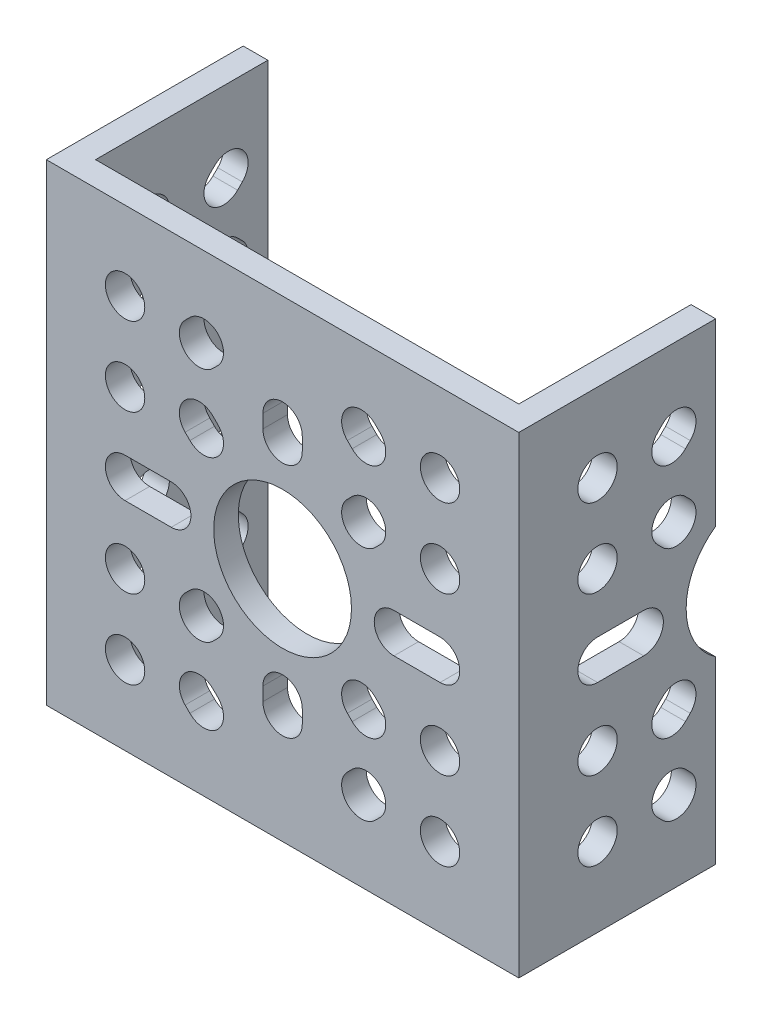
ISO-10303-21;
HEADER;
FILE_DESCRIPTION(('STEP AP214'),'2;1');
FILE_NAME('part.step','',(''),(''),'','','');
FILE_SCHEMA(('AUTOMOTIVE_DESIGN { 1 0 10303 214 1 1 1 1 }'));
ENDSEC;
DATA;
#1=APPLICATION_CONTEXT('core data for automotive mechanical design processes');
#2=APPLICATION_PROTOCOL_DEFINITION('international standard','automotive_design',2000,#1);
#3=PRODUCT_CONTEXT('',#1,'mechanical');
#4=PRODUCT('Part','Part','',(#3));
#5=PRODUCT_RELATED_PRODUCT_CATEGORY('part','',(#4));
#6=PRODUCT_DEFINITION_FORMATION('','',#4);
#7=PRODUCT_DEFINITION_CONTEXT('part definition',#1,'design');
#8=PRODUCT_DEFINITION('design','',#6,#7);
#9=PRODUCT_DEFINITION_SHAPE('','',#8);
#10=(LENGTH_UNIT() NAMED_UNIT(*) SI_UNIT(.MILLI.,.METRE.));
#11=(NAMED_UNIT(*) PLANE_ANGLE_UNIT() SI_UNIT($,.RADIAN.));
#12=(NAMED_UNIT(*) SI_UNIT($,.STERADIAN.) SOLID_ANGLE_UNIT());
#13=UNCERTAINTY_MEASURE_WITH_UNIT(LENGTH_MEASURE(1.E-05),#10,'distance_accuracy_value','');
#14=(GEOMETRIC_REPRESENTATION_CONTEXT(3) GLOBAL_UNCERTAINTY_ASSIGNED_CONTEXT((#13)) GLOBAL_UNIT_ASSIGNED_CONTEXT((#10,
#11,#12)) REPRESENTATION_CONTEXT('',''));
#15=CARTESIAN_POINT('',(0.,0.,0.));
#16=DIRECTION('',(0.,0.,1.));
#17=DIRECTION('',(1.,0.,0.));
#18=AXIS2_PLACEMENT_3D('',#15,#16,#17);
#19=CARTESIAN_POINT('',(-14.,2.66421356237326,2.66421356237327));
#20=DIRECTION('',(0.,0.707106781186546,0.707106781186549));
#21=DIRECTION('',(0.,-0.707106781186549,0.707106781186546));
#22=AXIS2_PLACEMENT_3D('',#19,#20,#21);
#23=PLANE('',#22);
#24=DIRECTION('',(0.,-0.707106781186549,0.707106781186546));
#25=VECTOR('',#24,1.);
#26=CARTESIAN_POINT('',(-24.,2.66421356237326,2.66421356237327));
#27=LINE('',#26,#25);
#28=CARTESIAN_POINT('',(-24.,17.4142135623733,-12.0857864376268));
#29=VERTEX_POINT('',#28);
#30=CARTESIAN_POINT('',(-24.,16.9289321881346,-11.6005050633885));
#31=VERTEX_POINT('',#30);
#32=EDGE_CURVE('E1145',#29,#31,#27,.T.);
#33=ORIENTED_EDGE('',*,*,#32,.F.);
#34=DIRECTION('',(-1.,0.,0.));
#35=VECTOR('',#34,1.);
#36=CARTESIAN_POINT('',(-14.,17.4142135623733,-12.0857864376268));
#37=LINE('',#36,#35);
#38=CARTESIAN_POINT('',(-21.5,17.4142135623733,-12.0857864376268));
#39=VERTEX_POINT('',#38);
#40=EDGE_CURVE('E1008',#29,#39,#37,.F.);
#41=ORIENTED_EDGE('',*,*,#40,.T.);
#42=DIRECTION('',(0.,-0.707106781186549,0.707106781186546));
#43=VECTOR('',#42,1.);
#44=CARTESIAN_POINT('',(-21.5,2.66421356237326,2.66421356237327));
#45=LINE('',#44,#43);
#46=CARTESIAN_POINT('',(-21.5,16.9289321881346,-11.6005050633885));
#47=VERTEX_POINT('',#46);
#48=EDGE_CURVE('E1148',#47,#39,#45,.F.);
#49=ORIENTED_EDGE('',*,*,#48,.F.);
#50=DIRECTION('',(-1.,0.,0.));
#51=VECTOR('',#50,1.);
#52=CARTESIAN_POINT('',(-14.,16.9289321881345,-11.6005050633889));
#53=LINE('',#52,#51);
#54=EDGE_CURVE('E1138',#47,#31,#53,.T.);
#55=ORIENTED_EDGE('',*,*,#54,.T.);
#56=EDGE_LOOP('',(#33,#41,#49,#55));
#57=FACE_BOUND('',#56,.T.);
#58=ADVANCED_FACE('F42',(#57),#23,.F.);
#59=CARTESIAN_POINT('',(-14.,-0.164213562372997,-0.164213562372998));
#60=DIRECTION('',(0.,0.70710678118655,0.707106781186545));
#61=DIRECTION('',(0.,-0.707106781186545,0.70710678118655));
#62=AXIS2_PLACEMENT_3D('',#59,#60,#61);
#63=PLANE('',#62);
#64=DIRECTION('',(0.,-0.707106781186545,0.70710678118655));
#65=VECTOR('',#64,1.);
#66=CARTESIAN_POINT('',(-24.,-0.164213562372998,-0.164213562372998));
#67=LINE('',#66,#65);
#68=CARTESIAN_POINT('',(-24.,14.585786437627,-14.9142135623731));
#69=VERTEX_POINT('',#68);
#70=CARTESIAN_POINT('',(-24.,14.1005050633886,-14.4289321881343));
#71=VERTEX_POINT('',#70);
#72=EDGE_CURVE('E1141',#69,#71,#67,.T.);
#73=ORIENTED_EDGE('',*,*,#72,.T.);
#74=DIRECTION('',(-1.,0.,0.));
#75=VECTOR('',#74,1.);
#76=CARTESIAN_POINT('',(-14.,14.1005050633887,-14.4289321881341));
#77=LINE('',#76,#75);
#78=CARTESIAN_POINT('',(-21.5,14.1005050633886,-14.4289321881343));
#79=VERTEX_POINT('',#78);
#80=EDGE_CURVE('E1005',#71,#79,#77,.F.);
#81=ORIENTED_EDGE('',*,*,#80,.T.);
#82=DIRECTION('',(0.,-0.707106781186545,0.70710678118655));
#83=VECTOR('',#82,1.);
#84=CARTESIAN_POINT('',(-21.5,-0.164213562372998,-0.164213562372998));
#85=LINE('',#84,#83);
#86=CARTESIAN_POINT('',(-21.5,14.585786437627,-14.9142135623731));
#87=VERTEX_POINT('',#86);
#88=EDGE_CURVE('E1143',#79,#87,#85,.F.);
#89=ORIENTED_EDGE('',*,*,#88,.T.);
#90=DIRECTION('',(-1.,0.,0.));
#91=VECTOR('',#90,1.);
#92=CARTESIAN_POINT('',(-14.,14.585786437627,-14.9142135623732));
#93=LINE('',#92,#91);
#94=EDGE_CURVE('E1011',#87,#69,#93,.T.);
#95=ORIENTED_EDGE('',*,*,#94,.T.);
#96=EDGE_LOOP('',(#73,#81,#89,#95));
#97=FACE_BOUND('',#96,.T.);
#98=ADVANCED_FACE('F1522',(#97),#63,.T.);
#99=CARTESIAN_POINT('',(-14.,9.3357864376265,-9.33578643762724));
#100=DIRECTION('',(0.,0.70710678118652,-0.707106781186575));
#101=DIRECTION('',(0.,0.707106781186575,0.70710678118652));
#102=AXIS2_PLACEMENT_3D('',#99,#100,#101);
#103=PLANE('',#102);
#104=DIRECTION('',(0.,0.707106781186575,0.70710678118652));
#105=VECTOR('',#104,1.);
#106=CARTESIAN_POINT('',(-24.,9.3357864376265,-9.33578643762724));
#107=LINE('',#106,#105);
#108=CARTESIAN_POINT('',(-24.,6.58578643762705,-12.0857864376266));
#109=VERTEX_POINT('',#108);
#110=CARTESIAN_POINT('',(-24.,7.0710678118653,-11.6005050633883));
#111=VERTEX_POINT('',#110);
#112=EDGE_CURVE('E1134',#109,#111,#107,.T.);
#113=ORIENTED_EDGE('',*,*,#112,.T.);
#114=DIRECTION('',(-1.,0.,0.));
#115=VECTOR('',#114,1.);
#116=CARTESIAN_POINT('',(-14.,7.07106781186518,-11.6005050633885));
#117=LINE('',#116,#115);
#118=CARTESIAN_POINT('',(-21.5,7.0710678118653,-11.6005050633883));
#119=VERTEX_POINT('',#118);
#120=EDGE_CURVE('E1130',#111,#119,#117,.F.);
#121=ORIENTED_EDGE('',*,*,#120,.T.);
#122=DIRECTION('',(0.,0.707106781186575,0.70710678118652));
#123=VECTOR('',#122,1.);
#124=CARTESIAN_POINT('',(-21.5,9.3357864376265,-9.33578643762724));
#125=LINE('',#124,#123);
#126=CARTESIAN_POINT('',(-21.5,6.58578643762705,-12.0857864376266));
#127=VERTEX_POINT('',#126);
#128=EDGE_CURVE('E1136',#119,#127,#125,.F.);
#129=ORIENTED_EDGE('',*,*,#128,.T.);
#130=DIRECTION('',(-1.,0.,0.));
#131=VECTOR('',#130,1.);
#132=CARTESIAN_POINT('',(-14.,6.58578643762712,-12.0857864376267));
#133=LINE('',#132,#131);
#134=EDGE_CURVE('E1002',#127,#109,#133,.T.);
#135=ORIENTED_EDGE('',*,*,#134,.T.);
#136=EDGE_LOOP('',(#113,#121,#129,#135));
#137=FACE_BOUND('',#136,.T.);
#138=ADVANCED_FACE('F2487',(#137),#103,.T.);
#139=CARTESIAN_POINT('',(-14.,12.164213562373,-12.164213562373));
#140=DIRECTION('',(0.,0.707106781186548,-0.707106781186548));
#141=DIRECTION('',(0.,0.707106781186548,0.707106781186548));
#142=AXIS2_PLACEMENT_3D('',#139,#140,#141);
#143=PLANE('',#142);
#144=DIRECTION('',(0.,0.707106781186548,0.707106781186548));
#145=VECTOR('',#144,1.);
#146=CARTESIAN_POINT('',(-24.,12.164213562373,-12.164213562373));
#147=LINE('',#146,#145);
#148=CARTESIAN_POINT('',(-24.,9.41421356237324,-14.9142135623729));
#149=VERTEX_POINT('',#148);
#150=CARTESIAN_POINT('',(-24.,9.89949493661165,-14.4289321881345));
#151=VERTEX_POINT('',#150);
#152=EDGE_CURVE('E1133',#149,#151,#147,.T.);
#153=ORIENTED_EDGE('',*,*,#152,.F.);
#154=DIRECTION('',(-1.,0.,0.));
#155=VECTOR('',#154,1.);
#156=CARTESIAN_POINT('',(-14.,9.41421356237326,-14.9142135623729));
#157=LINE('',#156,#155);
#158=CARTESIAN_POINT('',(-21.5,9.41421356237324,-14.9142135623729));
#159=VERTEX_POINT('',#158);
#160=EDGE_CURVE('E999',#149,#159,#157,.F.);
#161=ORIENTED_EDGE('',*,*,#160,.T.);
#162=DIRECTION('',(0.,0.707106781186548,0.707106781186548));
#163=VECTOR('',#162,1.);
#164=CARTESIAN_POINT('',(-21.5,12.164213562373,-12.164213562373));
#165=LINE('',#164,#163);
#166=CARTESIAN_POINT('',(-21.5,9.89949493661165,-14.4289321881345));
#167=VERTEX_POINT('',#166);
#168=EDGE_CURVE('E1131',#167,#159,#165,.F.);
#169=ORIENTED_EDGE('',*,*,#168,.F.);
#170=DIRECTION('',(-1.,0.,0.));
#171=VECTOR('',#170,1.);
#172=CARTESIAN_POINT('',(-14.,9.89949493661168,-14.4289321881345));
#173=LINE('',#172,#171);
#174=EDGE_CURVE('E996',#167,#151,#173,.T.);
#175=ORIENTED_EDGE('',*,*,#174,.T.);
#176=EDGE_LOOP('',(#153,#161,#169,#175));
#177=FACE_BOUND('',#176,.T.);
#178=ADVANCED_FACE('F2483',(#177),#143,.F.);
#179=CARTESIAN_POINT('',(-14.,14.6642135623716,14.6642135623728));
#180=DIRECTION('',(0.,0.70710678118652,0.707106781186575));
#181=DIRECTION('',(0.,-0.707106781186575,0.70710678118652));
#182=AXIS2_PLACEMENT_3D('',#179,#180,#181);
#183=PLANE('',#182);
#184=DIRECTION('',(0.,-0.707106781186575,0.70710678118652));
#185=VECTOR('',#184,1.);
#186=CARTESIAN_POINT('',(-24.,14.6642135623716,14.6642135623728));
#187=LINE('',#186,#185);
#188=CARTESIAN_POINT('',(-24.,41.414213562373,-12.0857864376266));
#189=VERTEX_POINT('',#188);
#190=CARTESIAN_POINT('',(-24.,40.9289321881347,-11.6005050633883));
#191=VERTEX_POINT('',#190);
#192=EDGE_CURVE('E1125',#189,#191,#187,.T.);
#193=ORIENTED_EDGE('',*,*,#192,.F.);
#194=DIRECTION('',(-1.,0.,0.));
#195=VECTOR('',#194,1.);
#196=CARTESIAN_POINT('',(-14.,41.4142135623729,-12.0857864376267));
#197=LINE('',#196,#195);
#198=CARTESIAN_POINT('',(-21.5,41.414213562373,-12.0857864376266));
#199=VERTEX_POINT('',#198);
#200=EDGE_CURVE('E981',#189,#199,#197,.F.);
#201=ORIENTED_EDGE('',*,*,#200,.T.);
#202=DIRECTION('',(0.,-0.707106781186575,0.70710678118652));
#203=VECTOR('',#202,1.);
#204=CARTESIAN_POINT('',(-21.5,14.6642135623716,14.6642135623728));
#205=LINE('',#204,#203);
#206=CARTESIAN_POINT('',(-21.5,40.9289321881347,-11.6005050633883));
#207=VERTEX_POINT('',#206);
#208=EDGE_CURVE('E1128',#207,#199,#205,.F.);
#209=ORIENTED_EDGE('',*,*,#208,.F.);
#210=DIRECTION('',(-1.,0.,0.));
#211=VECTOR('',#210,1.);
#212=CARTESIAN_POINT('',(-14.,40.9289321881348,-11.6005050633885));
#213=LINE('',#212,#211);
#214=EDGE_CURVE('E1118',#207,#191,#213,.T.);
#215=ORIENTED_EDGE('',*,*,#214,.T.);
#216=EDGE_LOOP('',(#193,#201,#209,#215));
#217=FACE_BOUND('',#216,.T.);
#218=ADVANCED_FACE('F2479',(#217),#183,.F.);
#219=CARTESIAN_POINT('',(-14.,11.835786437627,11.835786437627));
#220=DIRECTION('',(0.,0.707106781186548,0.707106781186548));
#221=DIRECTION('',(0.,-0.707106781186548,0.707106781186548));
#222=AXIS2_PLACEMENT_3D('',#219,#220,#221);
#223=PLANE('',#222);
#224=DIRECTION('',(0.,-0.707106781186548,0.707106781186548));
#225=VECTOR('',#224,1.);
#226=CARTESIAN_POINT('',(-24.,11.835786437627,11.835786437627));
#227=LINE('',#226,#225);
#228=CARTESIAN_POINT('',(-24.,38.5857864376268,-14.9142135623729));
#229=VERTEX_POINT('',#228);
#230=CARTESIAN_POINT('',(-24.,38.1005050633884,-14.4289321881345));
#231=VERTEX_POINT('',#230);
#232=EDGE_CURVE('E1121',#229,#231,#227,.T.);
#233=ORIENTED_EDGE('',*,*,#232,.T.);
#234=DIRECTION('',(-1.,0.,0.));
#235=VECTOR('',#234,1.);
#236=CARTESIAN_POINT('',(-14.,38.1005050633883,-14.4289321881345));
#237=LINE('',#236,#235);
#238=CARTESIAN_POINT('',(-21.5,38.1005050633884,-14.4289321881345));
#239=VERTEX_POINT('',#238);
#240=EDGE_CURVE('E978',#231,#239,#237,.F.);
#241=ORIENTED_EDGE('',*,*,#240,.T.);
#242=DIRECTION('',(0.,-0.707106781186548,0.707106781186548));
#243=VECTOR('',#242,1.);
#244=CARTESIAN_POINT('',(-21.5,11.835786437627,11.835786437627));
#245=LINE('',#244,#243);
#246=CARTESIAN_POINT('',(-21.5,38.5857864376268,-14.9142135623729));
#247=VERTEX_POINT('',#246);
#248=EDGE_CURVE('E1123',#239,#247,#245,.F.);
#249=ORIENTED_EDGE('',*,*,#248,.T.);
#250=DIRECTION('',(-1.,0.,0.));
#251=VECTOR('',#250,1.);
#252=CARTESIAN_POINT('',(-14.,38.5857864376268,-14.9142135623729));
#253=LINE('',#252,#251);
#254=EDGE_CURVE('E984',#247,#229,#253,.T.);
#255=ORIENTED_EDGE('',*,*,#254,.T.);
#256=EDGE_LOOP('',(#233,#241,#249,#255));
#257=FACE_BOUND('',#256,.T.);
#258=ADVANCED_FACE('F2475',(#257),#223,.T.);
#259=CARTESIAN_POINT('',(-14.,21.3357864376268,-21.335786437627));
#260=DIRECTION('',(0.,0.707106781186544,-0.707106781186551));
#261=DIRECTION('',(0.,0.707106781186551,0.707106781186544));
#262=AXIS2_PLACEMENT_3D('',#259,#260,#261);
#263=PLANE('',#262);
#264=DIRECTION('',(0.,0.707106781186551,0.707106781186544));
#265=VECTOR('',#264,1.);
#266=CARTESIAN_POINT('',(-24.,21.3357864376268,-21.335786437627));
#267=LINE('',#266,#265);
#268=CARTESIAN_POINT('',(-24.,30.5857864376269,-12.085786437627));
#269=VERTEX_POINT('',#268);
#270=CARTESIAN_POINT('',(-24.,31.0710678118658,-11.6005050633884));
#271=VERTEX_POINT('',#270);
#272=EDGE_CURVE('E1114',#269,#271,#267,.T.);
#273=ORIENTED_EDGE('',*,*,#272,.T.);
#274=DIRECTION('',(-1.,0.,0.));
#275=VECTOR('',#274,1.);
#276=CARTESIAN_POINT('',(-14.,31.0710678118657,-11.6005050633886));
#277=LINE('',#276,#275);
#278=CARTESIAN_POINT('',(-21.5,31.0710678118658,-11.6005050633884));
#279=VERTEX_POINT('',#278);
#280=EDGE_CURVE('E1109',#271,#279,#277,.F.);
#281=ORIENTED_EDGE('',*,*,#280,.T.);
#282=DIRECTION('',(0.,0.707106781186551,0.707106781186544));
#283=VECTOR('',#282,1.);
#284=CARTESIAN_POINT('',(-21.5,21.3357864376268,-21.335786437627));
#285=LINE('',#284,#283);
#286=CARTESIAN_POINT('',(-21.5,30.5857864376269,-12.085786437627));
#287=VERTEX_POINT('',#286);
#288=EDGE_CURVE('E1116',#279,#287,#285,.F.);
#289=ORIENTED_EDGE('',*,*,#288,.T.);
#290=DIRECTION('',(-1.,0.,0.));
#291=VECTOR('',#290,1.);
#292=CARTESIAN_POINT('',(-14.,30.5857864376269,-12.085786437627));
#293=LINE('',#292,#291);
#294=EDGE_CURVE('E975',#287,#269,#293,.T.);
#295=ORIENTED_EDGE('',*,*,#294,.T.);
#296=EDGE_LOOP('',(#273,#281,#289,#295));
#297=FACE_BOUND('',#296,.T.);
#298=ADVANCED_FACE('F2471',(#297),#263,.T.);
#299=CARTESIAN_POINT('',(-14.,24.1642135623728,-24.1642135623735));
#300=DIRECTION('',(0.,0.707106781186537,-0.707106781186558));
#301=DIRECTION('',(0.,0.707106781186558,0.707106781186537));
#302=AXIS2_PLACEMENT_3D('',#299,#300,#301);
#303=PLANE('',#302);
#304=DIRECTION('',(0.,0.707106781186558,0.707106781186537));
#305=VECTOR('',#304,1.);
#306=CARTESIAN_POINT('',(-24.,24.1642135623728,-24.1642135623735));
#307=LINE('',#306,#305);
#308=CARTESIAN_POINT('',(-24.,33.4142135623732,-14.9142135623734));
#309=VERTEX_POINT('',#308);
#310=CARTESIAN_POINT('',(-24.,33.8994949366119,-14.4289321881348));
#311=VERTEX_POINT('',#310);
#312=EDGE_CURVE('E1113',#309,#311,#307,.T.);
#313=ORIENTED_EDGE('',*,*,#312,.F.);
#314=DIRECTION('',(-1.,0.,0.));
#315=VECTOR('',#314,1.);
#316=CARTESIAN_POINT('',(-14.,33.4142135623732,-14.9142135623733));
#317=LINE('',#316,#315);
#318=CARTESIAN_POINT('',(-21.5,33.4142135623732,-14.9142135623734));
#319=VERTEX_POINT('',#318);
#320=EDGE_CURVE('E972',#309,#319,#317,.F.);
#321=ORIENTED_EDGE('',*,*,#320,.T.);
#322=DIRECTION('',(0.,0.707106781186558,0.707106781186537));
#323=VECTOR('',#322,1.);
#324=CARTESIAN_POINT('',(-21.5,24.1642135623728,-24.1642135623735));
#325=LINE('',#324,#323);
#326=CARTESIAN_POINT('',(-21.5,33.8994949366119,-14.4289321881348));
#327=VERTEX_POINT('',#326);
#328=EDGE_CURVE('E1111',#327,#319,#325,.F.);
#329=ORIENTED_EDGE('',*,*,#328,.F.);
#330=DIRECTION('',(-1.,0.,0.));
#331=VECTOR('',#330,1.);
#332=CARTESIAN_POINT('',(-14.,33.8994949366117,-14.428932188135));
#333=LINE('',#332,#331);
#334=EDGE_CURVE('E961',#327,#311,#333,.T.);
#335=ORIENTED_EDGE('',*,*,#334,.T.);
#336=EDGE_LOOP('',(#313,#321,#329,#335));
#337=FACE_BOUND('',#336,.T.);
#338=ADVANCED_FACE('F2465',(#337),#303,.F.);
#339=CARTESIAN_POINT('',(-1.99999999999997,36.,-0.499999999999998));
#340=DIRECTION('',(1.,0.,0.));
#341=DIRECTION('',(0.,0.,-1.));
#342=AXIS2_PLACEMENT_3D('',#339,#340,#341);
#343=PLANE('',#342);
#344=DIRECTION('',(0.,1.,0.));
#345=VECTOR('',#344,1.);
#346=CARTESIAN_POINT('',(-1.99999999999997,36.,2.5));
#347=LINE('',#346,#345);
#348=CARTESIAN_POINT('',(-1.99999999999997,36.6862915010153,2.5));
#349=VERTEX_POINT('',#348);
#350=CARTESIAN_POINT('',(-1.99999999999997,35.3137084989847,2.5));
#351=VERTEX_POINT('',#350);
#352=EDGE_CURVE('E1106',#349,#351,#347,.F.);
#353=ORIENTED_EDGE('',*,*,#352,.T.);
#354=DIRECTION('',(0.,0.,1.));
#355=VECTOR('',#354,1.);
#356=CARTESIAN_POINT('',(-1.99999999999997,35.3137084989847,-0.499999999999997));
#357=LINE('',#356,#355);
#358=CARTESIAN_POINT('',(-1.99999999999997,35.3137084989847,0.));
#359=VERTEX_POINT('',#358);
#360=EDGE_CURVE('E943',#351,#359,#357,.F.);
#361=ORIENTED_EDGE('',*,*,#360,.T.);
#362=DIRECTION('',(0.,1.,0.));
#363=VECTOR('',#362,1.);
#364=CARTESIAN_POINT('',(-1.99999999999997,36.,0.));
#365=LINE('',#364,#363);
#366=CARTESIAN_POINT('',(-1.99999999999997,36.6862915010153,0.));
#367=VERTEX_POINT('',#366);
#368=EDGE_CURVE('E1107',#359,#367,#365,.T.);
#369=ORIENTED_EDGE('',*,*,#368,.T.);
#370=DIRECTION('',(0.,0.,1.));
#371=VECTOR('',#370,1.);
#372=CARTESIAN_POINT('',(-1.99999999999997,36.6862915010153,-0.499999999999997));
#373=LINE('',#372,#371);
#374=EDGE_CURVE('E940',#367,#349,#373,.T.);
#375=ORIENTED_EDGE('',*,*,#374,.T.);
#376=EDGE_LOOP('',(#353,#361,#369,#375));
#377=FACE_BOUND('',#376,.T.);
#378=ADVANCED_FACE('F2447',(#377),#343,.T.);
#379=CARTESIAN_POINT('',(1.99999999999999,36.,-0.500000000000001));
#380=DIRECTION('',(-1.,0.,0.));
#381=DIRECTION('',(0.,-1.,0.));
#382=AXIS2_PLACEMENT_3D('',#379,#380,#381);
#383=PLANE('',#382);
#384=DIRECTION('',(0.,-1.,0.));
#385=VECTOR('',#384,1.);
#386=CARTESIAN_POINT('',(1.99999999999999,36.,2.5));
#387=LINE('',#386,#385);
#388=CARTESIAN_POINT('',(2.00000000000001,35.3137084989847,2.5));
#389=VERTEX_POINT('',#388);
#390=CARTESIAN_POINT('',(1.99999999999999,36.6862915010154,2.5));
#391=VERTEX_POINT('',#390);
#392=EDGE_CURVE('E1100',#389,#391,#387,.F.);
#393=ORIENTED_EDGE('',*,*,#392,.T.);
#394=DIRECTION('',(0.,0.,1.));
#395=VECTOR('',#394,1.);
#396=CARTESIAN_POINT('',(2.,36.6862915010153,-0.499999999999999));
#397=LINE('',#396,#395);
#398=CARTESIAN_POINT('',(1.99999999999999,36.6862915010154,0.));
#399=VERTEX_POINT('',#398);
#400=EDGE_CURVE('E939',#391,#399,#397,.F.);
#401=ORIENTED_EDGE('',*,*,#400,.T.);
#402=DIRECTION('',(0.,-1.,0.));
#403=VECTOR('',#402,1.);
#404=CARTESIAN_POINT('',(1.99999999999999,36.,0.));
#405=LINE('',#404,#403);
#406=CARTESIAN_POINT('',(2.,35.3137084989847,0.));
#407=VERTEX_POINT('',#406);
#408=EDGE_CURVE('E1104',#399,#407,#405,.T.);
#409=ORIENTED_EDGE('',*,*,#408,.T.);
#410=DIRECTION('',(0.,0.,1.));
#411=VECTOR('',#410,1.);
#412=CARTESIAN_POINT('',(2.,35.3137084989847,-0.499999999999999));
#413=LINE('',#412,#411);
#414=EDGE_CURVE('E946',#407,#389,#413,.T.);
#415=ORIENTED_EDGE('',*,*,#414,.T.);
#416=EDGE_LOOP('',(#393,#401,#409,#415));
#417=FACE_BOUND('',#416,.T.);
#418=ADVANCED_FACE('F2451',(#417),#383,.T.);
#419=CARTESIAN_POINT('',(-21.3357864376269,-0.164213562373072,-7.49999999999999));
#420=DIRECTION('',(-0.707106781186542,0.707106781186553,0.));
#421=DIRECTION('',(-0.707106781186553,-0.707106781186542,0.));
#422=AXIS2_PLACEMENT_3D('',#419,#420,#421);
#423=PLANE('',#422);
#424=DIRECTION('',(-0.707106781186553,-0.707106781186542,0.));
#425=VECTOR('',#424,1.);
#426=CARTESIAN_POINT('',(-21.3357864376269,-0.164213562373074,2.5));
#427=LINE('',#426,#425);
#428=CARTESIAN_POINT('',(9.41421356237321,30.5857864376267,2.5));
#429=VERTEX_POINT('',#428);
#430=CARTESIAN_POINT('',(9.89949493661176,31.0710678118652,2.5));
#431=VERTEX_POINT('',#430);
#432=EDGE_CURVE('E1099',#429,#431,#427,.F.);
#433=ORIENTED_EDGE('',*,*,#432,.T.);
#434=DIRECTION('',(0.,0.,1.));
#435=VECTOR('',#434,1.);
#436=CARTESIAN_POINT('',(9.89949493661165,31.0710678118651,-7.49999999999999));
#437=LINE('',#436,#435);
#438=CARTESIAN_POINT('',(9.89949493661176,31.0710678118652,0.));
#439=VERTEX_POINT('',#438);
#440=EDGE_CURVE('E1096',#431,#439,#437,.F.);
#441=ORIENTED_EDGE('',*,*,#440,.T.);
#442=DIRECTION('',(-0.707106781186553,-0.707106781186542,0.));
#443=VECTOR('',#442,1.);
#444=CARTESIAN_POINT('',(-21.3357864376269,-0.164213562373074,0.));
#445=LINE('',#444,#443);
#446=CARTESIAN_POINT('',(9.41421356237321,30.5857864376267,0.));
#447=VERTEX_POINT('',#446);
#448=EDGE_CURVE('E1097',#439,#447,#445,.T.);
#449=ORIENTED_EDGE('',*,*,#448,.T.);
#450=DIRECTION('',(0.,0.,1.));
#451=VECTOR('',#450,1.);
#452=CARTESIAN_POINT('',(9.41421356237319,30.5857864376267,-7.5));
#453=LINE('',#452,#451);
#454=EDGE_CURVE('E931',#447,#429,#453,.T.);
#455=ORIENTED_EDGE('',*,*,#454,.T.);
#456=EDGE_LOOP('',(#433,#441,#449,#455));
#457=FACE_BOUND('',#456,.T.);
#458=ADVANCED_FACE('F2456',(#457),#423,.T.);
#459=CARTESIAN_POINT('',(-24.1642135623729,2.66421356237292,-7.49999999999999));
#460=DIRECTION('',(-0.70710678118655,0.707106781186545,0.));
#461=DIRECTION('',(-0.707106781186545,-0.70710678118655,0.));
#462=AXIS2_PLACEMENT_3D('',#459,#460,#461);
#463=PLANE('',#462);
#464=DIRECTION('',(-0.707106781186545,-0.70710678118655,0.));
#465=VECTOR('',#464,1.);
#466=CARTESIAN_POINT('',(-24.1642135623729,2.66421356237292,2.5));
#467=LINE('',#466,#465);
#468=CARTESIAN_POINT('',(6.58578643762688,33.414213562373,2.5));
#469=VERTEX_POINT('',#468);
#470=CARTESIAN_POINT('',(7.07106781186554,33.8994949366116,2.5));
#471=VERTEX_POINT('',#470);
#472=EDGE_CURVE('E1090',#469,#471,#467,.F.);
#473=ORIENTED_EDGE('',*,*,#472,.F.);
#474=DIRECTION('',(0.,0.,1.));
#475=VECTOR('',#474,1.);
#476=CARTESIAN_POINT('',(6.58578643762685,33.414213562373,-7.5));
#477=LINE('',#476,#475);
#478=CARTESIAN_POINT('',(6.58578643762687,33.414213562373,0.));
#479=VERTEX_POINT('',#478);
#480=EDGE_CURVE('E930',#469,#479,#477,.F.);
#481=ORIENTED_EDGE('',*,*,#480,.T.);
#482=DIRECTION('',(-0.707106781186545,-0.70710678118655,0.));
#483=VECTOR('',#482,1.);
#484=CARTESIAN_POINT('',(-24.1642135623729,2.66421356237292,0.));
#485=LINE('',#484,#483);
#486=CARTESIAN_POINT('',(7.07106781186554,33.8994949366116,0.));
#487=VERTEX_POINT('',#486);
#488=EDGE_CURVE('E1094',#487,#479,#485,.T.);
#489=ORIENTED_EDGE('',*,*,#488,.F.);
#490=DIRECTION('',(0.,0.,1.));
#491=VECTOR('',#490,1.);
#492=CARTESIAN_POINT('',(7.07106781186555,33.8994949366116,-7.5));
#493=LINE('',#492,#491);
#494=EDGE_CURVE('E934',#487,#471,#493,.T.);
#495=ORIENTED_EDGE('',*,*,#494,.T.);
#496=EDGE_LOOP('',(#473,#481,#489,#495));
#497=FACE_BOUND('',#496,.T.);
#498=ADVANCED_FACE('F2462',(#497),#463,.F.);
#499=CARTESIAN_POINT('',(-9.33578643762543,-12.1642135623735,-7.49999999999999));
#500=DIRECTION('',(-0.707106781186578,0.707106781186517,0.));
#501=DIRECTION('',(-0.707106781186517,-0.707106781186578,0.));
#502=AXIS2_PLACEMENT_3D('',#499,#500,#501);
#503=PLANE('',#502);
#504=DIRECTION('',(-0.707106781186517,-0.707106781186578,0.));
#505=VECTOR('',#504,1.);
#506=CARTESIAN_POINT('',(-9.33578643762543,-12.1642135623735,2.5));
#507=LINE('',#506,#505);
#508=CARTESIAN_POINT('',(9.41421356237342,6.58578643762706,2.5));
#509=VERTEX_POINT('',#508);
#510=CARTESIAN_POINT('',(9.89949493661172,7.07106781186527,2.5));
#511=VERTEX_POINT('',#510);
#512=EDGE_CURVE('E1089',#509,#511,#507,.F.);
#513=ORIENTED_EDGE('',*,*,#512,.T.);
#514=DIRECTION('',(0.,0.,1.));
#515=VECTOR('',#514,1.);
#516=CARTESIAN_POINT('',(9.89949493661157,7.07106781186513,-7.49999999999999));
#517=LINE('',#516,#515);
#518=CARTESIAN_POINT('',(9.89949493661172,7.07106781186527,0.));
#519=VERTEX_POINT('',#518);
#520=EDGE_CURVE('E1086',#511,#519,#517,.F.);
#521=ORIENTED_EDGE('',*,*,#520,.T.);
#522=DIRECTION('',(-0.707106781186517,-0.707106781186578,0.));
#523=VECTOR('',#522,1.);
#524=CARTESIAN_POINT('',(-9.33578643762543,-12.1642135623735,0.));
#525=LINE('',#524,#523);
#526=CARTESIAN_POINT('',(9.41421356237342,6.58578643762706,0.));
#527=VERTEX_POINT('',#526);
#528=EDGE_CURVE('E1087',#519,#527,#525,.T.);
#529=ORIENTED_EDGE('',*,*,#528,.T.);
#530=DIRECTION('',(0.,0.,1.));
#531=VECTOR('',#530,1.);
#532=CARTESIAN_POINT('',(9.41421356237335,6.58578643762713,-7.5));
#533=LINE('',#532,#531);
#534=EDGE_CURVE('E922',#527,#509,#533,.T.);
#535=ORIENTED_EDGE('',*,*,#534,.T.);
#536=EDGE_LOOP('',(#513,#521,#529,#535));
#537=FACE_BOUND('',#536,.T.);
#538=ADVANCED_FACE('F2563',(#537),#503,.T.);
#539=CARTESIAN_POINT('',(-12.164213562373,-9.33578643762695,-7.49999999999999));
#540=DIRECTION('',(-0.707106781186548,0.707106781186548,0.));
#541=DIRECTION('',(-0.707106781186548,-0.707106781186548,0.));
#542=AXIS2_PLACEMENT_3D('',#539,#540,#541);
#543=PLANE('',#542);
#544=DIRECTION('',(-0.707106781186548,-0.707106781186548,0.));
#545=VECTOR('',#544,1.);
#546=CARTESIAN_POINT('',(-12.164213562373,-9.33578643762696,2.5));
#547=LINE('',#546,#545);
#548=CARTESIAN_POINT('',(6.58578643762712,9.41421356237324,2.5));
#549=VERTEX_POINT('',#548);
#550=CARTESIAN_POINT('',(7.07106781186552,9.89949493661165,2.5));
#551=VERTEX_POINT('',#550);
#552=EDGE_CURVE('E1081',#549,#551,#547,.F.);
#553=ORIENTED_EDGE('',*,*,#552,.F.);
#554=DIRECTION('',(0.,0.,1.));
#555=VECTOR('',#554,1.);
#556=CARTESIAN_POINT('',(6.58578643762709,9.41421356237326,-7.5));
#557=LINE('',#556,#555);
#558=CARTESIAN_POINT('',(6.58578643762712,9.41421356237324,0.));
#559=VERTEX_POINT('',#558);
#560=EDGE_CURVE('E919',#549,#559,#557,.F.);
#561=ORIENTED_EDGE('',*,*,#560,.T.);
#562=DIRECTION('',(-0.707106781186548,-0.707106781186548,0.));
#563=VECTOR('',#562,1.);
#564=CARTESIAN_POINT('',(-12.164213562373,-9.33578643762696,0.));
#565=LINE('',#564,#563);
#566=CARTESIAN_POINT('',(7.07106781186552,9.89949493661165,0.));
#567=VERTEX_POINT('',#566);
#568=EDGE_CURVE('E1084',#567,#559,#565,.T.);
#569=ORIENTED_EDGE('',*,*,#568,.F.);
#570=DIRECTION('',(0.,0.,1.));
#571=VECTOR('',#570,1.);
#572=CARTESIAN_POINT('',(7.0710678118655,9.89949493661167,-7.5));
#573=LINE('',#572,#571);
#574=EDGE_CURVE('E925',#567,#551,#573,.T.);
#575=ORIENTED_EDGE('',*,*,#574,.T.);
#576=EDGE_LOOP('',(#553,#561,#569,#575));
#577=FACE_BOUND('',#576,.T.);
#578=ADVANCED_FACE('F2572',(#577),#543,.F.);
#579=CARTESIAN_POINT('',(-33.335786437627,11.835786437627,-7.49999999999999));
#580=DIRECTION('',(0.707106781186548,-0.707106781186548,0.));
#581=DIRECTION('',(0.707106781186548,0.707106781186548,0.));
#582=AXIS2_PLACEMENT_3D('',#579,#580,#581);
#583=PLANE('',#582);
#584=DIRECTION('',(0.707106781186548,0.707106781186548,0.));
#585=VECTOR('',#584,1.);
#586=CARTESIAN_POINT('',(-33.335786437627,11.835786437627,2.50000000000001));
#587=LINE('',#586,#585);
#588=CARTESIAN_POINT('',(-6.58578643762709,38.5857864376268,2.5));
#589=VERTEX_POINT('',#588);
#590=CARTESIAN_POINT('',(-7.07106781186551,38.1005050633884,2.5));
#591=VERTEX_POINT('',#590);
#592=EDGE_CURVE('E1076',#589,#591,#587,.F.);
#593=ORIENTED_EDGE('',*,*,#592,.F.);
#594=DIRECTION('',(0.,0.,1.));
#595=VECTOR('',#594,1.);
#596=CARTESIAN_POINT('',(-6.58578643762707,38.5857864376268,-7.5));
#597=LINE('',#596,#595);
#598=CARTESIAN_POINT('',(-6.58578643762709,38.5857864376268,0.));
#599=VERTEX_POINT('',#598);
#600=EDGE_CURVE('E1071',#589,#599,#597,.F.);
#601=ORIENTED_EDGE('',*,*,#600,.T.);
#602=DIRECTION('',(0.707106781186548,0.707106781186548,0.));
#603=VECTOR('',#602,1.);
#604=CARTESIAN_POINT('',(-33.335786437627,11.835786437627,0.));
#605=LINE('',#604,#603);
#606=CARTESIAN_POINT('',(-7.07106781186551,38.1005050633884,0.));
#607=VERTEX_POINT('',#606);
#608=EDGE_CURVE('E1078',#607,#599,#605,.T.);
#609=ORIENTED_EDGE('',*,*,#608,.F.);
#610=DIRECTION('',(0.,0.,1.));
#611=VECTOR('',#610,1.);
#612=CARTESIAN_POINT('',(-7.07106781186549,38.1005050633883,-7.5));
#613=LINE('',#612,#611);
#614=EDGE_CURVE('E916',#607,#591,#613,.T.);
#615=ORIENTED_EDGE('',*,*,#614,.T.);
#616=EDGE_LOOP('',(#593,#601,#609,#615));
#617=FACE_BOUND('',#616,.T.);
#618=ADVANCED_FACE('F2582',(#617),#583,.F.);
#619=CARTESIAN_POINT('',(-36.1642135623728,14.6642135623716,-7.49999999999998));
#620=DIRECTION('',(0.707106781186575,-0.70710678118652,0.));
#621=DIRECTION('',(0.70710678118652,0.707106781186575,0.));
#622=AXIS2_PLACEMENT_3D('',#619,#620,#621);
#623=PLANE('',#622);
#624=DIRECTION('',(0.70710678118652,0.707106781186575,0.));
#625=VECTOR('',#624,1.);
#626=CARTESIAN_POINT('',(-36.1642135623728,14.6642135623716,2.5));
#627=LINE('',#626,#625);
#628=CARTESIAN_POINT('',(-9.41421356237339,41.414213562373,2.5));
#629=VERTEX_POINT('',#628);
#630=CARTESIAN_POINT('',(-9.89949493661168,40.9289321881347,2.5));
#631=VERTEX_POINT('',#630);
#632=EDGE_CURVE('E1075',#629,#631,#627,.F.);
#633=ORIENTED_EDGE('',*,*,#632,.T.);
#634=DIRECTION('',(0.,0.,1.));
#635=VECTOR('',#634,1.);
#636=CARTESIAN_POINT('',(-9.89949493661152,40.9289321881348,-7.49999999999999));
#637=LINE('',#636,#635);
#638=CARTESIAN_POINT('',(-9.89949493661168,40.9289321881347,0.));
#639=VERTEX_POINT('',#638);
#640=EDGE_CURVE('E915',#631,#639,#637,.F.);
#641=ORIENTED_EDGE('',*,*,#640,.T.);
#642=DIRECTION('',(0.70710678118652,0.707106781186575,0.));
#643=VECTOR('',#642,1.);
#644=CARTESIAN_POINT('',(-36.1642135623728,14.6642135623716,0.));
#645=LINE('',#644,#643);
#646=CARTESIAN_POINT('',(-9.41421356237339,41.414213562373,0.));
#647=VERTEX_POINT('',#646);
#648=EDGE_CURVE('E1073',#639,#647,#645,.T.);
#649=ORIENTED_EDGE('',*,*,#648,.T.);
#650=DIRECTION('',(0.,0.,1.));
#651=VECTOR('',#650,1.);
#652=CARTESIAN_POINT('',(-9.41421356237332,41.4142135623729,-7.5));
#653=LINE('',#652,#651);
#654=EDGE_CURVE('E912',#647,#629,#653,.T.);
#655=ORIENTED_EDGE('',*,*,#654,.T.);
#656=EDGE_LOOP('',(#633,#641,#649,#655));
#657=FACE_BOUND('',#656,.T.);
#658=ADVANCED_FACE('F2592',(#657),#623,.T.);
#659=CARTESIAN_POINT('',(11.835786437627,33.335786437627,-7.5));
#660=DIRECTION('',(0.707106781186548,0.707106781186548,0.));
#661=DIRECTION('',(-0.707106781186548,0.707106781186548,0.));
#662=AXIS2_PLACEMENT_3D('',#659,#660,#661);
#663=PLANE('',#662);
#664=DIRECTION('',(-0.707106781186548,0.707106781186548,0.));
#665=VECTOR('',#664,1.);
#666=CARTESIAN_POINT('',(11.835786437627,33.335786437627,2.5));
#667=LINE('',#666,#665);
#668=CARTESIAN_POINT('',(6.58578643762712,38.5857864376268,2.5));
#669=VERTEX_POINT('',#668);
#670=CARTESIAN_POINT('',(7.07106781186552,38.1005050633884,2.5));
#671=VERTEX_POINT('',#670);
#672=EDGE_CURVE('E1068',#669,#671,#667,.F.);
#673=ORIENTED_EDGE('',*,*,#672,.T.);
#674=DIRECTION('',(0.,0.,1.));
#675=VECTOR('',#674,1.);
#676=CARTESIAN_POINT('',(7.0710678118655,38.1005050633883,-7.5));
#677=LINE('',#676,#675);
#678=CARTESIAN_POINT('',(7.07106781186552,38.1005050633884,0.));
#679=VERTEX_POINT('',#678);
#680=EDGE_CURVE('E907',#671,#679,#677,.F.);
#681=ORIENTED_EDGE('',*,*,#680,.T.);
#682=DIRECTION('',(-0.707106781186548,0.707106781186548,0.));
#683=VECTOR('',#682,1.);
#684=CARTESIAN_POINT('',(11.835786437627,33.335786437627,0.));
#685=LINE('',#684,#683);
#686=CARTESIAN_POINT('',(6.58578643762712,38.5857864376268,0.));
#687=VERTEX_POINT('',#686);
#688=EDGE_CURVE('E1069',#679,#687,#685,.T.);
#689=ORIENTED_EDGE('',*,*,#688,.T.);
#690=DIRECTION('',(0.,0.,1.));
#691=VECTOR('',#690,1.);
#692=CARTESIAN_POINT('',(6.58578643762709,38.5857864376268,-7.5));
#693=LINE('',#692,#691);
#694=EDGE_CURVE('E904',#687,#669,#693,.T.);
#695=ORIENTED_EDGE('',*,*,#694,.T.);
#696=EDGE_LOOP('',(#673,#681,#689,#695));
#697=FACE_BOUND('',#696,.T.);
#698=ADVANCED_FACE('F2602',(#697),#663,.T.);
#699=CARTESIAN_POINT('',(14.6642135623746,36.1642135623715,-7.5));
#700=DIRECTION('',(0.707106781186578,0.707106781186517,0.));
#701=DIRECTION('',(-0.707106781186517,0.707106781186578,0.));
#702=AXIS2_PLACEMENT_3D('',#699,#700,#701);
#703=PLANE('',#702);
#704=DIRECTION('',(-0.707106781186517,0.707106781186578,0.));
#705=VECTOR('',#704,1.);
#706=CARTESIAN_POINT('',(14.6642135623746,36.1642135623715,2.5));
#707=LINE('',#706,#705);
#708=CARTESIAN_POINT('',(9.41421356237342,41.4142135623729,2.5));
#709=VERTEX_POINT('',#708);
#710=CARTESIAN_POINT('',(9.89949493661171,40.9289321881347,2.5));
#711=VERTEX_POINT('',#710);
#712=EDGE_CURVE('E1063',#709,#711,#707,.F.);
#713=ORIENTED_EDGE('',*,*,#712,.F.);
#714=DIRECTION('',(0.,0.,1.));
#715=VECTOR('',#714,1.);
#716=CARTESIAN_POINT('',(9.41421356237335,41.4142135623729,-7.5));
#717=LINE('',#716,#715);
#718=CARTESIAN_POINT('',(9.41421356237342,41.4142135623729,0.));
#719=VERTEX_POINT('',#718);
#720=EDGE_CURVE('E901',#709,#719,#717,.F.);
#721=ORIENTED_EDGE('',*,*,#720,.T.);
#722=DIRECTION('',(-0.707106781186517,0.707106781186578,0.));
#723=VECTOR('',#722,1.);
#724=CARTESIAN_POINT('',(14.6642135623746,36.1642135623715,0.));
#725=LINE('',#724,#723);
#726=CARTESIAN_POINT('',(9.89949493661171,40.9289321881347,0.));
#727=VERTEX_POINT('',#726);
#728=EDGE_CURVE('E1066',#727,#719,#725,.T.);
#729=ORIENTED_EDGE('',*,*,#728,.F.);
#730=DIRECTION('',(0.,0.,1.));
#731=VECTOR('',#730,1.);
#732=CARTESIAN_POINT('',(9.89949493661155,40.9289321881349,-7.5));
#733=LINE('',#732,#731);
#734=EDGE_CURVE('E1062',#711,#727,#733,.F.);
#735=ORIENTED_EDGE('',*,*,#734,.F.);
#736=EDGE_LOOP('',(#713,#721,#729,#735));
#737=FACE_BOUND('',#736,.T.);
#738=ADVANCED_FACE('F2612',(#737),#703,.F.);
#739=CARTESIAN_POINT('',(-9.33578643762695,12.164213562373,-7.49999999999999));
#740=DIRECTION('',(-0.707106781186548,-0.707106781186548,0.));
#741=DIRECTION('',(0.707106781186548,-0.707106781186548,0.));
#742=AXIS2_PLACEMENT_3D('',#739,#740,#741);
#743=PLANE('',#742);
#744=DIRECTION('',(0.707106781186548,-0.707106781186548,0.));
#745=VECTOR('',#744,1.);
#746=CARTESIAN_POINT('',(-9.33578643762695,12.164213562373,2.50000000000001));
#747=LINE('',#746,#745);
#748=CARTESIAN_POINT('',(-6.58578643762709,9.41421356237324,2.5));
#749=VERTEX_POINT('',#748);
#750=CARTESIAN_POINT('',(-7.07106781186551,9.89949493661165,2.50000000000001));
#751=VERTEX_POINT('',#750);
#752=EDGE_CURVE('E1057',#749,#751,#747,.F.);
#753=ORIENTED_EDGE('',*,*,#752,.T.);
#754=DIRECTION('',(0.,0.,1.));
#755=VECTOR('',#754,1.);
#756=CARTESIAN_POINT('',(-7.07106781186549,9.89949493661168,-7.5));
#757=LINE('',#756,#755);
#758=CARTESIAN_POINT('',(-7.07106781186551,9.89949493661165,0.));
#759=VERTEX_POINT('',#758);
#760=EDGE_CURVE('E897',#751,#759,#757,.F.);
#761=ORIENTED_EDGE('',*,*,#760,.T.);
#762=DIRECTION('',(0.707106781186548,-0.707106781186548,0.));
#763=VECTOR('',#762,1.);
#764=CARTESIAN_POINT('',(-9.33578643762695,12.164213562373,0.));
#765=LINE('',#764,#763);
#766=CARTESIAN_POINT('',(-6.58578643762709,9.41421356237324,0.));
#767=VERTEX_POINT('',#766);
#768=EDGE_CURVE('E1059',#759,#767,#765,.T.);
#769=ORIENTED_EDGE('',*,*,#768,.T.);
#770=DIRECTION('',(0.,0.,1.));
#771=VECTOR('',#770,1.);
#772=CARTESIAN_POINT('',(-6.58578643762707,9.41421356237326,-7.5));
#773=LINE('',#772,#771);
#774=EDGE_CURVE('E1051',#767,#749,#773,.T.);
#775=ORIENTED_EDGE('',*,*,#774,.T.);
#776=EDGE_LOOP('',(#753,#761,#769,#775));
#777=FACE_BOUND('',#776,.T.);
#778=ADVANCED_FACE('F2622',(#777),#743,.T.);
#779=CARTESIAN_POINT('',(-12.1642135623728,9.3357864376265,-7.49999999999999));
#780=DIRECTION('',(-0.707106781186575,-0.70710678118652,0.));
#781=DIRECTION('',(0.70710678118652,-0.707106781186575,0.));
#782=AXIS2_PLACEMENT_3D('',#779,#780,#781);
#783=PLANE('',#782);
#784=DIRECTION('',(0.70710678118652,-0.707106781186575,0.));
#785=VECTOR('',#784,1.);
#786=CARTESIAN_POINT('',(-12.1642135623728,9.3357864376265,2.5));
#787=LINE('',#786,#785);
#788=CARTESIAN_POINT('',(-9.41421356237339,6.58578643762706,2.5));
#789=VERTEX_POINT('',#788);
#790=CARTESIAN_POINT('',(-9.89949493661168,7.0710678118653,2.50000000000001));
#791=VERTEX_POINT('',#790);
#792=EDGE_CURVE('E1053',#789,#791,#787,.F.);
#793=ORIENTED_EDGE('',*,*,#792,.F.);
#794=DIRECTION('',(0.,0.,1.));
#795=VECTOR('',#794,1.);
#796=CARTESIAN_POINT('',(-9.41421356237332,6.58578643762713,-7.5));
#797=LINE('',#796,#795);
#798=CARTESIAN_POINT('',(-9.41421356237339,6.58578643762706,0.));
#799=VERTEX_POINT('',#798);
#800=EDGE_CURVE('E894',#789,#799,#797,.F.);
#801=ORIENTED_EDGE('',*,*,#800,.T.);
#802=DIRECTION('',(0.70710678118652,-0.707106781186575,0.));
#803=VECTOR('',#802,1.);
#804=CARTESIAN_POINT('',(-12.1642135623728,9.3357864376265,0.));
#805=LINE('',#804,#803);
#806=CARTESIAN_POINT('',(-9.89949493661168,7.0710678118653,0.));
#807=VERTEX_POINT('',#806);
#808=EDGE_CURVE('E1055',#807,#799,#805,.T.);
#809=ORIENTED_EDGE('',*,*,#808,.F.);
#810=DIRECTION('',(0.,0.,1.));
#811=VECTOR('',#810,1.);
#812=CARTESIAN_POINT('',(-9.89949493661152,7.07106781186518,-7.49999999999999));
#813=LINE('',#812,#811);
#814=EDGE_CURVE('E898',#807,#791,#813,.T.);
#815=ORIENTED_EDGE('',*,*,#814,.T.);
#816=EDGE_LOOP('',(#793,#801,#809,#815));
#817=FACE_BOUND('',#816,.T.);
#818=ADVANCED_FACE('F2632',(#817),#783,.F.);
#819=CARTESIAN_POINT('',(-0.164213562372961,21.3357864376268,-7.5));
#820=DIRECTION('',(-0.707106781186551,-0.707106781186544,0.));
#821=DIRECTION('',(0.707106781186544,-0.707106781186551,0.));
#822=AXIS2_PLACEMENT_3D('',#819,#820,#821);
#823=PLANE('',#822);
#824=DIRECTION('',(0.707106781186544,-0.707106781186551,0.));
#825=VECTOR('',#824,1.);
#826=CARTESIAN_POINT('',(-0.164213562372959,21.3357864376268,2.5));
#827=LINE('',#826,#825);
#828=CARTESIAN_POINT('',(-9.41421356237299,30.5857864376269,2.5));
#829=VERTEX_POINT('',#828);
#830=CARTESIAN_POINT('',(-9.89949493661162,31.0710678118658,2.5));
#831=VERTEX_POINT('',#830);
#832=EDGE_CURVE('E1048',#829,#831,#827,.F.);
#833=ORIENTED_EDGE('',*,*,#832,.F.);
#834=DIRECTION('',(0.,0.,1.));
#835=VECTOR('',#834,1.);
#836=CARTESIAN_POINT('',(-9.41421356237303,30.5857864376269,-7.5));
#837=LINE('',#836,#835);
#838=CARTESIAN_POINT('',(-9.414213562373,30.5857864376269,0.));
#839=VERTEX_POINT('',#838);
#840=EDGE_CURVE('E889',#829,#839,#837,.F.);
#841=ORIENTED_EDGE('',*,*,#840,.T.);
#842=DIRECTION('',(0.707106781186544,-0.707106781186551,0.));
#843=VECTOR('',#842,1.);
#844=CARTESIAN_POINT('',(-0.164213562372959,21.3357864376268,0.));
#845=LINE('',#844,#843);
#846=CARTESIAN_POINT('',(-9.89949493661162,31.0710678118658,0.));
#847=VERTEX_POINT('',#846);
#848=EDGE_CURVE('E1049',#847,#839,#845,.T.);
#849=ORIENTED_EDGE('',*,*,#848,.F.);
#850=DIRECTION('',(0.,0.,1.));
#851=VECTOR('',#850,1.);
#852=CARTESIAN_POINT('',(-9.89949493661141,31.0710678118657,-7.49999999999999));
#853=LINE('',#852,#851);
#854=EDGE_CURVE('E886',#847,#831,#853,.T.);
#855=ORIENTED_EDGE('',*,*,#854,.T.);
#856=EDGE_LOOP('',(#833,#841,#849,#855));
#857=FACE_BOUND('',#856,.T.);
#858=ADVANCED_FACE('F2642',(#857),#823,.F.);
#859=CARTESIAN_POINT('',(2.66421356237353,24.1642135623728,-7.5));
#860=DIRECTION('',(-0.707106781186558,-0.707106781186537,0.));
#861=DIRECTION('',(0.707106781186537,-0.707106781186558,0.));
#862=AXIS2_PLACEMENT_3D('',#859,#860,#861);
#863=PLANE('',#862);
#864=DIRECTION('',(0.707106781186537,-0.707106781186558,0.));
#865=VECTOR('',#864,1.);
#866=CARTESIAN_POINT('',(2.66421356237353,24.1642135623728,2.50000000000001));
#867=LINE('',#866,#865);
#868=CARTESIAN_POINT('',(-6.5857864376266,33.4142135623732,2.5));
#869=VERTEX_POINT('',#868);
#870=CARTESIAN_POINT('',(-7.07106781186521,33.8994949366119,2.5));
#871=VERTEX_POINT('',#870);
#872=EDGE_CURVE('E1041',#869,#871,#867,.F.);
#873=ORIENTED_EDGE('',*,*,#872,.T.);
#874=DIRECTION('',(0.,0.,1.));
#875=VECTOR('',#874,1.);
#876=CARTESIAN_POINT('',(-7.07106781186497,33.8994949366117,-7.5));
#877=LINE('',#876,#875);
#878=CARTESIAN_POINT('',(-7.07106781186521,33.8994949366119,0.));
#879=VERTEX_POINT('',#878);
#880=EDGE_CURVE('E885',#871,#879,#877,.F.);
#881=ORIENTED_EDGE('',*,*,#880,.T.);
#882=DIRECTION('',(0.707106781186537,-0.707106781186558,0.));
#883=VECTOR('',#882,1.);
#884=CARTESIAN_POINT('',(2.66421356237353,24.1642135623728,0.));
#885=LINE('',#884,#883);
#886=CARTESIAN_POINT('',(-6.58578643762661,33.4142135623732,0.));
#887=VERTEX_POINT('',#886);
#888=EDGE_CURVE('E1045',#879,#887,#885,.T.);
#889=ORIENTED_EDGE('',*,*,#888,.T.);
#890=DIRECTION('',(0.,0.,1.));
#891=VECTOR('',#890,1.);
#892=CARTESIAN_POINT('',(-6.58578643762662,33.4142135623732,-7.5));
#893=LINE('',#892,#891);
#894=EDGE_CURVE('E1044',#887,#869,#893,.T.);
#895=ORIENTED_EDGE('',*,*,#894,.T.);
#896=EDGE_LOOP('',(#873,#881,#889,#895));
#897=FACE_BOUND('',#896,.T.);
#898=ADVANCED_FACE('F2652',(#897),#863,.T.);
#899=CARTESIAN_POINT('',(-0.164213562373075,21.3357864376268,-7.5));
#900=DIRECTION('',(0.707106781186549,0.707106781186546,0.));
#901=DIRECTION('',(-0.707106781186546,0.707106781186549,0.));
#902=AXIS2_PLACEMENT_3D('',#899,#900,#901);
#903=PLANE('',#902);
#904=DIRECTION('',(-0.707106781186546,0.707106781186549,0.));
#905=VECTOR('',#904,1.);
#906=CARTESIAN_POINT('',(-0.164213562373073,21.3357864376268,2.5));
#907=LINE('',#906,#905);
#908=CARTESIAN_POINT('',(6.58578643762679,14.5857864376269,2.5));
#909=VERTEX_POINT('',#908);
#910=CARTESIAN_POINT('',(7.07106781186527,14.1005050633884,2.5));
#911=VERTEX_POINT('',#910);
#912=EDGE_CURVE('E1038',#909,#911,#907,.F.);
#913=ORIENTED_EDGE('',*,*,#912,.T.);
#914=DIRECTION('',(0.,0.,1.));
#915=VECTOR('',#914,1.);
#916=CARTESIAN_POINT('',(7.07106781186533,14.1005050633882,-7.5));
#917=LINE('',#916,#915);
#918=CARTESIAN_POINT('',(7.07106781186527,14.1005050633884,0.));
#919=VERTEX_POINT('',#918);
#920=EDGE_CURVE('E880',#911,#919,#917,.F.);
#921=ORIENTED_EDGE('',*,*,#920,.T.);
#922=DIRECTION('',(-0.707106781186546,0.707106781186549,0.));
#923=VECTOR('',#922,1.);
#924=CARTESIAN_POINT('',(-0.164213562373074,21.3357864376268,0.));
#925=LINE('',#924,#923);
#926=CARTESIAN_POINT('',(6.58578643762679,14.5857864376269,0.));
#927=VERTEX_POINT('',#926);
#928=EDGE_CURVE('E1039',#919,#927,#925,.T.);
#929=ORIENTED_EDGE('',*,*,#928,.T.);
#930=DIRECTION('',(0.,0.,1.));
#931=VECTOR('',#930,1.);
#932=CARTESIAN_POINT('',(6.58578643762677,14.5857864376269,-7.5));
#933=LINE('',#932,#931);
#934=EDGE_CURVE('E877',#927,#909,#933,.T.);
#935=ORIENTED_EDGE('',*,*,#934,.T.);
#936=EDGE_LOOP('',(#913,#921,#929,#935));
#937=FACE_BOUND('',#936,.T.);
#938=ADVANCED_FACE('F2662',(#937),#903,.T.);
#939=CARTESIAN_POINT('',(2.66421356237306,24.164213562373,-7.5));
#940=DIRECTION('',(0.707106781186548,0.707106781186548,0.));
#941=DIRECTION('',(-0.707106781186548,0.707106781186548,0.));
#942=AXIS2_PLACEMENT_3D('',#939,#940,#941);
#943=PLANE('',#942);
#944=DIRECTION('',(-0.707106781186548,0.707106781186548,0.));
#945=VECTOR('',#944,1.);
#946=CARTESIAN_POINT('',(2.66421356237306,24.1642135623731,2.5));
#947=LINE('',#946,#945);
#948=CARTESIAN_POINT('',(9.41421356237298,17.4142135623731,2.5));
#949=VERTEX_POINT('',#948);
#950=CARTESIAN_POINT('',(9.89949493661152,16.9289321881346,2.5));
#951=VERTEX_POINT('',#950);
#952=EDGE_CURVE('E1033',#949,#951,#947,.F.);
#953=ORIENTED_EDGE('',*,*,#952,.F.);
#954=DIRECTION('',(0.,0.,1.));
#955=VECTOR('',#954,1.);
#956=CARTESIAN_POINT('',(9.41421356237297,17.4142135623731,-7.5));
#957=LINE('',#956,#955);
#958=CARTESIAN_POINT('',(9.41421356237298,17.4142135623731,0.));
#959=VERTEX_POINT('',#958);
#960=EDGE_CURVE('E876',#949,#959,#957,.F.);
#961=ORIENTED_EDGE('',*,*,#960,.T.);
#962=DIRECTION('',(-0.707106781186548,0.707106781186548,0.));
#963=VECTOR('',#962,1.);
#964=CARTESIAN_POINT('',(2.66421356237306,24.164213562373,0.));
#965=LINE('',#964,#963);
#966=CARTESIAN_POINT('',(9.89949493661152,16.9289321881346,0.));
#967=VERTEX_POINT('',#966);
#968=EDGE_CURVE('E1036',#967,#959,#965,.T.);
#969=ORIENTED_EDGE('',*,*,#968,.F.);
#970=DIRECTION('',(0.,0.,1.));
#971=VECTOR('',#970,1.);
#972=CARTESIAN_POINT('',(9.89949493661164,16.9289321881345,-7.5));
#973=LINE('',#972,#971);
#974=EDGE_CURVE('E1031',#951,#967,#973,.F.);
#975=ORIENTED_EDGE('',*,*,#974,.F.);
#976=EDGE_LOOP('',(#953,#961,#969,#975));
#977=FACE_BOUND('',#976,.T.);
#978=ADVANCED_FACE('F2672',(#977),#943,.F.);
#979=CARTESIAN_POINT('',(-21.335786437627,-0.164213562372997,-7.49999999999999));
#980=DIRECTION('',(0.707106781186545,-0.70710678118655,0.));
#981=DIRECTION('',(0.70710678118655,0.707106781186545,0.));
#982=AXIS2_PLACEMENT_3D('',#979,#980,#981);
#983=PLANE('',#982);
#984=DIRECTION('',(0.70710678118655,0.707106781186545,0.));
#985=VECTOR('',#984,1.);
#986=CARTESIAN_POINT('',(-21.335786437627,-0.164213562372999,2.5));
#987=LINE('',#986,#985);
#988=CARTESIAN_POINT('',(-6.58578643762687,14.585786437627,2.5));
#989=VERTEX_POINT('',#988);
#990=CARTESIAN_POINT('',(-7.07106781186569,14.1005050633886,2.5));
#991=VERTEX_POINT('',#990);
#992=EDGE_CURVE('E1026',#989,#991,#987,.F.);
#993=ORIENTED_EDGE('',*,*,#992,.F.);
#994=DIRECTION('',(0.,0.,1.));
#995=VECTOR('',#994,1.);
#996=CARTESIAN_POINT('',(-6.58578643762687,14.585786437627,-7.49999999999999));
#997=LINE('',#996,#995);
#998=CARTESIAN_POINT('',(-6.58578643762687,14.585786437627,0.));
#999=VERTEX_POINT('',#998);
#1000=EDGE_CURVE('E1030',#999,#989,#997,.T.);
#1001=ORIENTED_EDGE('',*,*,#1000,.F.);
#1002=DIRECTION('',(0.70710678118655,0.707106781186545,0.));
#1003=VECTOR('',#1002,1.);
#1004=CARTESIAN_POINT('',(-21.335786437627,-0.164213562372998,0.));
#1005=LINE('',#1004,#1003);
#1006=CARTESIAN_POINT('',(-7.07106781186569,14.1005050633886,0.));
#1007=VERTEX_POINT('',#1006);
#1008=EDGE_CURVE('E1027',#1007,#999,#1005,.T.);
#1009=ORIENTED_EDGE('',*,*,#1008,.F.);
#1010=DIRECTION('',(0.,0.,1.));
#1011=VECTOR('',#1010,1.);
#1012=CARTESIAN_POINT('',(-7.07106781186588,14.1005050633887,-7.5));
#1013=LINE('',#1012,#1011);
#1014=EDGE_CURVE('E868',#1007,#991,#1013,.T.);
#1015=ORIENTED_EDGE('',*,*,#1014,.T.);
#1016=EDGE_LOOP('',(#993,#1001,#1009,#1015));
#1017=FACE_BOUND('',#1016,.T.);
#1018=ADVANCED_FACE('F2682',(#1017),#983,.F.);
#1019=CARTESIAN_POINT('',(-24.1642135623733,2.66421356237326,-7.49999999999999));
#1020=DIRECTION('',(0.707106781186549,-0.707106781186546,0.));
#1021=DIRECTION('',(0.707106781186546,0.707106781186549,0.));
#1022=AXIS2_PLACEMENT_3D('',#1019,#1020,#1021);
#1023=PLANE('',#1022);
#1024=DIRECTION('',(0.707106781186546,0.707106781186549,0.));
#1025=VECTOR('',#1024,1.);
#1026=CARTESIAN_POINT('',(-24.1642135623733,2.66421356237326,2.50000000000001));
#1027=LINE('',#1026,#1025);
#1028=CARTESIAN_POINT('',(-9.41421356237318,17.4142135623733,2.5));
#1029=VERTEX_POINT('',#1028);
#1030=CARTESIAN_POINT('',(-9.89949493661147,16.9289321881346,2.5));
#1031=VERTEX_POINT('',#1030);
#1032=EDGE_CURVE('E1021',#1029,#1031,#1027,.F.);
#1033=ORIENTED_EDGE('',*,*,#1032,.T.);
#1034=DIRECTION('',(0.,0.,1.));
#1035=VECTOR('',#1034,1.);
#1036=CARTESIAN_POINT('',(-9.89949493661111,16.9289321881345,-7.49999999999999));
#1037=LINE('',#1036,#1035);
#1038=CARTESIAN_POINT('',(-9.89949493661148,16.9289321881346,0.));
#1039=VERTEX_POINT('',#1038);
#1040=EDGE_CURVE('E867',#1031,#1039,#1037,.F.);
#1041=ORIENTED_EDGE('',*,*,#1040,.T.);
#1042=DIRECTION('',(0.707106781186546,0.707106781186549,0.));
#1043=VECTOR('',#1042,1.);
#1044=CARTESIAN_POINT('',(-24.1642135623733,2.66421356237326,0.));
#1045=LINE('',#1044,#1043);
#1046=CARTESIAN_POINT('',(-9.41421356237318,17.4142135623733,0.));
#1047=VERTEX_POINT('',#1046);
#1048=EDGE_CURVE('E1024',#1039,#1047,#1045,.T.);
#1049=ORIENTED_EDGE('',*,*,#1048,.T.);
#1050=DIRECTION('',(0.,0.,1.));
#1051=VECTOR('',#1050,1.);
#1052=CARTESIAN_POINT('',(-9.41421356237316,17.4142135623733,-7.5));
#1053=LINE('',#1052,#1051);
#1054=EDGE_CURVE('E871',#1047,#1029,#1053,.T.);
#1055=ORIENTED_EDGE('',*,*,#1054,.T.);
#1056=EDGE_LOOP('',(#1033,#1041,#1049,#1055));
#1057=FACE_BOUND('',#1056,.T.);
#1058=ADVANCED_FACE('F2692',(#1057),#1023,.T.);
#1059=CARTESIAN_POINT('',(2.,12.,-0.500000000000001));
#1060=DIRECTION('',(-1.,0.,0.));
#1061=DIRECTION('',(0.,-1.,0.));
#1062=AXIS2_PLACEMENT_3D('',#1059,#1060,#1061);
#1063=PLANE('',#1062);
#1064=DIRECTION('',(0.,-1.,0.));
#1065=VECTOR('',#1064,1.);
#1066=CARTESIAN_POINT('',(2.,12.,2.5));
#1067=LINE('',#1066,#1065);
#1068=CARTESIAN_POINT('',(2.,11.3137084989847,2.5));
#1069=VERTEX_POINT('',#1068);
#1070=CARTESIAN_POINT('',(2.,12.6862915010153,2.5));
#1071=VERTEX_POINT('',#1070);
#1072=EDGE_CURVE('E1018',#1069,#1071,#1067,.F.);
#1073=ORIENTED_EDGE('',*,*,#1072,.T.);
#1074=DIRECTION('',(0.,0.,1.));
#1075=VECTOR('',#1074,1.);
#1076=CARTESIAN_POINT('',(2.,12.6862915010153,-0.499999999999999));
#1077=LINE('',#1076,#1075);
#1078=CARTESIAN_POINT('',(2.,12.6862915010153,0.));
#1079=VERTEX_POINT('',#1078);
#1080=EDGE_CURVE('E839',#1071,#1079,#1077,.F.);
#1081=ORIENTED_EDGE('',*,*,#1080,.T.);
#1082=DIRECTION('',(0.,-1.,0.));
#1083=VECTOR('',#1082,1.);
#1084=CARTESIAN_POINT('',(2.,12.,0.));
#1085=LINE('',#1084,#1083);
#1086=CARTESIAN_POINT('',(2.,11.3137084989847,0.));
#1087=VERTEX_POINT('',#1086);
#1088=EDGE_CURVE('E1019',#1079,#1087,#1085,.T.);
#1089=ORIENTED_EDGE('',*,*,#1088,.T.);
#1090=DIRECTION('',(0.,0.,1.));
#1091=VECTOR('',#1090,1.);
#1092=CARTESIAN_POINT('',(2.,11.3137084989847,-0.499999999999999));
#1093=LINE('',#1092,#1091);
#1094=EDGE_CURVE('E835',#1087,#1069,#1093,.T.);
#1095=ORIENTED_EDGE('',*,*,#1094,.T.);
#1096=EDGE_LOOP('',(#1073,#1081,#1089,#1095));
#1097=FACE_BOUND('',#1096,.T.);
#1098=ADVANCED_FACE('F2702',(#1097),#1063,.T.);
#1099=CARTESIAN_POINT('',(-1.99999999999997,12.,-0.499999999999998));
#1100=DIRECTION('',(1.,0.,0.));
#1101=DIRECTION('',(0.,1.,0.));
#1102=AXIS2_PLACEMENT_3D('',#1099,#1100,#1101);
#1103=PLANE('',#1102);
#1104=DIRECTION('',(0.,1.,0.));
#1105=VECTOR('',#1104,1.);
#1106=CARTESIAN_POINT('',(-1.99999999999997,12.,2.5));
#1107=LINE('',#1106,#1105);
#1108=CARTESIAN_POINT('',(-1.99999999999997,12.6862915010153,2.5));
#1109=VERTEX_POINT('',#1108);
#1110=CARTESIAN_POINT('',(-1.99999999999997,11.3137084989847,2.5));
#1111=VERTEX_POINT('',#1110);
#1112=EDGE_CURVE('E1014',#1109,#1111,#1107,.F.);
#1113=ORIENTED_EDGE('',*,*,#1112,.T.);
#1114=DIRECTION('',(0.,0.,1.));
#1115=VECTOR('',#1114,1.);
#1116=CARTESIAN_POINT('',(-1.99999999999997,11.3137084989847,-0.499999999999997));
#1117=LINE('',#1116,#1115);
#1118=CARTESIAN_POINT('',(-1.99999999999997,11.3137084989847,0.));
#1119=VERTEX_POINT('',#1118);
#1120=EDGE_CURVE('E838',#1111,#1119,#1117,.F.);
#1121=ORIENTED_EDGE('',*,*,#1120,.T.);
#1122=DIRECTION('',(0.,1.,0.));
#1123=VECTOR('',#1122,1.);
#1124=CARTESIAN_POINT('',(-1.99999999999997,12.,0.));
#1125=LINE('',#1124,#1123);
#1126=CARTESIAN_POINT('',(-1.99999999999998,12.6862915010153,0.));
#1127=VERTEX_POINT('',#1126);
#1128=EDGE_CURVE('E1016',#1119,#1127,#1125,.T.);
#1129=ORIENTED_EDGE('',*,*,#1128,.T.);
#1130=DIRECTION('',(0.,0.,1.));
#1131=VECTOR('',#1130,1.);
#1132=CARTESIAN_POINT('',(-1.99999999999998,12.6862915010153,-0.499999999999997));
#1133=LINE('',#1132,#1131);
#1134=EDGE_CURVE('E843',#1127,#1109,#1133,.T.);
#1135=ORIENTED_EDGE('',*,*,#1134,.T.);
#1136=EDGE_LOOP('',(#1113,#1121,#1129,#1135));
#1137=FACE_BOUND('',#1136,.T.);
#1138=ADVANCED_FACE('F1540',(#1137),#1103,.T.);
#1139=CARTESIAN_POINT('',(-14.,16.0000000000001,-13.5));
#1140=DIRECTION('',(-1.,0.,0.));
#1141=DIRECTION('',(0.,0.,1.));
#1142=AXIS2_PLACEMENT_3D('',#1139,#1140,#1141);
#1143=CYLINDRICAL_SURFACE('',#1142,2.00000000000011);
#1144=CARTESIAN_POINT('',(-24.,16.0000000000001,-13.5));
#1145=DIRECTION('',(-1.,0.,0.));
#1146=DIRECTION('',(0.,0.,1.));
#1147=AXIS2_PLACEMENT_3D('',#1144,#1145,#1146);
#1148=CIRCLE('',#1147,2.00000000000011);
#1149=EDGE_CURVE('E842',#29,#69,#1148,.T.);
#1150=ORIENTED_EDGE('',*,*,#1149,.T.);
#1151=ORIENTED_EDGE('',*,*,#94,.F.);
#1152=CARTESIAN_POINT('',(-21.5,16.0000000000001,-13.5));
#1153=DIRECTION('',(-1.,0.,0.));
#1154=DIRECTION('',(0.,0.,1.));
#1155=AXIS2_PLACEMENT_3D('',#1152,#1153,#1154);
#1156=CIRCLE('',#1155,2.00000000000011);
#1157=EDGE_CURVE('E1474',#87,#39,#1156,.F.);
#1158=ORIENTED_EDGE('',*,*,#1157,.T.);
#1159=ORIENTED_EDGE('',*,*,#40,.F.);
#1160=EDGE_LOOP('',(#1150,#1151,#1158,#1159));
#1161=FACE_BOUND('',#1160,.T.);
#1162=ADVANCED_FACE('F1516',(#1161),#1143,.F.);
#1163=CARTESIAN_POINT('',(-14.,15.5147186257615,-13.0147186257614));
#1164=DIRECTION('',(-1.,0.,0.));
#1165=DIRECTION('',(0.,0.,1.));
#1166=AXIS2_PLACEMENT_3D('',#1163,#1164,#1165);
#1167=CYLINDRICAL_SURFACE('',#1166,1.99999999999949);
#1168=CARTESIAN_POINT('',(-21.5,15.5147186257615,-13.0147186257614));
#1169=DIRECTION('',(-1.,0.,0.));
#1170=DIRECTION('',(0.,0.,1.));
#1171=AXIS2_PLACEMENT_3D('',#1168,#1169,#1170);
#1172=CIRCLE('',#1171,1.99999999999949);
#1173=EDGE_CURVE('E1471',#47,#79,#1172,.F.);
#1174=ORIENTED_EDGE('',*,*,#1173,.T.);
#1175=ORIENTED_EDGE('',*,*,#80,.F.);
#1176=CARTESIAN_POINT('',(-24.,15.5147186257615,-13.0147186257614));
#1177=DIRECTION('',(-1.,0.,0.));
#1178=DIRECTION('',(0.,0.,1.));
#1179=AXIS2_PLACEMENT_3D('',#1176,#1177,#1178);
#1180=CIRCLE('',#1179,1.99999999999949);
#1181=EDGE_CURVE('E1510',#71,#31,#1180,.T.);
#1182=ORIENTED_EDGE('',*,*,#1181,.T.);
#1183=ORIENTED_EDGE('',*,*,#54,.F.);
#1184=EDGE_LOOP('',(#1174,#1175,#1182,#1183));
#1185=FACE_BOUND('',#1184,.T.);
#1186=ADVANCED_FACE('F1529',(#1185),#1167,.F.);
#1187=CARTESIAN_POINT('',(-14.,32.,-5.50000000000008));
#1188=DIRECTION('',(-1.,0.,0.));
#1189=DIRECTION('',(0.,0.,1.));
#1190=AXIS2_PLACEMENT_3D('',#1187,#1188,#1189);
#1191=CYLINDRICAL_SURFACE('',#1190,2.);
#1192=CARTESIAN_POINT('',(-24.,32.,-5.50000000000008));
#1193=DIRECTION('',(-1.,0.,0.));
#1194=DIRECTION('',(0.,0.,1.));
#1195=AXIS2_PLACEMENT_3D('',#1192,#1193,#1194);
#1196=CIRCLE('',#1195,2.);
#1197=CARTESIAN_POINT('',(-24.,32.,-3.50000000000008));
#1198=VERTEX_POINT('',#1197);
#1199=EDGE_CURVE('E1507',#1198,#1198,#1196,.T.);
#1200=ORIENTED_EDGE('',*,*,#1199,.T.);
#1201=EDGE_LOOP('',(#1200));
#1202=FACE_BOUND('',#1201,.T.);
#1203=CARTESIAN_POINT('',(-21.5,32.,-5.50000000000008));
#1204=DIRECTION('',(-1.,0.,0.));
#1205=DIRECTION('',(0.,0.,1.));
#1206=AXIS2_PLACEMENT_3D('',#1203,#1204,#1205);
#1207=CIRCLE('',#1206,2.);
#1208=CARTESIAN_POINT('',(-21.5,32.,-3.50000000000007));
#1209=VERTEX_POINT('',#1208);
#1210=EDGE_CURVE('E1468',#1209,#1209,#1207,.F.);
#1211=ORIENTED_EDGE('',*,*,#1210,.T.);
#1212=EDGE_LOOP('',(#1211));
#1213=FACE_BOUND('',#1212,.T.);
#1214=ADVANCED_FACE('F1531',(#1202,#1213),#1191,.F.);
#1215=CARTESIAN_POINT('',(-14.,16.,-5.50000000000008));
#1216=DIRECTION('',(-1.,0.,0.));
#1217=DIRECTION('',(0.,0.,1.));
#1218=AXIS2_PLACEMENT_3D('',#1215,#1216,#1217);
#1219=CYLINDRICAL_SURFACE('',#1218,2.);
#1220=CARTESIAN_POINT('',(-21.5,16.,-5.50000000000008));
#1221=DIRECTION('',(-1.,0.,0.));
#1222=DIRECTION('',(0.,0.,1.));
#1223=AXIS2_PLACEMENT_3D('',#1220,#1221,#1222);
#1224=CIRCLE('',#1223,2.);
#1225=CARTESIAN_POINT('',(-21.5,16.,-3.50000000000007));
#1226=VERTEX_POINT('',#1225);
#1227=EDGE_CURVE('E1465',#1226,#1226,#1224,.F.);
#1228=ORIENTED_EDGE('',*,*,#1227,.T.);
#1229=EDGE_LOOP('',(#1228));
#1230=FACE_BOUND('',#1229,.T.);
#1231=CARTESIAN_POINT('',(-24.,16.,-5.50000000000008));
#1232=DIRECTION('',(-1.,0.,0.));
#1233=DIRECTION('',(0.,0.,1.));
#1234=AXIS2_PLACEMENT_3D('',#1231,#1232,#1233);
#1235=CIRCLE('',#1234,2.);
#1236=CARTESIAN_POINT('',(-24.,16.,-3.50000000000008));
#1237=VERTEX_POINT('',#1236);
#1238=EDGE_CURVE('E1504',#1237,#1237,#1235,.T.);
#1239=ORIENTED_EDGE('',*,*,#1238,.T.);
#1240=EDGE_LOOP('',(#1239));
#1241=FACE_BOUND('',#1240,.T.);
#1242=ADVANCED_FACE('F1537',(#1230,#1241),#1219,.F.);
#1243=CARTESIAN_POINT('',(-14.,8.00000000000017,-13.4999999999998));
#1244=DIRECTION('',(-1.,0.,0.));
#1245=DIRECTION('',(0.,0.,1.));
#1246=AXIS2_PLACEMENT_3D('',#1243,#1244,#1245);
#1247=CYLINDRICAL_SURFACE('',#1246,2.);
#1248=ORIENTED_EDGE('',*,*,#160,.F.);
#1249=CARTESIAN_POINT('',(-24.,8.00000000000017,-13.4999999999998));
#1250=DIRECTION('',(-1.,0.,0.));
#1251=DIRECTION('',(0.,0.,1.));
#1252=AXIS2_PLACEMENT_3D('',#1249,#1250,#1251);
#1253=CIRCLE('',#1252,2.);
#1254=EDGE_CURVE('E1498',#149,#109,#1253,.T.);
#1255=ORIENTED_EDGE('',*,*,#1254,.T.);
#1256=ORIENTED_EDGE('',*,*,#134,.F.);
#1257=CARTESIAN_POINT('',(-21.5,8.00000000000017,-13.4999999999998));
#1258=DIRECTION('',(-1.,0.,0.));
#1259=DIRECTION('',(0.,0.,1.));
#1260=AXIS2_PLACEMENT_3D('',#1257,#1258,#1259);
#1261=CIRCLE('',#1260,2.);
#1262=EDGE_CURVE('E1462',#127,#159,#1261,.F.);
#1263=ORIENTED_EDGE('',*,*,#1262,.T.);
#1264=EDGE_LOOP('',(#1248,#1255,#1256,#1263));
#1265=FACE_BOUND('',#1264,.T.);
#1266=ADVANCED_FACE('F1875',(#1265),#1247,.F.);
#1267=CARTESIAN_POINT('',(-14.,8.48528137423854,-13.0147186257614));
#1268=DIRECTION('',(-1.,0.,0.));
#1269=DIRECTION('',(0.,0.,1.));
#1270=AXIS2_PLACEMENT_3D('',#1267,#1268,#1269);
#1271=CYLINDRICAL_SURFACE('',#1270,2.00000000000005);
#1272=CARTESIAN_POINT('',(-21.5,8.48528137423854,-13.0147186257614));
#1273=DIRECTION('',(-1.,0.,0.));
#1274=DIRECTION('',(0.,0.,1.));
#1275=AXIS2_PLACEMENT_3D('',#1272,#1273,#1274);
#1276=CIRCLE('',#1275,2.00000000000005);
#1277=EDGE_CURVE('E1460',#167,#119,#1276,.F.);
#1278=ORIENTED_EDGE('',*,*,#1277,.T.);
#1279=ORIENTED_EDGE('',*,*,#120,.F.);
#1280=CARTESIAN_POINT('',(-24.,8.48528137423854,-13.0147186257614));
#1281=DIRECTION('',(-1.,0.,0.));
#1282=DIRECTION('',(0.,0.,1.));
#1283=AXIS2_PLACEMENT_3D('',#1280,#1281,#1282);
#1284=CIRCLE('',#1283,2.00000000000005);
#1285=EDGE_CURVE('E1501',#111,#151,#1284,.T.);
#1286=ORIENTED_EDGE('',*,*,#1285,.T.);
#1287=ORIENTED_EDGE('',*,*,#174,.F.);
#1288=EDGE_LOOP('',(#1278,#1279,#1286,#1287));
#1289=FACE_BOUND('',#1288,.T.);
#1290=ADVANCED_FACE('F1871',(#1289),#1271,.F.);
#1291=CARTESIAN_POINT('',(-14.,24.,-21.5));
#1292=DIRECTION('',(-1.,0.,0.));
#1293=DIRECTION('',(0.,0.,1.));
#1294=AXIS2_PLACEMENT_3D('',#1291,#1292,#1293);
#1295=CYLINDRICAL_SURFACE('',#1294,7.);
#1296=CARTESIAN_POINT('',(-24.,24.,-21.5));
#1297=DIRECTION('',(-1.,0.,0.));
#1298=DIRECTION('',(0.,0.,1.));
#1299=AXIS2_PLACEMENT_3D('',#1296,#1297,#1298);
#1300=CIRCLE('',#1299,7.);
#1301=CARTESIAN_POINT('',(-24.,18.2554373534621,-17.4999999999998));
#1302=VERTEX_POINT('',#1301);
#1303=CARTESIAN_POINT('',(-24.,29.7445626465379,-17.4999999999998));
#1304=VERTEX_POINT('',#1303);
#1305=EDGE_CURVE('E674',#1302,#1304,#1300,.T.);
#1306=ORIENTED_EDGE('',*,*,#1305,.T.);
#1307=DIRECTION('',(-1.,0.,0.));
#1308=VECTOR('',#1307,1.);
#1309=CARTESIAN_POINT('',(-14.,29.7445626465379,-17.4999999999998));
#1310=LINE('',#1309,#1308);
#1311=CARTESIAN_POINT('',(-21.5,29.7445626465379,-17.4999999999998));
#1312=VERTEX_POINT('',#1311);
#1313=EDGE_CURVE('E2368',#1304,#1312,#1310,.F.);
#1314=ORIENTED_EDGE('',*,*,#1313,.T.);
#1315=CARTESIAN_POINT('',(-21.5,24.,-21.5));
#1316=DIRECTION('',(-1.,0.,0.));
#1317=DIRECTION('',(0.,0.,1.));
#1318=AXIS2_PLACEMENT_3D('',#1315,#1316,#1317);
#1319=CIRCLE('',#1318,7.);
#1320=CARTESIAN_POINT('',(-21.5,18.2554373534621,-17.4999999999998));
#1321=VERTEX_POINT('',#1320);
#1322=EDGE_CURVE('E825',#1312,#1321,#1319,.F.);
#1323=ORIENTED_EDGE('',*,*,#1322,.T.);
#1324=DIRECTION('',(-1.,0.,0.));
#1325=VECTOR('',#1324,1.);
#1326=CARTESIAN_POINT('',(-14.,18.2554373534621,-17.4999999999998));
#1327=LINE('',#1326,#1325);
#1328=EDGE_CURVE('E1150',#1321,#1302,#1327,.T.);
#1329=ORIENTED_EDGE('',*,*,#1328,.T.);
#1330=EDGE_LOOP('',(#1306,#1314,#1323,#1329));
#1331=FACE_BOUND('',#1330,.T.);
#1332=ADVANCED_FACE('F1867',(#1331),#1295,.F.);
#1333=CARTESIAN_POINT('',(-14.,26.,0.));
#1334=DIRECTION('',(0.,1.,0.));
#1335=DIRECTION('',(0.,0.,1.));
#1336=AXIS2_PLACEMENT_3D('',#1333,#1334,#1335);
#1337=PLANE('',#1336);
#1338=DIRECTION('',(0.,0.,-1.));
#1339=VECTOR('',#1338,1.);
#1340=CARTESIAN_POINT('',(-24.,26.,-45.5));
#1341=LINE('',#1340,#1339);
#1342=CARTESIAN_POINT('',(-24.,26.,-5.50000000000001));
#1343=VERTEX_POINT('',#1342);
#1344=CARTESIAN_POINT('',(-24.,26.,-10.1862915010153));
#1345=VERTEX_POINT('',#1344);
#1346=EDGE_CURVE('E831',#1343,#1345,#1341,.T.);
#1347=ORIENTED_EDGE('',*,*,#1346,.T.);
#1348=DIRECTION('',(-1.,0.,0.));
#1349=VECTOR('',#1348,1.);
#1350=CARTESIAN_POINT('',(-21.,26.,-10.1862915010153));
#1351=LINE('',#1350,#1349);
#1352=CARTESIAN_POINT('',(-21.5,26.,-10.1862915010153));
#1353=VERTEX_POINT('',#1352);
#1354=EDGE_CURVE('E987',#1345,#1353,#1351,.F.);
#1355=ORIENTED_EDGE('',*,*,#1354,.T.);
#1356=DIRECTION('',(0.,0.,1.));
#1357=VECTOR('',#1356,1.);
#1358=CARTESIAN_POINT('',(-21.5,26.,0.));
#1359=LINE('',#1358,#1357);
#1360=CARTESIAN_POINT('',(-21.5,26.,-5.50000000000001));
#1361=VERTEX_POINT('',#1360);
#1362=EDGE_CURVE('E822',#1353,#1361,#1359,.T.);
#1363=ORIENTED_EDGE('',*,*,#1362,.T.);
#1364=DIRECTION('',(-1.,0.,0.));
#1365=VECTOR('',#1364,1.);
#1366=CARTESIAN_POINT('',(-14.,26.,-5.50000000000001));
#1367=LINE('',#1366,#1365);
#1368=EDGE_CURVE('E994',#1361,#1343,#1367,.T.);
#1369=ORIENTED_EDGE('',*,*,#1368,.T.);
#1370=EDGE_LOOP('',(#1347,#1355,#1363,#1369));
#1371=FACE_BOUND('',#1370,.T.);
#1372=ADVANCED_FACE('F1863',(#1371),#1337,.F.);
#1373=CARTESIAN_POINT('',(-14.,24.,-5.50000000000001));
#1374=DIRECTION('',(-1.,0.,0.));
#1375=DIRECTION('',(0.,0.,1.));
#1376=AXIS2_PLACEMENT_3D('',#1373,#1374,#1375);
#1377=CYLINDRICAL_SURFACE('',#1376,1.99999999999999);
#1378=CARTESIAN_POINT('',(-21.5,24.,-5.50000000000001));
#1379=DIRECTION('',(-1.,0.,0.));
#1380=DIRECTION('',(0.,0.,1.));
#1381=AXIS2_PLACEMENT_3D('',#1378,#1379,#1380);
#1382=CIRCLE('',#1381,1.99999999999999);
#1383=CARTESIAN_POINT('',(-21.5,22.,-5.50000000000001));
#1384=VERTEX_POINT('',#1383);
#1385=EDGE_CURVE('E821',#1361,#1384,#1382,.F.);
#1386=ORIENTED_EDGE('',*,*,#1385,.T.);
#1387=DIRECTION('',(1.,0.,0.));
#1388=VECTOR('',#1387,1.);
#1389=CARTESIAN_POINT('',(-14.,22.,-5.50000000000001));
#1390=LINE('',#1389,#1388);
#1391=CARTESIAN_POINT('',(-24.,22.,-5.50000000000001));
#1392=VERTEX_POINT('',#1391);
#1393=EDGE_CURVE('E992',#1392,#1384,#1390,.T.);
#1394=ORIENTED_EDGE('',*,*,#1393,.F.);
#1395=CARTESIAN_POINT('',(-24.,24.,-5.50000000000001));
#1396=DIRECTION('',(-1.,0.,0.));
#1397=DIRECTION('',(0.,0.,1.));
#1398=AXIS2_PLACEMENT_3D('',#1395,#1396,#1397);
#1399=CIRCLE('',#1398,1.99999999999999);
#1400=EDGE_CURVE('E834',#1392,#1343,#1399,.T.);
#1401=ORIENTED_EDGE('',*,*,#1400,.T.);
#1402=ORIENTED_EDGE('',*,*,#1368,.F.);
#1403=EDGE_LOOP('',(#1386,#1394,#1401,#1402));
#1404=FACE_BOUND('',#1403,.T.);
#1405=ADVANCED_FACE('F1859',(#1404),#1377,.F.);
#1406=CARTESIAN_POINT('',(-14.,22.,0.));
#1407=DIRECTION('',(0.,1.,0.));
#1408=DIRECTION('',(0.,0.,1.));
#1409=AXIS2_PLACEMENT_3D('',#1406,#1407,#1408);
#1410=PLANE('',#1409);
#1411=DIRECTION('',(0.,0.,-1.));
#1412=VECTOR('',#1411,1.);
#1413=CARTESIAN_POINT('',(-24.,22.,-45.5));
#1414=LINE('',#1413,#1412);
#1415=CARTESIAN_POINT('',(-24.,22.,-10.1862915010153));
#1416=VERTEX_POINT('',#1415);
#1417=EDGE_CURVE('E826',#1416,#1392,#1414,.F.);
#1418=ORIENTED_EDGE('',*,*,#1417,.T.);
#1419=ORIENTED_EDGE('',*,*,#1393,.T.);
#1420=DIRECTION('',(0.,0.,1.));
#1421=VECTOR('',#1420,1.);
#1422=CARTESIAN_POINT('',(-21.5,22.,0.));
#1423=LINE('',#1422,#1421);
#1424=CARTESIAN_POINT('',(-21.5,22.,-10.1862915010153));
#1425=VERTEX_POINT('',#1424);
#1426=EDGE_CURVE('E817',#1384,#1425,#1423,.F.);
#1427=ORIENTED_EDGE('',*,*,#1426,.T.);
#1428=DIRECTION('',(-1.,0.,0.));
#1429=VECTOR('',#1428,1.);
#1430=CARTESIAN_POINT('',(-21.,22.,-10.1862915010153));
#1431=LINE('',#1430,#1429);
#1432=EDGE_CURVE('E990',#1425,#1416,#1431,.T.);
#1433=ORIENTED_EDGE('',*,*,#1432,.T.);
#1434=EDGE_LOOP('',(#1418,#1419,#1427,#1433));
#1435=FACE_BOUND('',#1434,.T.);
#1436=ADVANCED_FACE('F1855',(#1435),#1410,.T.);
#1437=CARTESIAN_POINT('',(-21.,24.,-10.1862915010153));
#1438=DIRECTION('',(-1.,0.,0.));
#1439=DIRECTION('',(0.,0.,1.));
#1440=AXIS2_PLACEMENT_3D('',#1437,#1438,#1439);
#1441=CYLINDRICAL_SURFACE('',#1440,1.99999999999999);
#1442=CARTESIAN_POINT('',(-24.,24.,-10.1862915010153));
#1443=DIRECTION('',(-1.,0.,0.));
#1444=DIRECTION('',(0.,0.,1.));
#1445=AXIS2_PLACEMENT_3D('',#1442,#1443,#1444);
#1446=CIRCLE('',#1445,1.99999999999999);
#1447=EDGE_CURVE('E830',#1345,#1416,#1446,.T.);
#1448=ORIENTED_EDGE('',*,*,#1447,.T.);
#1449=ORIENTED_EDGE('',*,*,#1432,.F.);
#1450=CARTESIAN_POINT('',(-21.5,24.,-10.1862915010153));
#1451=DIRECTION('',(-1.,0.,0.));
#1452=DIRECTION('',(0.,0.,1.));
#1453=AXIS2_PLACEMENT_3D('',#1450,#1451,#1452);
#1454=CIRCLE('',#1453,1.99999999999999);
#1455=EDGE_CURVE('E820',#1425,#1353,#1454,.F.);
#1456=ORIENTED_EDGE('',*,*,#1455,.T.);
#1457=ORIENTED_EDGE('',*,*,#1354,.F.);
#1458=EDGE_LOOP('',(#1448,#1449,#1456,#1457));
#1459=FACE_BOUND('',#1458,.T.);
#1460=ADVANCED_FACE('F1851',(#1459),#1441,.F.);
#1461=CARTESIAN_POINT('',(-14.,39.9999999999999,-13.4999999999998));
#1462=DIRECTION('',(-1.,0.,0.));
#1463=DIRECTION('',(0.,0.,1.));
#1464=AXIS2_PLACEMENT_3D('',#1461,#1462,#1463);
#1465=CYLINDRICAL_SURFACE('',#1464,2.);
#1466=CARTESIAN_POINT('',(-24.,39.9999999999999,-13.4999999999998));
#1467=DIRECTION('',(-1.,0.,0.));
#1468=DIRECTION('',(0.,0.,1.));
#1469=AXIS2_PLACEMENT_3D('',#1466,#1467,#1468);
#1470=CIRCLE('',#1469,2.);
#1471=EDGE_CURVE('E1489',#189,#229,#1470,.T.);
#1472=ORIENTED_EDGE('',*,*,#1471,.T.);
#1473=ORIENTED_EDGE('',*,*,#254,.F.);
#1474=CARTESIAN_POINT('',(-21.5,39.9999999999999,-13.4999999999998));
#1475=DIRECTION('',(-1.,0.,0.));
#1476=DIRECTION('',(0.,0.,1.));
#1477=AXIS2_PLACEMENT_3D('',#1474,#1475,#1476);
#1478=CIRCLE('',#1477,2.);
#1479=EDGE_CURVE('E1451',#247,#199,#1478,.F.);
#1480=ORIENTED_EDGE('',*,*,#1479,.T.);
#1481=ORIENTED_EDGE('',*,*,#200,.F.);
#1482=EDGE_LOOP('',(#1472,#1473,#1480,#1481));
#1483=FACE_BOUND('',#1482,.T.);
#1484=ADVANCED_FACE('F1847',(#1483),#1465,.F.);
#1485=CARTESIAN_POINT('',(-14.,39.5147186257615,-13.0147186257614));
#1486=DIRECTION('',(-1.,0.,0.));
#1487=DIRECTION('',(0.,0.,1.));
#1488=AXIS2_PLACEMENT_3D('',#1485,#1486,#1487);
#1489=CYLINDRICAL_SURFACE('',#1488,2.00000000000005);
#1490=CARTESIAN_POINT('',(-21.5,39.5147186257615,-13.0147186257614));
#1491=DIRECTION('',(-1.,0.,0.));
#1492=DIRECTION('',(0.,0.,1.));
#1493=AXIS2_PLACEMENT_3D('',#1490,#1491,#1492);
#1494=CIRCLE('',#1493,2.00000000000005);
#1495=EDGE_CURVE('E1448',#207,#239,#1494,.F.);
#1496=ORIENTED_EDGE('',*,*,#1495,.T.);
#1497=ORIENTED_EDGE('',*,*,#240,.F.);
#1498=CARTESIAN_POINT('',(-24.,39.5147186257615,-13.0147186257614));
#1499=DIRECTION('',(-1.,0.,0.));
#1500=DIRECTION('',(0.,0.,1.));
#1501=AXIS2_PLACEMENT_3D('',#1498,#1499,#1500);
#1502=CIRCLE('',#1501,2.00000000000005);
#1503=EDGE_CURVE('E829',#231,#191,#1502,.T.);
#1504=ORIENTED_EDGE('',*,*,#1503,.T.);
#1505=ORIENTED_EDGE('',*,*,#214,.F.);
#1506=EDGE_LOOP('',(#1496,#1497,#1504,#1505));
#1507=FACE_BOUND('',#1506,.T.);
#1508=ADVANCED_FACE('F1843',(#1507),#1489,.F.);
#1509=CARTESIAN_POINT('',(-14.,40.,-5.50000000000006));
#1510=DIRECTION('',(-1.,0.,0.));
#1511=DIRECTION('',(0.,0.,1.));
#1512=AXIS2_PLACEMENT_3D('',#1509,#1510,#1511);
#1513=CYLINDRICAL_SURFACE('',#1512,2.);
#1514=CARTESIAN_POINT('',(-21.5,40.,-5.50000000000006));
#1515=DIRECTION('',(-1.,0.,0.));
#1516=DIRECTION('',(0.,0.,1.));
#1517=AXIS2_PLACEMENT_3D('',#1514,#1515,#1516);
#1518=CIRCLE('',#1517,2.);
#1519=CARTESIAN_POINT('',(-21.5,40.,-3.50000000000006));
#1520=VERTEX_POINT('',#1519);
#1521=EDGE_CURVE('E1445',#1520,#1520,#1518,.F.);
#1522=ORIENTED_EDGE('',*,*,#1521,.T.);
#1523=EDGE_LOOP('',(#1522));
#1524=FACE_BOUND('',#1523,.T.);
#1525=CARTESIAN_POINT('',(-24.,40.,-5.50000000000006));
#1526=DIRECTION('',(-1.,0.,0.));
#1527=DIRECTION('',(0.,0.,1.));
#1528=AXIS2_PLACEMENT_3D('',#1525,#1526,#1527);
#1529=CIRCLE('',#1528,2.);
#1530=CARTESIAN_POINT('',(-24.,40.,-3.50000000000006));
#1531=VERTEX_POINT('',#1530);
#1532=EDGE_CURVE('E1486',#1531,#1531,#1529,.T.);
#1533=ORIENTED_EDGE('',*,*,#1532,.T.);
#1534=EDGE_LOOP('',(#1533));
#1535=FACE_BOUND('',#1534,.T.);
#1536=ADVANCED_FACE('F1839',(#1524,#1535),#1513,.F.);
#1537=CARTESIAN_POINT('',(-14.,8.00000000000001,-5.50000000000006));
#1538=DIRECTION('',(-1.,0.,0.));
#1539=DIRECTION('',(0.,0.,1.));
#1540=AXIS2_PLACEMENT_3D('',#1537,#1538,#1539);
#1541=CYLINDRICAL_SURFACE('',#1540,2.);
#1542=CARTESIAN_POINT('',(-24.,8.00000000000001,-5.50000000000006));
#1543=DIRECTION('',(-1.,0.,0.));
#1544=DIRECTION('',(0.,0.,1.));
#1545=AXIS2_PLACEMENT_3D('',#1542,#1543,#1544);
#1546=CIRCLE('',#1545,2.);
#1547=CARTESIAN_POINT('',(-24.,8.00000000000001,-3.50000000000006));
#1548=VERTEX_POINT('',#1547);
#1549=EDGE_CURVE('E1483',#1548,#1548,#1546,.T.);
#1550=ORIENTED_EDGE('',*,*,#1549,.T.);
#1551=EDGE_LOOP('',(#1550));
#1552=FACE_BOUND('',#1551,.T.);
#1553=CARTESIAN_POINT('',(-21.5,8.00000000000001,-5.50000000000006));
#1554=DIRECTION('',(-1.,0.,0.));
#1555=DIRECTION('',(0.,0.,1.));
#1556=AXIS2_PLACEMENT_3D('',#1553,#1554,#1555);
#1557=CIRCLE('',#1556,2.);
#1558=CARTESIAN_POINT('',(-21.5,8.00000000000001,-3.50000000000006));
#1559=VERTEX_POINT('',#1558);
#1560=EDGE_CURVE('E1442',#1559,#1559,#1557,.F.);
#1561=ORIENTED_EDGE('',*,*,#1560,.T.);
#1562=EDGE_LOOP('',(#1561));
#1563=FACE_BOUND('',#1562,.T.);
#1564=ADVANCED_FACE('F1835',(#1552,#1563),#1541,.F.);
#1565=CARTESIAN_POINT('',(-14.,32.,-13.5000000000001));
#1566=DIRECTION('',(-1.,0.,0.));
#1567=DIRECTION('',(0.,0.,1.));
#1568=AXIS2_PLACEMENT_3D('',#1565,#1566,#1567);
#1569=CYLINDRICAL_SURFACE('',#1568,2.00000000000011);
#1570=CARTESIAN_POINT('',(-24.,32.,-13.5000000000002));
#1571=DIRECTION('',(-1.,0.,0.));
#1572=DIRECTION('',(0.,0.,1.));
#1573=AXIS2_PLACEMENT_3D('',#1570,#1571,#1572);
#1574=CIRCLE('',#1573,2.00000000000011);
#1575=EDGE_CURVE('E1480',#309,#269,#1574,.T.);
#1576=ORIENTED_EDGE('',*,*,#1575,.T.);
#1577=ORIENTED_EDGE('',*,*,#294,.F.);
#1578=CARTESIAN_POINT('',(-21.5,32.,-13.5000000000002));
#1579=DIRECTION('',(-1.,0.,0.));
#1580=DIRECTION('',(0.,0.,1.));
#1581=AXIS2_PLACEMENT_3D('',#1578,#1579,#1580);
#1582=CIRCLE('',#1581,2.00000000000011);
#1583=EDGE_CURVE('E1439',#287,#319,#1582,.F.);
#1584=ORIENTED_EDGE('',*,*,#1583,.T.);
#1585=ORIENTED_EDGE('',*,*,#320,.F.);
#1586=EDGE_LOOP('',(#1576,#1577,#1584,#1585));
#1587=FACE_BOUND('',#1586,.T.);
#1588=ADVANCED_FACE('F1831',(#1587),#1569,.F.);
#1589=CARTESIAN_POINT('',(-14.,32.4852813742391,-13.0147186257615));
#1590=DIRECTION('',(-1.,0.,0.));
#1591=DIRECTION('',(0.,0.,1.));
#1592=AXIS2_PLACEMENT_3D('',#1589,#1590,#1591);
#1593=CYLINDRICAL_SURFACE('',#1592,2.);
#1594=CARTESIAN_POINT('',(-21.5,32.4852813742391,-13.0147186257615));
#1595=DIRECTION('',(-1.,0.,0.));
#1596=DIRECTION('',(0.,0.,1.));
#1597=AXIS2_PLACEMENT_3D('',#1594,#1595,#1596);
#1598=CIRCLE('',#1597,2.);
#1599=EDGE_CURVE('E1437',#327,#279,#1598,.F.);
#1600=ORIENTED_EDGE('',*,*,#1599,.T.);
#1601=ORIENTED_EDGE('',*,*,#280,.F.);
#1602=CARTESIAN_POINT('',(-24.,32.4852813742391,-13.0147186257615));
#1603=DIRECTION('',(-1.,0.,0.));
#1604=DIRECTION('',(0.,0.,1.));
#1605=AXIS2_PLACEMENT_3D('',#1602,#1603,#1604);
#1606=CIRCLE('',#1605,2.);
#1607=EDGE_CURVE('E1477',#271,#311,#1606,.T.);
#1608=ORIENTED_EDGE('',*,*,#1607,.T.);
#1609=ORIENTED_EDGE('',*,*,#334,.F.);
#1610=EDGE_LOOP('',(#1600,#1601,#1608,#1609));
#1611=FACE_BOUND('',#1610,.T.);
#1612=ADVANCED_FACE('F1827',(#1611),#1593,.F.);
#1613=CARTESIAN_POINT('',(14.,12.164213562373,-12.164213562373));
#1614=DIRECTION('',(0.,-0.707106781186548,0.707106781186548));
#1615=DIRECTION('',(0.,-0.707106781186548,-0.707106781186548));
#1616=AXIS2_PLACEMENT_3D('',#1613,#1614,#1615);
#1617=PLANE('',#1616);
#1618=DIRECTION('',(0.,-0.707106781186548,-0.707106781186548));
#1619=VECTOR('',#1618,1.);
#1620=CARTESIAN_POINT('',(24.,12.164213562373,-12.164213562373));
#1621=LINE('',#1620,#1619);
#1622=CARTESIAN_POINT('',(24.,9.41421356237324,-14.9142135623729));
#1623=VERTEX_POINT('',#1622);
#1624=CARTESIAN_POINT('',(24.,9.89949493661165,-14.4289321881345));
#1625=VERTEX_POINT('',#1624);
#1626=EDGE_CURVE('E959',#1623,#1625,#1621,.F.);
#1627=ORIENTED_EDGE('',*,*,#1626,.T.);
#1628=DIRECTION('',(1.,0.,0.));
#1629=VECTOR('',#1628,1.);
#1630=CARTESIAN_POINT('',(14.,9.89949493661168,-14.4289321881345));
#1631=LINE('',#1630,#1629);
#1632=CARTESIAN_POINT('',(21.5,9.89949493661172,-14.4289321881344));
#1633=VERTEX_POINT('',#1632);
#1634=EDGE_CURVE('E742',#1625,#1633,#1631,.F.);
#1635=ORIENTED_EDGE('',*,*,#1634,.T.);
#1636=DIRECTION('',(0.,-0.70710678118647,-0.707106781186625));
#1637=VECTOR('',#1636,1.);
#1638=CARTESIAN_POINT('',(21.5,9.89949493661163,-14.4289321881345));
#1639=LINE('',#1638,#1637);
#1640=CARTESIAN_POINT('',(21.5,9.41421356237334,-14.9142135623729));
#1641=VERTEX_POINT('',#1640);
#1642=EDGE_CURVE('E772',#1633,#1641,#1639,.T.);
#1643=ORIENTED_EDGE('',*,*,#1642,.T.);
#1644=DIRECTION('',(1.,0.,0.));
#1645=VECTOR('',#1644,1.);
#1646=CARTESIAN_POINT('',(14.,9.41421356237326,-14.9142135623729));
#1647=LINE('',#1646,#1645);
#1648=EDGE_CURVE('E956',#1641,#1623,#1647,.T.);
#1649=ORIENTED_EDGE('',*,*,#1648,.T.);
#1650=EDGE_LOOP('',(#1627,#1635,#1643,#1649));
#1651=FACE_BOUND('',#1650,.T.);
#1652=ADVANCED_FACE('F1823',(#1651),#1617,.T.);
#1653=CARTESIAN_POINT('',(14.,9.3357864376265,-9.33578643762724));
#1654=DIRECTION('',(0.,-0.70710678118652,0.707106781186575));
#1655=DIRECTION('',(0.,-0.707106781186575,-0.70710678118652));
#1656=AXIS2_PLACEMENT_3D('',#1653,#1654,#1655);
#1657=PLANE('',#1656);
#1658=DIRECTION('',(0.,-0.707106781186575,-0.70710678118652));
#1659=VECTOR('',#1658,1.);
#1660=CARTESIAN_POINT('',(24.,9.3357864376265,-9.33578643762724));
#1661=LINE('',#1660,#1659);
#1662=CARTESIAN_POINT('',(24.,6.58578643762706,-12.0857864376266));
#1663=VERTEX_POINT('',#1662);
#1664=CARTESIAN_POINT('',(24.,7.0710678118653,-11.6005050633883));
#1665=VERTEX_POINT('',#1664);
#1666=EDGE_CURVE('E957',#1663,#1665,#1661,.F.);
#1667=ORIENTED_EDGE('',*,*,#1666,.F.);
#1668=DIRECTION('',(1.,0.,0.));
#1669=VECTOR('',#1668,1.);
#1670=CARTESIAN_POINT('',(14.,6.58578643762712,-12.0857864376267));
#1671=LINE('',#1670,#1669);
#1672=CARTESIAN_POINT('',(21.5,6.58578643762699,-12.0857864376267));
#1673=VERTEX_POINT('',#1672);
#1674=EDGE_CURVE('E739',#1663,#1673,#1671,.F.);
#1675=ORIENTED_EDGE('',*,*,#1674,.T.);
#1676=DIRECTION('',(0.,0.707106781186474,0.707106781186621));
#1677=VECTOR('',#1676,1.);
#1678=CARTESIAN_POINT('',(21.5,6.58578643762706,-12.0857864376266));
#1679=LINE('',#1678,#1677);
#1680=CARTESIAN_POINT('',(21.5,7.07106781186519,-11.6005050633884));
#1681=VERTEX_POINT('',#1680);
#1682=EDGE_CURVE('E770',#1673,#1681,#1679,.T.);
#1683=ORIENTED_EDGE('',*,*,#1682,.T.);
#1684=DIRECTION('',(1.,0.,0.));
#1685=VECTOR('',#1684,1.);
#1686=CARTESIAN_POINT('',(14.,7.07106781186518,-11.6005050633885));
#1687=LINE('',#1686,#1685);
#1688=EDGE_CURVE('E743',#1681,#1665,#1687,.T.);
#1689=ORIENTED_EDGE('',*,*,#1688,.T.);
#1690=EDGE_LOOP('',(#1667,#1675,#1683,#1689));
#1691=FACE_BOUND('',#1690,.T.);
#1692=ADVANCED_FACE('F1819',(#1691),#1657,.F.);
#1693=CARTESIAN_POINT('',(14.,11.835786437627,11.835786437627));
#1694=DIRECTION('',(0.,-0.707106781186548,-0.707106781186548));
#1695=DIRECTION('',(0.,0.707106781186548,-0.707106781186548));
#1696=AXIS2_PLACEMENT_3D('',#1693,#1694,#1695);
#1697=PLANE('',#1696);
#1698=DIRECTION('',(0.,0.707106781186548,-0.707106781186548));
#1699=VECTOR('',#1698,1.);
#1700=CARTESIAN_POINT('',(24.,11.835786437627,11.835786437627));
#1701=LINE('',#1700,#1699);
#1702=CARTESIAN_POINT('',(24.,38.5857864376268,-14.9142135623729));
#1703=VERTEX_POINT('',#1702);
#1704=CARTESIAN_POINT('',(24.,38.1005050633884,-14.4289321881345));
#1705=VERTEX_POINT('',#1704);
#1706=EDGE_CURVE('E954',#1703,#1705,#1701,.F.);
#1707=ORIENTED_EDGE('',*,*,#1706,.F.);
#1708=DIRECTION('',(1.,0.,0.));
#1709=VECTOR('',#1708,1.);
#1710=CARTESIAN_POINT('',(14.,38.5857864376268,-14.9142135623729));
#1711=LINE('',#1710,#1709);
#1712=CARTESIAN_POINT('',(21.5,38.5857864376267,-14.9142135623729));
#1713=VERTEX_POINT('',#1712);
#1714=EDGE_CURVE('E949',#1703,#1713,#1711,.F.);
#1715=ORIENTED_EDGE('',*,*,#1714,.T.);
#1716=DIRECTION('',(0.,-0.70710678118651,0.707106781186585));
#1717=VECTOR('',#1716,1.);
#1718=CARTESIAN_POINT('',(21.5,38.5857864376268,-14.9142135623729));
#1719=LINE('',#1718,#1717);
#1720=CARTESIAN_POINT('',(21.5,38.1005050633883,-14.4289321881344));
#1721=VERTEX_POINT('',#1720);
#1722=EDGE_CURVE('E764',#1713,#1721,#1719,.T.);
#1723=ORIENTED_EDGE('',*,*,#1722,.T.);
#1724=DIRECTION('',(1.,0.,0.));
#1725=VECTOR('',#1724,1.);
#1726=CARTESIAN_POINT('',(14.,38.1005050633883,-14.4289321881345));
#1727=LINE('',#1726,#1725);
#1728=EDGE_CURVE('E732',#1721,#1705,#1727,.T.);
#1729=ORIENTED_EDGE('',*,*,#1728,.T.);
#1730=EDGE_LOOP('',(#1707,#1715,#1723,#1729));
#1731=FACE_BOUND('',#1730,.T.);
#1732=ADVANCED_FACE('F1815',(#1731),#1697,.F.);
#1733=CARTESIAN_POINT('',(14.,14.6642135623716,14.6642135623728));
#1734=DIRECTION('',(0.,-0.70710678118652,-0.707106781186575));
#1735=DIRECTION('',(0.,0.707106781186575,-0.70710678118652));
#1736=AXIS2_PLACEMENT_3D('',#1733,#1734,#1735);
#1737=PLANE('',#1736);
#1738=DIRECTION('',(0.,0.707106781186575,-0.70710678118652));
#1739=VECTOR('',#1738,1.);
#1740=CARTESIAN_POINT('',(24.,14.6642135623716,14.6642135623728));
#1741=LINE('',#1740,#1739);
#1742=CARTESIAN_POINT('',(24.,41.414213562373,-12.0857864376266));
#1743=VERTEX_POINT('',#1742);
#1744=CARTESIAN_POINT('',(24.,40.9289321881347,-11.6005050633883));
#1745=VERTEX_POINT('',#1744);
#1746=EDGE_CURVE('E952',#1743,#1745,#1741,.F.);
#1747=ORIENTED_EDGE('',*,*,#1746,.T.);
#1748=DIRECTION('',(1.,0.,0.));
#1749=VECTOR('',#1748,1.);
#1750=CARTESIAN_POINT('',(14.,40.9289321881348,-11.6005050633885));
#1751=LINE('',#1750,#1749);
#1752=CARTESIAN_POINT('',(21.5,40.9289321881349,-11.6005050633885));
#1753=VERTEX_POINT('',#1752);
#1754=EDGE_CURVE('E735',#1745,#1753,#1751,.F.);
#1755=ORIENTED_EDGE('',*,*,#1754,.T.);
#1756=DIRECTION('',(0.,0.707106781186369,-0.707106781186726));
#1757=VECTOR('',#1756,1.);
#1758=CARTESIAN_POINT('',(21.5,40.9289321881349,-11.6005050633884));
#1759=LINE('',#1758,#1757);
#1760=CARTESIAN_POINT('',(21.5,41.4142135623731,-12.0857864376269));
#1761=VERTEX_POINT('',#1760);
#1762=EDGE_CURVE('E767',#1753,#1761,#1759,.T.);
#1763=ORIENTED_EDGE('',*,*,#1762,.T.);
#1764=DIRECTION('',(1.,0.,0.));
#1765=VECTOR('',#1764,1.);
#1766=CARTESIAN_POINT('',(14.,41.4142135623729,-12.0857864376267));
#1767=LINE('',#1766,#1765);
#1768=EDGE_CURVE('E727',#1761,#1743,#1767,.T.);
#1769=ORIENTED_EDGE('',*,*,#1768,.T.);
#1770=EDGE_LOOP('',(#1747,#1755,#1763,#1769));
#1771=FACE_BOUND('',#1770,.T.);
#1772=ADVANCED_FACE('F1811',(#1771),#1737,.T.);
#1773=CARTESIAN_POINT('',(0.,35.3137084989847,-0.499999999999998));
#1774=DIRECTION('',(0.,0.,1.));
#1775=DIRECTION('',(1.,0.,0.));
#1776=AXIS2_PLACEMENT_3D('',#1773,#1774,#1775);
#1777=CYLINDRICAL_SURFACE('',#1776,1.99999999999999);
#1778=ORIENTED_EDGE('',*,*,#360,.F.);
#1779=CARTESIAN_POINT('',(0.,35.3137084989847,2.5));
#1780=DIRECTION('',(0.,0.,1.));
#1781=DIRECTION('',(1.,0.,0.));
#1782=AXIS2_PLACEMENT_3D('',#1779,#1780,#1781);
#1783=CIRCLE('',#1782,1.99999999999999);
#1784=EDGE_CURVE('E1333',#351,#389,#1783,.T.);
#1785=ORIENTED_EDGE('',*,*,#1784,.T.);
#1786=ORIENTED_EDGE('',*,*,#414,.F.);
#1787=CARTESIAN_POINT('',(0.,35.3137084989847,0.));
#1788=DIRECTION('',(0.,0.,1.));
#1789=DIRECTION('',(1.,0.,0.));
#1790=AXIS2_PLACEMENT_3D('',#1787,#1788,#1789);
#1791=CIRCLE('',#1790,1.99999999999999);
#1792=EDGE_CURVE('E1434',#407,#359,#1791,.F.);
#1793=ORIENTED_EDGE('',*,*,#1792,.T.);
#1794=EDGE_LOOP('',(#1778,#1785,#1786,#1793));
#1795=FACE_BOUND('',#1794,.T.);
#1796=ADVANCED_FACE('F1807',(#1795),#1777,.F.);
#1797=CARTESIAN_POINT('',(0.,36.6862915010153,-0.499999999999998));
#1798=DIRECTION('',(0.,0.,1.));
#1799=DIRECTION('',(1.,0.,0.));
#1800=AXIS2_PLACEMENT_3D('',#1797,#1798,#1799);
#1801=CYLINDRICAL_SURFACE('',#1800,1.99999999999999);
#1802=ORIENTED_EDGE('',*,*,#400,.F.);
#1803=CARTESIAN_POINT('',(0.,36.6862915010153,2.5));
#1804=DIRECTION('',(0.,0.,1.));
#1805=DIRECTION('',(1.,0.,0.));
#1806=AXIS2_PLACEMENT_3D('',#1803,#1804,#1805);
#1807=CIRCLE('',#1806,1.99999999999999);
#1808=EDGE_CURVE('E1330',#391,#349,#1807,.T.);
#1809=ORIENTED_EDGE('',*,*,#1808,.T.);
#1810=ORIENTED_EDGE('',*,*,#374,.F.);
#1811=CARTESIAN_POINT('',(0.,36.6862915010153,0.));
#1812=DIRECTION('',(0.,0.,1.));
#1813=DIRECTION('',(1.,0.,0.));
#1814=AXIS2_PLACEMENT_3D('',#1811,#1812,#1813);
#1815=CIRCLE('',#1814,1.99999999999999);
#1816=EDGE_CURVE('E1431',#367,#399,#1815,.F.);
#1817=ORIENTED_EDGE('',*,*,#1816,.T.);
#1818=EDGE_LOOP('',(#1802,#1809,#1810,#1817));
#1819=FACE_BOUND('',#1818,.T.);
#1820=ADVANCED_FACE('F1803',(#1819),#1801,.F.);
#1821=CARTESIAN_POINT('',(8.48528137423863,32.4852813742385,-7.5));
#1822=DIRECTION('',(0.,0.,1.));
#1823=DIRECTION('',(1.,0.,0.));
#1824=AXIS2_PLACEMENT_3D('',#1821,#1822,#1823);
#1825=CYLINDRICAL_SURFACE('',#1824,2.);
#1826=CARTESIAN_POINT('',(8.48528137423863,32.4852813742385,0.));
#1827=DIRECTION('',(0.,0.,1.));
#1828=DIRECTION('',(1.,0.,0.));
#1829=AXIS2_PLACEMENT_3D('',#1826,#1827,#1828);
#1830=CIRCLE('',#1829,2.);
#1831=EDGE_CURVE('E1426',#487,#439,#1830,.F.);
#1832=ORIENTED_EDGE('',*,*,#1831,.T.);
#1833=ORIENTED_EDGE('',*,*,#440,.F.);
#1834=CARTESIAN_POINT('',(8.48528137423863,32.4852813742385,2.5));
#1835=DIRECTION('',(0.,0.,1.));
#1836=DIRECTION('',(1.,0.,0.));
#1837=AXIS2_PLACEMENT_3D('',#1834,#1835,#1836);
#1838=CIRCLE('',#1837,2.);
#1839=EDGE_CURVE('E1327',#431,#471,#1838,.T.);
#1840=ORIENTED_EDGE('',*,*,#1839,.T.);
#1841=ORIENTED_EDGE('',*,*,#494,.F.);
#1842=EDGE_LOOP('',(#1832,#1833,#1840,#1841));
#1843=FACE_BOUND('',#1842,.T.);
#1844=ADVANCED_FACE('F1799',(#1843),#1825,.F.);
#1845=CARTESIAN_POINT('',(8.00000000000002,31.9999999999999,-7.5));
#1846=DIRECTION('',(0.,0.,1.));
#1847=DIRECTION('',(1.,0.,0.));
#1848=AXIS2_PLACEMENT_3D('',#1845,#1846,#1847);
#1849=CYLINDRICAL_SURFACE('',#1848,2.0000000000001);
#1850=ORIENTED_EDGE('',*,*,#480,.F.);
#1851=CARTESIAN_POINT('',(8.00000000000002,31.9999999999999,2.5));
#1852=DIRECTION('',(0.,0.,1.));
#1853=DIRECTION('',(1.,0.,0.));
#1854=AXIS2_PLACEMENT_3D('',#1851,#1852,#1853);
#1855=CIRCLE('',#1854,2.0000000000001);
#1856=EDGE_CURVE('E1324',#469,#429,#1855,.T.);
#1857=ORIENTED_EDGE('',*,*,#1856,.T.);
#1858=ORIENTED_EDGE('',*,*,#454,.F.);
#1859=CARTESIAN_POINT('',(8.00000000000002,31.9999999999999,0.));
#1860=DIRECTION('',(0.,0.,1.));
#1861=DIRECTION('',(1.,0.,0.));
#1862=AXIS2_PLACEMENT_3D('',#1859,#1860,#1861);
#1863=CIRCLE('',#1862,2.0000000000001);
#1864=EDGE_CURVE('E1428',#447,#479,#1863,.F.);
#1865=ORIENTED_EDGE('',*,*,#1864,.T.);
#1866=EDGE_LOOP('',(#1850,#1857,#1858,#1865));
#1867=FACE_BOUND('',#1866,.T.);
#1868=ADVANCED_FACE('F1795',(#1867),#1849,.F.);
#1869=CARTESIAN_POINT('',(-15.9999999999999,16.,-7.49999999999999));
#1870=DIRECTION('',(0.,0.,1.));
#1871=DIRECTION('',(1.,0.,0.));
#1872=AXIS2_PLACEMENT_3D('',#1869,#1870,#1871);
#1873=CYLINDRICAL_SURFACE('',#1872,2.);
#1874=CARTESIAN_POINT('',(-15.9999999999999,16.,2.50000000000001));
#1875=DIRECTION('',(0.,0.,1.));
#1876=DIRECTION('',(1.,0.,0.));
#1877=AXIS2_PLACEMENT_3D('',#1874,#1875,#1876);
#1878=CIRCLE('',#1877,2.);
#1879=CARTESIAN_POINT('',(-13.9999999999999,16.,2.50000000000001));
#1880=VERTEX_POINT('',#1879);
#1881=EDGE_CURVE('E1321',#1880,#1880,#1878,.T.);
#1882=ORIENTED_EDGE('',*,*,#1881,.T.);
#1883=EDGE_LOOP('',(#1882));
#1884=FACE_BOUND('',#1883,.T.);
#1885=CARTESIAN_POINT('',(-15.9999999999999,16.,0.));
#1886=DIRECTION('',(0.,0.,1.));
#1887=DIRECTION('',(1.,0.,0.));
#1888=AXIS2_PLACEMENT_3D('',#1885,#1886,#1887);
#1889=CIRCLE('',#1888,2.);
#1890=CARTESIAN_POINT('',(-13.9999999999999,16.,0.));
#1891=VERTEX_POINT('',#1890);
#1892=EDGE_CURVE('E1423',#1891,#1891,#1889,.F.);
#1893=ORIENTED_EDGE('',*,*,#1892,.T.);
#1894=EDGE_LOOP('',(#1893));
#1895=FACE_BOUND('',#1894,.T.);
#1896=ADVANCED_FACE('F1791',(#1884,#1895),#1873,.F.);
#1897=CARTESIAN_POINT('',(8.48528137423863,8.48528137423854,-7.5));
#1898=DIRECTION('',(0.,0.,1.));
#1899=DIRECTION('',(1.,0.,0.));
#1900=AXIS2_PLACEMENT_3D('',#1897,#1898,#1899);
#1901=CYLINDRICAL_SURFACE('',#1900,2.00000000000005);
#1902=CARTESIAN_POINT('',(8.48528137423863,8.48528137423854,0.));
#1903=DIRECTION('',(0.,0.,1.));
#1904=DIRECTION('',(1.,0.,0.));
#1905=AXIS2_PLACEMENT_3D('',#1902,#1903,#1904);
#1906=CIRCLE('',#1905,2.00000000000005);
#1907=EDGE_CURVE('E1418',#567,#519,#1906,.F.);
#1908=ORIENTED_EDGE('',*,*,#1907,.T.);
#1909=ORIENTED_EDGE('',*,*,#520,.F.);
#1910=CARTESIAN_POINT('',(8.48528137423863,8.48528137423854,2.5));
#1911=DIRECTION('',(0.,0.,1.));
#1912=DIRECTION('',(1.,0.,0.));
#1913=AXIS2_PLACEMENT_3D('',#1910,#1911,#1912);
#1914=CIRCLE('',#1913,2.00000000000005);
#1915=EDGE_CURVE('E1318',#511,#551,#1914,.T.);
#1916=ORIENTED_EDGE('',*,*,#1915,.T.);
#1917=ORIENTED_EDGE('',*,*,#574,.F.);
#1918=EDGE_LOOP('',(#1908,#1909,#1916,#1917));
#1919=FACE_BOUND('',#1918,.T.);
#1920=ADVANCED_FACE('F1787',(#1919),#1901,.F.);
#1921=CARTESIAN_POINT('',(8.00000000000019,8.00000000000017,-7.5));
#1922=DIRECTION('',(0.,0.,1.));
#1923=DIRECTION('',(1.,0.,0.));
#1924=AXIS2_PLACEMENT_3D('',#1921,#1922,#1923);
#1925=CYLINDRICAL_SURFACE('',#1924,2.);
#1926=ORIENTED_EDGE('',*,*,#560,.F.);
#1927=CARTESIAN_POINT('',(8.0000000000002,8.00000000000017,2.5));
#1928=DIRECTION('',(0.,0.,1.));
#1929=DIRECTION('',(1.,0.,0.));
#1930=AXIS2_PLACEMENT_3D('',#1927,#1928,#1929);
#1931=CIRCLE('',#1930,2.);
#1932=EDGE_CURVE('E1315',#549,#509,#1931,.T.);
#1933=ORIENTED_EDGE('',*,*,#1932,.T.);
#1934=ORIENTED_EDGE('',*,*,#534,.F.);
#1935=CARTESIAN_POINT('',(8.0000000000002,8.00000000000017,0.));
#1936=DIRECTION('',(0.,0.,1.));
#1937=DIRECTION('',(1.,0.,0.));
#1938=AXIS2_PLACEMENT_3D('',#1935,#1936,#1937);
#1939=CIRCLE('',#1938,2.);
#1940=EDGE_CURVE('E1420',#527,#559,#1939,.F.);
#1941=ORIENTED_EDGE('',*,*,#1940,.T.);
#1942=EDGE_LOOP('',(#1926,#1933,#1934,#1941));
#1943=FACE_BOUND('',#1942,.T.);
#1944=ADVANCED_FACE('F1783',(#1943),#1925,.F.);
#1945=CARTESIAN_POINT('',(15.9999999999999,8.00000000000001,-7.5));
#1946=DIRECTION('',(0.,0.,1.));
#1947=DIRECTION('',(1.,0.,0.));
#1948=AXIS2_PLACEMENT_3D('',#1945,#1946,#1947);
#1949=CYLINDRICAL_SURFACE('',#1948,1.99999999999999);
#1950=CARTESIAN_POINT('',(15.9999999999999,8.00000000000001,2.5));
#1951=DIRECTION('',(0.,0.,1.));
#1952=DIRECTION('',(1.,0.,0.));
#1953=AXIS2_PLACEMENT_3D('',#1950,#1951,#1952);
#1954=CIRCLE('',#1953,1.99999999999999);
#1955=CARTESIAN_POINT('',(17.9999999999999,8.00000000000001,2.5));
#1956=VERTEX_POINT('',#1955);
#1957=EDGE_CURVE('E1312',#1956,#1956,#1954,.T.);
#1958=ORIENTED_EDGE('',*,*,#1957,.T.);
#1959=EDGE_LOOP('',(#1958));
#1960=FACE_BOUND('',#1959,.T.);
#1961=CARTESIAN_POINT('',(15.9999999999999,8.00000000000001,0.));
#1962=DIRECTION('',(0.,0.,1.));
#1963=DIRECTION('',(1.,0.,0.));
#1964=AXIS2_PLACEMENT_3D('',#1961,#1962,#1963);
#1965=CIRCLE('',#1964,1.99999999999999);
#1966=CARTESIAN_POINT('',(17.9999999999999,8.00000000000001,0.));
#1967=VERTEX_POINT('',#1966);
#1968=EDGE_CURVE('E1415',#1967,#1967,#1965,.F.);
#1969=ORIENTED_EDGE('',*,*,#1968,.T.);
#1970=EDGE_LOOP('',(#1969));
#1971=FACE_BOUND('',#1970,.T.);
#1972=ADVANCED_FACE('F1779',(#1960,#1971),#1949,.F.);
#1973=CARTESIAN_POINT('',(-15.9999999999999,40.,-7.49999999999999));
#1974=DIRECTION('',(0.,0.,1.));
#1975=DIRECTION('',(1.,0.,0.));
#1976=AXIS2_PLACEMENT_3D('',#1973,#1974,#1975);
#1977=CYLINDRICAL_SURFACE('',#1976,2.);
#1978=CARTESIAN_POINT('',(-15.9999999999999,40.,2.50000000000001));
#1979=DIRECTION('',(0.,0.,1.));
#1980=DIRECTION('',(1.,0.,0.));
#1981=AXIS2_PLACEMENT_3D('',#1978,#1979,#1980);
#1982=CIRCLE('',#1981,2.);
#1983=CARTESIAN_POINT('',(-13.9999999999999,40.,2.50000000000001));
#1984=VERTEX_POINT('',#1983);
#1985=EDGE_CURVE('E1309',#1984,#1984,#1982,.T.);
#1986=ORIENTED_EDGE('',*,*,#1985,.T.);
#1987=EDGE_LOOP('',(#1986));
#1988=FACE_BOUND('',#1987,.T.);
#1989=CARTESIAN_POINT('',(-15.9999999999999,40.,0.));
#1990=DIRECTION('',(0.,0.,1.));
#1991=DIRECTION('',(1.,0.,0.));
#1992=AXIS2_PLACEMENT_3D('',#1989,#1990,#1991);
#1993=CIRCLE('',#1992,2.);
#1994=CARTESIAN_POINT('',(-13.9999999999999,40.,0.));
#1995=VERTEX_POINT('',#1994);
#1996=EDGE_CURVE('E1412',#1995,#1995,#1993,.F.);
#1997=ORIENTED_EDGE('',*,*,#1996,.T.);
#1998=EDGE_LOOP('',(#1997));
#1999=FACE_BOUND('',#1998,.T.);
#2000=ADVANCED_FACE('F1775',(#1988,#1999),#1977,.F.);
#2001=CARTESIAN_POINT('',(-8.48528137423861,39.5147186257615,-7.49999999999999));
#2002=DIRECTION('',(0.,0.,1.));
#2003=DIRECTION('',(1.,0.,0.));
#2004=AXIS2_PLACEMENT_3D('',#2001,#2002,#2003);
#2005=CYLINDRICAL_SURFACE('',#2004,2.00000000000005);
#2006=ORIENTED_EDGE('',*,*,#640,.F.);
#2007=CARTESIAN_POINT('',(-8.48528137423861,39.5147186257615,2.5));
#2008=DIRECTION('',(0.,0.,1.));
#2009=DIRECTION('',(1.,0.,0.));
#2010=AXIS2_PLACEMENT_3D('',#2007,#2008,#2009);
#2011=CIRCLE('',#2010,2.00000000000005);
#2012=EDGE_CURVE('E1306',#631,#591,#2011,.T.);
#2013=ORIENTED_EDGE('',*,*,#2012,.T.);
#2014=ORIENTED_EDGE('',*,*,#614,.F.);
#2015=CARTESIAN_POINT('',(-8.48528137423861,39.5147186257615,0.));
#2016=DIRECTION('',(0.,0.,1.));
#2017=DIRECTION('',(1.,0.,0.));
#2018=AXIS2_PLACEMENT_3D('',#2015,#2016,#2017);
#2019=CIRCLE('',#2018,2.00000000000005);
#2020=EDGE_CURVE('E1407',#607,#639,#2019,.F.);
#2021=ORIENTED_EDGE('',*,*,#2020,.T.);
#2022=EDGE_LOOP('',(#2006,#2013,#2014,#2021));
#2023=FACE_BOUND('',#2022,.T.);
#2024=ADVANCED_FACE('F1771',(#2023),#2005,.F.);
#2025=CARTESIAN_POINT('',(-8.00000000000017,39.9999999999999,-7.5));
#2026=DIRECTION('',(0.,0.,1.));
#2027=DIRECTION('',(1.,0.,0.));
#2028=AXIS2_PLACEMENT_3D('',#2025,#2026,#2027);
#2029=CYLINDRICAL_SURFACE('',#2028,2.);
#2030=CARTESIAN_POINT('',(-8.00000000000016,39.9999999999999,0.));
#2031=DIRECTION('',(0.,0.,1.));
#2032=DIRECTION('',(1.,0.,0.));
#2033=AXIS2_PLACEMENT_3D('',#2030,#2031,#2032);
#2034=CIRCLE('',#2033,2.);
#2035=EDGE_CURVE('E1410',#647,#599,#2034,.F.);
#2036=ORIENTED_EDGE('',*,*,#2035,.T.);
#2037=ORIENTED_EDGE('',*,*,#600,.F.);
#2038=CARTESIAN_POINT('',(-8.00000000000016,39.9999999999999,2.5));
#2039=DIRECTION('',(0.,0.,1.));
#2040=DIRECTION('',(1.,0.,0.));
#2041=AXIS2_PLACEMENT_3D('',#2038,#2039,#2040);
#2042=CIRCLE('',#2041,2.);
#2043=EDGE_CURVE('E1303',#589,#629,#2042,.T.);
#2044=ORIENTED_EDGE('',*,*,#2043,.T.);
#2045=ORIENTED_EDGE('',*,*,#654,.F.);
#2046=EDGE_LOOP('',(#2036,#2037,#2044,#2045));
#2047=FACE_BOUND('',#2046,.T.);
#2048=ADVANCED_FACE('F1767',(#2047),#2029,.F.);
#2049=CARTESIAN_POINT('',(15.9999999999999,32.,-7.5));
#2050=DIRECTION('',(0.,0.,1.));
#2051=DIRECTION('',(1.,0.,0.));
#2052=AXIS2_PLACEMENT_3D('',#2049,#2050,#2051);
#2053=CYLINDRICAL_SURFACE('',#2052,2.);
#2054=CARTESIAN_POINT('',(15.9999999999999,32.,2.5));
#2055=DIRECTION('',(0.,0.,1.));
#2056=DIRECTION('',(1.,0.,0.));
#2057=AXIS2_PLACEMENT_3D('',#2054,#2055,#2056);
#2058=CIRCLE('',#2057,2.);
#2059=CARTESIAN_POINT('',(17.9999999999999,32.,2.5));
#2060=VERTEX_POINT('',#2059);
#2061=EDGE_CURVE('E1300',#2060,#2060,#2058,.T.);
#2062=ORIENTED_EDGE('',*,*,#2061,.T.);
#2063=EDGE_LOOP('',(#2062));
#2064=FACE_BOUND('',#2063,.T.);
#2065=CARTESIAN_POINT('',(15.9999999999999,32.,0.));
#2066=DIRECTION('',(0.,0.,1.));
#2067=DIRECTION('',(1.,0.,0.));
#2068=AXIS2_PLACEMENT_3D('',#2065,#2066,#2067);
#2069=CIRCLE('',#2068,2.);
#2070=CARTESIAN_POINT('',(17.9999999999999,32.,0.));
#2071=VERTEX_POINT('',#2070);
#2072=EDGE_CURVE('E1404',#2071,#2071,#2069,.F.);
#2073=ORIENTED_EDGE('',*,*,#2072,.T.);
#2074=EDGE_LOOP('',(#2073));
#2075=FACE_BOUND('',#2074,.T.);
#2076=ADVANCED_FACE('F1763',(#2064,#2075),#2053,.F.);
#2077=CARTESIAN_POINT('',(0.,24.,-7.49999999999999));
#2078=DIRECTION('',(0.,0.,1.));
#2079=DIRECTION('',(1.,0.,0.));
#2080=AXIS2_PLACEMENT_3D('',#2077,#2078,#2079);
#2081=CYLINDRICAL_SURFACE('',#2080,7.);
#2082=CARTESIAN_POINT('',(0.,24.,2.50000000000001));
#2083=DIRECTION('',(0.,0.,1.));
#2084=DIRECTION('',(1.,0.,0.));
#2085=AXIS2_PLACEMENT_3D('',#2082,#2083,#2084);
#2086=CIRCLE('',#2085,7.);
#2087=CARTESIAN_POINT('',(7.00000000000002,24.,2.50000000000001));
#2088=VERTEX_POINT('',#2087);
#2089=EDGE_CURVE('E726',#2088,#2088,#2086,.T.);
#2090=ORIENTED_EDGE('',*,*,#2089,.T.);
#2091=EDGE_LOOP('',(#2090));
#2092=FACE_BOUND('',#2091,.T.);
#2093=CARTESIAN_POINT('',(0.,24.,0.));
#2094=DIRECTION('',(0.,0.,1.));
#2095=DIRECTION('',(1.,0.,0.));
#2096=AXIS2_PLACEMENT_3D('',#2093,#2094,#2095);
#2097=CIRCLE('',#2096,7.);
#2098=CARTESIAN_POINT('',(7.00000000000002,24.,0.));
#2099=VERTEX_POINT('',#2098);
#2100=EDGE_CURVE('E816',#2099,#2099,#2097,.F.);
#2101=ORIENTED_EDGE('',*,*,#2100,.T.);
#2102=EDGE_LOOP('',(#2101));
#2103=FACE_BOUND('',#2102,.T.);
#2104=ADVANCED_FACE('F1759',(#2092,#2103),#2081,.F.);
#2105=CARTESIAN_POINT('',(15.9999999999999,40.,-7.5));
#2106=DIRECTION('',(0.,0.,1.));
#2107=DIRECTION('',(1.,0.,0.));
#2108=AXIS2_PLACEMENT_3D('',#2105,#2106,#2107);
#2109=CYLINDRICAL_SURFACE('',#2108,2.);
#2110=CARTESIAN_POINT('',(15.9999999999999,40.,0.));
#2111=DIRECTION('',(0.,0.,1.));
#2112=DIRECTION('',(1.,0.,0.));
#2113=AXIS2_PLACEMENT_3D('',#2110,#2111,#2112);
#2114=CIRCLE('',#2113,2.);
#2115=CARTESIAN_POINT('',(17.9999999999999,40.,0.));
#2116=VERTEX_POINT('',#2115);
#2117=EDGE_CURVE('E815',#2116,#2116,#2114,.F.);
#2118=ORIENTED_EDGE('',*,*,#2117,.T.);
#2119=EDGE_LOOP('',(#2118));
#2120=FACE_BOUND('',#2119,.T.);
#2121=CARTESIAN_POINT('',(15.9999999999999,40.,2.5));
#2122=DIRECTION('',(0.,0.,1.));
#2123=DIRECTION('',(1.,0.,0.));
#2124=AXIS2_PLACEMENT_3D('',#2121,#2122,#2123);
#2125=CIRCLE('',#2124,2.);
#2126=CARTESIAN_POINT('',(17.9999999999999,40.,2.5));
#2127=VERTEX_POINT('',#2126);
#2128=EDGE_CURVE('E725',#2127,#2127,#2125,.T.);
#2129=ORIENTED_EDGE('',*,*,#2128,.T.);
#2130=EDGE_LOOP('',(#2129));
#2131=FACE_BOUND('',#2130,.T.);
#2132=ADVANCED_FACE('F1755',(#2120,#2131),#2109,.F.);
#2133=CARTESIAN_POINT('',(8.48528137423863,39.5147186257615,-7.5));
#2134=DIRECTION('',(0.,0.,1.));
#2135=DIRECTION('',(1.,0.,0.));
#2136=AXIS2_PLACEMENT_3D('',#2133,#2134,#2135);
#2137=CYLINDRICAL_SURFACE('',#2136,2.00000000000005);
#2138=CARTESIAN_POINT('',(8.48528137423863,39.5147186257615,0.));
#2139=DIRECTION('',(0.,0.,1.));
#2140=DIRECTION('',(1.,0.,0.));
#2141=AXIS2_PLACEMENT_3D('',#2138,#2139,#2140);
#2142=CIRCLE('',#2141,2.00000000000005);
#2143=EDGE_CURVE('E1394',#727,#679,#2142,.F.);
#2144=ORIENTED_EDGE('',*,*,#2143,.T.);
#2145=ORIENTED_EDGE('',*,*,#680,.F.);
#2146=CARTESIAN_POINT('',(8.48528137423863,39.5147186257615,2.5));
#2147=DIRECTION('',(0.,0.,1.));
#2148=DIRECTION('',(1.,0.,0.));
#2149=AXIS2_PLACEMENT_3D('',#2146,#2147,#2148);
#2150=CIRCLE('',#2149,2.00000000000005);
#2151=EDGE_CURVE('E1294',#671,#711,#2150,.T.);
#2152=ORIENTED_EDGE('',*,*,#2151,.T.);
#2153=ORIENTED_EDGE('',*,*,#734,.T.);
#2154=EDGE_LOOP('',(#2144,#2145,#2152,#2153));
#2155=FACE_BOUND('',#2154,.T.);
#2156=ADVANCED_FACE('F1751',(#2155),#2137,.F.);
#2157=CARTESIAN_POINT('',(8.00000000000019,39.9999999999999,-7.5));
#2158=DIRECTION('',(0.,0.,1.));
#2159=DIRECTION('',(1.,0.,0.));
#2160=AXIS2_PLACEMENT_3D('',#2157,#2158,#2159);
#2161=CYLINDRICAL_SURFACE('',#2160,2.);
#2162=CARTESIAN_POINT('',(8.0000000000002,39.9999999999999,2.5));
#2163=DIRECTION('',(0.,0.,1.));
#2164=DIRECTION('',(1.,0.,0.));
#2165=AXIS2_PLACEMENT_3D('',#2162,#2163,#2164);
#2166=CIRCLE('',#2165,2.);
#2167=EDGE_CURVE('E1291',#709,#669,#2166,.T.);
#2168=ORIENTED_EDGE('',*,*,#2167,.T.);
#2169=ORIENTED_EDGE('',*,*,#694,.F.);
#2170=CARTESIAN_POINT('',(8.0000000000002,39.9999999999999,0.));
#2171=DIRECTION('',(0.,0.,1.));
#2172=DIRECTION('',(1.,0.,0.));
#2173=AXIS2_PLACEMENT_3D('',#2170,#2171,#2172);
#2174=CIRCLE('',#2173,2.);
#2175=EDGE_CURVE('E1397',#687,#719,#2174,.F.);
#2176=ORIENTED_EDGE('',*,*,#2175,.T.);
#2177=ORIENTED_EDGE('',*,*,#720,.F.);
#2178=EDGE_LOOP('',(#2168,#2169,#2176,#2177));
#2179=FACE_BOUND('',#2178,.T.);
#2180=ADVANCED_FACE('F1747',(#2179),#2161,.F.);
#2181=CARTESIAN_POINT('',(15.9999999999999,16.,-7.5));
#2182=DIRECTION('',(0.,0.,1.));
#2183=DIRECTION('',(1.,0.,0.));
#2184=AXIS2_PLACEMENT_3D('',#2181,#2182,#2183);
#2185=CYLINDRICAL_SURFACE('',#2184,2.);
#2186=CARTESIAN_POINT('',(15.9999999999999,16.,0.));
#2187=DIRECTION('',(0.,0.,1.));
#2188=DIRECTION('',(1.,0.,0.));
#2189=AXIS2_PLACEMENT_3D('',#2186,#2187,#2188);
#2190=CIRCLE('',#2189,2.);
#2191=CARTESIAN_POINT('',(17.9999999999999,16.,0.));
#2192=VERTEX_POINT('',#2191);
#2193=EDGE_CURVE('E1391',#2192,#2192,#2190,.F.);
#2194=ORIENTED_EDGE('',*,*,#2193,.T.);
#2195=EDGE_LOOP('',(#2194));
#2196=FACE_BOUND('',#2195,.T.);
#2197=CARTESIAN_POINT('',(15.9999999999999,16.,2.5));
#2198=DIRECTION('',(0.,0.,1.));
#2199=DIRECTION('',(1.,0.,0.));
#2200=AXIS2_PLACEMENT_3D('',#2197,#2198,#2199);
#2201=CIRCLE('',#2200,2.);
#2202=CARTESIAN_POINT('',(17.9999999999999,16.,2.5));
#2203=VERTEX_POINT('',#2202);
#2204=EDGE_CURVE('E1288',#2203,#2203,#2201,.T.);
#2205=ORIENTED_EDGE('',*,*,#2204,.T.);
#2206=EDGE_LOOP('',(#2205));
#2207=FACE_BOUND('',#2206,.T.);
#2208=ADVANCED_FACE('F1743',(#2196,#2207),#2185,.F.);
#2209=CARTESIAN_POINT('',(-8.48528137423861,8.48528137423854,-7.49999999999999));
#2210=DIRECTION('',(0.,0.,1.));
#2211=DIRECTION('',(1.,0.,0.));
#2212=AXIS2_PLACEMENT_3D('',#2209,#2210,#2211);
#2213=CYLINDRICAL_SURFACE('',#2212,2.00000000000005);
#2214=CARTESIAN_POINT('',(-8.48528137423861,8.48528137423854,2.50000000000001));
#2215=DIRECTION('',(0.,0.,1.));
#2216=DIRECTION('',(1.,0.,0.));
#2217=AXIS2_PLACEMENT_3D('',#2214,#2215,#2216);
#2218=CIRCLE('',#2217,2.00000000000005);
#2219=EDGE_CURVE('E1285',#751,#791,#2218,.T.);
#2220=ORIENTED_EDGE('',*,*,#2219,.T.);
#2221=ORIENTED_EDGE('',*,*,#814,.F.);
#2222=CARTESIAN_POINT('',(-8.48528137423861,8.48528137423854,0.));
#2223=DIRECTION('',(0.,0.,1.));
#2224=DIRECTION('',(1.,0.,0.));
#2225=AXIS2_PLACEMENT_3D('',#2222,#2223,#2224);
#2226=CIRCLE('',#2225,2.00000000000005);
#2227=EDGE_CURVE('E1385',#807,#759,#2226,.F.);
#2228=ORIENTED_EDGE('',*,*,#2227,.T.);
#2229=ORIENTED_EDGE('',*,*,#760,.F.);
#2230=EDGE_LOOP('',(#2220,#2221,#2228,#2229));
#2231=FACE_BOUND('',#2230,.T.);
#2232=ADVANCED_FACE('F1739',(#2231),#2213,.F.);
#2233=CARTESIAN_POINT('',(-8.00000000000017,8.00000000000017,-7.5));
#2234=DIRECTION('',(0.,0.,1.));
#2235=DIRECTION('',(1.,0.,0.));
#2236=AXIS2_PLACEMENT_3D('',#2233,#2234,#2235);
#2237=CYLINDRICAL_SURFACE('',#2236,2.);
#2238=CARTESIAN_POINT('',(-8.00000000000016,8.00000000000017,0.));
#2239=DIRECTION('',(0.,0.,1.));
#2240=DIRECTION('',(1.,0.,0.));
#2241=AXIS2_PLACEMENT_3D('',#2238,#2239,#2240);
#2242=CIRCLE('',#2241,2.);
#2243=EDGE_CURVE('E1388',#767,#799,#2242,.F.);
#2244=ORIENTED_EDGE('',*,*,#2243,.T.);
#2245=ORIENTED_EDGE('',*,*,#800,.F.);
#2246=CARTESIAN_POINT('',(-8.00000000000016,8.00000000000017,2.5));
#2247=DIRECTION('',(0.,0.,1.));
#2248=DIRECTION('',(1.,0.,0.));
#2249=AXIS2_PLACEMENT_3D('',#2246,#2247,#2248);
#2250=CIRCLE('',#2249,2.);
#2251=EDGE_CURVE('E1283',#789,#749,#2250,.T.);
#2252=ORIENTED_EDGE('',*,*,#2251,.T.);
#2253=ORIENTED_EDGE('',*,*,#774,.F.);
#2254=EDGE_LOOP('',(#2244,#2245,#2252,#2253));
#2255=FACE_BOUND('',#2254,.T.);
#2256=ADVANCED_FACE('F1735',(#2255),#2237,.F.);
#2257=CARTESIAN_POINT('',(-15.9999999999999,8.00000000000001,-7.49999999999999));
#2258=DIRECTION('',(0.,0.,1.));
#2259=DIRECTION('',(1.,0.,0.));
#2260=AXIS2_PLACEMENT_3D('',#2257,#2258,#2259);
#2261=CYLINDRICAL_SURFACE('',#2260,2.);
#2262=CARTESIAN_POINT('',(-15.9999999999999,8.00000000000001,0.));
#2263=DIRECTION('',(0.,0.,1.));
#2264=DIRECTION('',(1.,0.,0.));
#2265=AXIS2_PLACEMENT_3D('',#2262,#2263,#2264);
#2266=CIRCLE('',#2265,2.);
#2267=CARTESIAN_POINT('',(-13.9999999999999,8.00000000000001,0.));
#2268=VERTEX_POINT('',#2267);
#2269=EDGE_CURVE('E1382',#2268,#2268,#2266,.F.);
#2270=ORIENTED_EDGE('',*,*,#2269,.T.);
#2271=EDGE_LOOP('',(#2270));
#2272=FACE_BOUND('',#2271,.T.);
#2273=CARTESIAN_POINT('',(-15.9999999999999,8.00000000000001,2.50000000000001));
#2274=DIRECTION('',(0.,0.,1.));
#2275=DIRECTION('',(1.,0.,0.));
#2276=AXIS2_PLACEMENT_3D('',#2273,#2274,#2275);
#2277=CIRCLE('',#2276,2.);
#2278=CARTESIAN_POINT('',(-13.9999999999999,8.00000000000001,2.50000000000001));
#2279=VERTEX_POINT('',#2278);
#2280=EDGE_CURVE('E1280',#2279,#2279,#2277,.T.);
#2281=ORIENTED_EDGE('',*,*,#2280,.T.);
#2282=EDGE_LOOP('',(#2281));
#2283=FACE_BOUND('',#2282,.T.);
#2284=ADVANCED_FACE('F1731',(#2272,#2283),#2261,.F.);
#2285=CARTESIAN_POINT('',(-15.9999999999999,32.,-7.49999999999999));
#2286=DIRECTION('',(0.,0.,1.));
#2287=DIRECTION('',(1.,0.,0.));
#2288=AXIS2_PLACEMENT_3D('',#2285,#2286,#2287);
#2289=CYLINDRICAL_SURFACE('',#2288,2.);
#2290=CARTESIAN_POINT('',(-15.9999999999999,32.,0.));
#2291=DIRECTION('',(0.,0.,1.));
#2292=DIRECTION('',(1.,0.,0.));
#2293=AXIS2_PLACEMENT_3D('',#2290,#2291,#2292);
#2294=CIRCLE('',#2293,2.);
#2295=CARTESIAN_POINT('',(-13.9999999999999,32.,0.));
#2296=VERTEX_POINT('',#2295);
#2297=EDGE_CURVE('E1379',#2296,#2296,#2294,.F.);
#2298=ORIENTED_EDGE('',*,*,#2297,.T.);
#2299=EDGE_LOOP('',(#2298));
#2300=FACE_BOUND('',#2299,.T.);
#2301=CARTESIAN_POINT('',(-15.9999999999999,32.,2.50000000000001));
#2302=DIRECTION('',(0.,0.,1.));
#2303=DIRECTION('',(1.,0.,0.));
#2304=AXIS2_PLACEMENT_3D('',#2301,#2302,#2303);
#2305=CIRCLE('',#2304,2.);
#2306=CARTESIAN_POINT('',(-13.9999999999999,32.,2.50000000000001));
#2307=VERTEX_POINT('',#2306);
#2308=EDGE_CURVE('E1277',#2307,#2307,#2305,.T.);
#2309=ORIENTED_EDGE('',*,*,#2308,.T.);
#2310=EDGE_LOOP('',(#2309));
#2311=FACE_BOUND('',#2310,.T.);
#2312=ADVANCED_FACE('F1727',(#2300,#2311),#2289,.F.);
#2313=CARTESIAN_POINT('',(-7.99999999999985,32.,-7.5));
#2314=DIRECTION('',(0.,0.,1.));
#2315=DIRECTION('',(1.,0.,0.));
#2316=AXIS2_PLACEMENT_3D('',#2313,#2314,#2315);
#2317=CYLINDRICAL_SURFACE('',#2316,2.00000000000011);
#2318=CARTESIAN_POINT('',(-7.99999999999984,32.,0.));
#2319=DIRECTION('',(0.,0.,1.));
#2320=DIRECTION('',(1.,0.,0.));
#2321=AXIS2_PLACEMENT_3D('',#2318,#2319,#2320);
#2322=CIRCLE('',#2321,2.00000000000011);
#2323=EDGE_CURVE('E1376',#887,#839,#2322,.F.);
#2324=ORIENTED_EDGE('',*,*,#2323,.T.);
#2325=ORIENTED_EDGE('',*,*,#840,.F.);
#2326=CARTESIAN_POINT('',(-7.99999999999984,32.,2.5));
#2327=DIRECTION('',(0.,0.,1.));
#2328=DIRECTION('',(1.,0.,0.));
#2329=AXIS2_PLACEMENT_3D('',#2326,#2327,#2328);
#2330=CIRCLE('',#2329,2.00000000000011);
#2331=EDGE_CURVE('E1275',#829,#869,#2330,.T.);
#2332=ORIENTED_EDGE('',*,*,#2331,.T.);
#2333=ORIENTED_EDGE('',*,*,#894,.F.);
#2334=EDGE_LOOP('',(#2324,#2325,#2332,#2333));
#2335=FACE_BOUND('',#2334,.T.);
#2336=ADVANCED_FACE('F1723',(#2335),#2317,.F.);
#2337=CARTESIAN_POINT('',(-8.48528137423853,32.4852813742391,-7.49999999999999));
#2338=DIRECTION('',(0.,0.,1.));
#2339=DIRECTION('',(1.,0.,0.));
#2340=AXIS2_PLACEMENT_3D('',#2337,#2338,#2339);
#2341=CYLINDRICAL_SURFACE('',#2340,2.);
#2342=ORIENTED_EDGE('',*,*,#880,.F.);
#2343=CARTESIAN_POINT('',(-8.48528137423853,32.4852813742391,2.5));
#2344=DIRECTION('',(0.,0.,1.));
#2345=DIRECTION('',(1.,0.,0.));
#2346=AXIS2_PLACEMENT_3D('',#2343,#2344,#2345);
#2347=CIRCLE('',#2346,2.);
#2348=EDGE_CURVE('E1272',#871,#831,#2347,.T.);
#2349=ORIENTED_EDGE('',*,*,#2348,.T.);
#2350=ORIENTED_EDGE('',*,*,#854,.F.);
#2351=CARTESIAN_POINT('',(-8.48528137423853,32.4852813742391,0.));
#2352=DIRECTION('',(0.,0.,1.));
#2353=DIRECTION('',(1.,0.,0.));
#2354=AXIS2_PLACEMENT_3D('',#2351,#2352,#2353);
#2355=CIRCLE('',#2354,2.);
#2356=EDGE_CURVE('E1373',#847,#879,#2355,.F.);
#2357=ORIENTED_EDGE('',*,*,#2356,.T.);
#2358=EDGE_LOOP('',(#2342,#2349,#2350,#2357));
#2359=FACE_BOUND('',#2358,.T.);
#2360=ADVANCED_FACE('F1719',(#2359),#2341,.F.);
#2361=CARTESIAN_POINT('',(8.48528137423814,15.5147186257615,-7.5));
#2362=DIRECTION('',(0.,0.,1.));
#2363=DIRECTION('',(1.,0.,0.));
#2364=AXIS2_PLACEMENT_3D('',#2361,#2362,#2363);
#2365=CYLINDRICAL_SURFACE('',#2364,1.99999999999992);
#2366=CARTESIAN_POINT('',(8.48528137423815,15.5147186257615,0.));
#2367=DIRECTION('',(0.,0.,1.));
#2368=DIRECTION('',(1.,0.,0.));
#2369=AXIS2_PLACEMENT_3D('',#2366,#2367,#2368);
#2370=CIRCLE('',#2369,1.99999999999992);
#2371=EDGE_CURVE('E1370',#967,#919,#2370,.F.);
#2372=ORIENTED_EDGE('',*,*,#2371,.T.);
#2373=ORIENTED_EDGE('',*,*,#920,.F.);
#2374=CARTESIAN_POINT('',(8.48528137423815,15.5147186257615,2.5));
#2375=DIRECTION('',(0.,0.,1.));
#2376=DIRECTION('',(1.,0.,0.));
#2377=AXIS2_PLACEMENT_3D('',#2374,#2375,#2376);
#2378=CIRCLE('',#2377,1.99999999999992);
#2379=EDGE_CURVE('E1270',#911,#951,#2378,.T.);
#2380=ORIENTED_EDGE('',*,*,#2379,.T.);
#2381=ORIENTED_EDGE('',*,*,#974,.T.);
#2382=EDGE_LOOP('',(#2372,#2373,#2380,#2381));
#2383=FACE_BOUND('',#2382,.T.);
#2384=ADVANCED_FACE('F1715',(#2383),#2365,.F.);
#2385=CARTESIAN_POINT('',(7.99999999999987,16.,-7.5));
#2386=DIRECTION('',(0.,0.,1.));
#2387=DIRECTION('',(1.,0.,0.));
#2388=AXIS2_PLACEMENT_3D('',#2385,#2386,#2387);
#2389=CYLINDRICAL_SURFACE('',#2388,2.);
#2390=ORIENTED_EDGE('',*,*,#960,.F.);
#2391=CARTESIAN_POINT('',(7.99999999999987,16.,2.5));
#2392=DIRECTION('',(0.,0.,1.));
#2393=DIRECTION('',(1.,0.,0.));
#2394=AXIS2_PLACEMENT_3D('',#2391,#2392,#2393);
#2395=CIRCLE('',#2394,2.);
#2396=EDGE_CURVE('E1267',#949,#909,#2395,.T.);
#2397=ORIENTED_EDGE('',*,*,#2396,.T.);
#2398=ORIENTED_EDGE('',*,*,#934,.F.);
#2399=CARTESIAN_POINT('',(7.99999999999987,16.,0.));
#2400=DIRECTION('',(0.,0.,1.));
#2401=DIRECTION('',(1.,0.,0.));
#2402=AXIS2_PLACEMENT_3D('',#2399,#2400,#2401);
#2403=CIRCLE('',#2402,2.);
#2404=EDGE_CURVE('E1367',#927,#959,#2403,.F.);
#2405=ORIENTED_EDGE('',*,*,#2404,.T.);
#2406=EDGE_LOOP('',(#2390,#2397,#2398,#2405));
#2407=FACE_BOUND('',#2406,.T.);
#2408=ADVANCED_FACE('F1711',(#2407),#2389,.F.);
#2409=CARTESIAN_POINT('',(-7.99999999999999,16.0000000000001,-7.5));
#2410=DIRECTION('',(0.,0.,1.));
#2411=DIRECTION('',(1.,0.,0.));
#2412=AXIS2_PLACEMENT_3D('',#2409,#2410,#2411);
#2413=CYLINDRICAL_SURFACE('',#2412,2.00000000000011);
#2414=CARTESIAN_POINT('',(-7.99999999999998,16.0000000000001,0.));
#2415=DIRECTION('',(0.,0.,1.));
#2416=DIRECTION('',(1.,0.,0.));
#2417=AXIS2_PLACEMENT_3D('',#2414,#2415,#2416);
#2418=CIRCLE('',#2417,2.00000000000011);
#2419=EDGE_CURVE('E1365',#1047,#999,#2418,.F.);
#2420=ORIENTED_EDGE('',*,*,#2419,.T.);
#2421=ORIENTED_EDGE('',*,*,#1000,.T.);
#2422=CARTESIAN_POINT('',(-7.99999999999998,16.0000000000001,2.5));
#2423=DIRECTION('',(0.,0.,1.));
#2424=DIRECTION('',(1.,0.,0.));
#2425=AXIS2_PLACEMENT_3D('',#2422,#2423,#2424);
#2426=CIRCLE('',#2425,2.00000000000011);
#2427=EDGE_CURVE('E1264',#989,#1029,#2426,.T.);
#2428=ORIENTED_EDGE('',*,*,#2427,.T.);
#2429=ORIENTED_EDGE('',*,*,#1054,.F.);
#2430=EDGE_LOOP('',(#2420,#2421,#2428,#2429));
#2431=FACE_BOUND('',#2430,.T.);
#2432=ADVANCED_FACE('F1707',(#2431),#2413,.F.);
#2433=CARTESIAN_POINT('',(-8.48528137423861,15.5147186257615,-7.49999999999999));
#2434=DIRECTION('',(0.,0.,1.));
#2435=DIRECTION('',(1.,0.,0.));
#2436=AXIS2_PLACEMENT_3D('',#2433,#2434,#2435);
#2437=CYLINDRICAL_SURFACE('',#2436,1.99999999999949);
#2438=ORIENTED_EDGE('',*,*,#1040,.F.);
#2439=CARTESIAN_POINT('',(-8.48528137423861,15.5147186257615,2.5));
#2440=DIRECTION('',(0.,0.,1.));
#2441=DIRECTION('',(1.,0.,0.));
#2442=AXIS2_PLACEMENT_3D('',#2439,#2440,#2441);
#2443=CIRCLE('',#2442,1.99999999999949);
#2444=EDGE_CURVE('E1261',#1031,#991,#2443,.T.);
#2445=ORIENTED_EDGE('',*,*,#2444,.T.);
#2446=ORIENTED_EDGE('',*,*,#1014,.F.);
#2447=CARTESIAN_POINT('',(-8.48528137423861,15.5147186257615,0.));
#2448=DIRECTION('',(0.,0.,1.));
#2449=DIRECTION('',(1.,0.,0.));
#2450=AXIS2_PLACEMENT_3D('',#2447,#2448,#2449);
#2451=CIRCLE('',#2450,1.99999999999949);
#2452=EDGE_CURVE('E811',#1007,#1039,#2451,.F.);
#2453=ORIENTED_EDGE('',*,*,#2452,.T.);
#2454=EDGE_LOOP('',(#2438,#2445,#2446,#2453));
#2455=FACE_BOUND('',#2454,.T.);
#2456=ADVANCED_FACE('F1703',(#2455),#2437,.F.);
#2457=CARTESIAN_POINT('',(16.,24.,-7.5));
#2458=DIRECTION('',(0.,0.,1.));
#2459=DIRECTION('',(1.,0.,0.));
#2460=AXIS2_PLACEMENT_3D('',#2457,#2458,#2459);
#2461=CYLINDRICAL_SURFACE('',#2460,2.);
#2462=DIRECTION('',(0.,0.,1.));
#2463=VECTOR('',#2462,1.);
#2464=CARTESIAN_POINT('',(16.,26.,-7.49999999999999));
#2465=LINE('',#2464,#2463);
#2466=CARTESIAN_POINT('',(16.,26.,2.5));
#2467=VERTEX_POINT('',#2466);
#2468=CARTESIAN_POINT('',(16.,26.,0.));
#2469=VERTEX_POINT('',#2468);
#2470=EDGE_CURVE('E864',#2467,#2469,#2465,.F.);
#2471=ORIENTED_EDGE('',*,*,#2470,.T.);
#2472=CARTESIAN_POINT('',(16.,24.,0.));
#2473=DIRECTION('',(0.,0.,1.));
#2474=DIRECTION('',(1.,0.,0.));
#2475=AXIS2_PLACEMENT_3D('',#2472,#2473,#2474);
#2476=CIRCLE('',#2475,2.);
#2477=CARTESIAN_POINT('',(16.,22.,0.));
#2478=VERTEX_POINT('',#2477);
#2479=EDGE_CURVE('E807',#2469,#2478,#2476,.F.);
#2480=ORIENTED_EDGE('',*,*,#2479,.T.);
#2481=DIRECTION('',(0.,0.,1.));
#2482=VECTOR('',#2481,1.);
#2483=CARTESIAN_POINT('',(16.,22.,-7.49999999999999));
#2484=LINE('',#2483,#2482);
#2485=CARTESIAN_POINT('',(16.,22.,2.5));
#2486=VERTEX_POINT('',#2485);
#2487=EDGE_CURVE('E857',#2486,#2478,#2484,.F.);
#2488=ORIENTED_EDGE('',*,*,#2487,.F.);
#2489=CARTESIAN_POINT('',(16.,24.,2.5));
#2490=DIRECTION('',(0.,0.,1.));
#2491=DIRECTION('',(1.,0.,0.));
#2492=AXIS2_PLACEMENT_3D('',#2489,#2490,#2491);
#2493=CIRCLE('',#2492,2.);
#2494=EDGE_CURVE('E722',#2486,#2467,#2493,.T.);
#2495=ORIENTED_EDGE('',*,*,#2494,.T.);
#2496=EDGE_LOOP('',(#2471,#2480,#2488,#2495));
#2497=FACE_BOUND('',#2496,.T.);
#2498=ADVANCED_FACE('F1699',(#2497),#2461,.F.);
#2499=CARTESIAN_POINT('',(-21.5,26.,-7.49999999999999));
#2500=DIRECTION('',(0.,1.,0.));
#2501=DIRECTION('',(0.,0.,1.));
#2502=AXIS2_PLACEMENT_3D('',#2499,#2500,#2501);
#2503=PLANE('',#2502);
#2504=DIRECTION('',(-1.,0.,0.));
#2505=VECTOR('',#2504,1.);
#2506=CARTESIAN_POINT('',(24.,26.,2.49999999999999));
#2507=LINE('',#2506,#2505);
#2508=CARTESIAN_POINT('',(11.3137084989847,26.,2.5));
#2509=VERTEX_POINT('',#2508);
#2510=EDGE_CURVE('E719',#2467,#2509,#2507,.T.);
#2511=ORIENTED_EDGE('',*,*,#2510,.T.);
#2512=DIRECTION('',(0.,0.,1.));
#2513=VECTOR('',#2512,1.);
#2514=CARTESIAN_POINT('',(11.3137084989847,26.,-0.500000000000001));
#2515=LINE('',#2514,#2513);
#2516=CARTESIAN_POINT('',(11.3137084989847,26.,0.));
#2517=VERTEX_POINT('',#2516);
#2518=EDGE_CURVE('E860',#2509,#2517,#2515,.F.);
#2519=ORIENTED_EDGE('',*,*,#2518,.T.);
#2520=DIRECTION('',(1.,0.,0.));
#2521=VECTOR('',#2520,1.);
#2522=CARTESIAN_POINT('',(-21.5,26.,0.));
#2523=LINE('',#2522,#2521);
#2524=EDGE_CURVE('E808',#2517,#2469,#2523,.T.);
#2525=ORIENTED_EDGE('',*,*,#2524,.T.);
#2526=ORIENTED_EDGE('',*,*,#2470,.F.);
#2527=EDGE_LOOP('',(#2511,#2519,#2525,#2526));
#2528=FACE_BOUND('',#2527,.T.);
#2529=ADVANCED_FACE('F1695',(#2528),#2503,.F.);
#2530=CARTESIAN_POINT('',(11.3137084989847,24.,-0.500000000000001));
#2531=DIRECTION('',(0.,0.,1.));
#2532=DIRECTION('',(1.,0.,0.));
#2533=AXIS2_PLACEMENT_3D('',#2530,#2531,#2532);
#2534=CYLINDRICAL_SURFACE('',#2533,1.99999999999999);
#2535=ORIENTED_EDGE('',*,*,#2518,.F.);
#2536=CARTESIAN_POINT('',(11.3137084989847,24.,2.5));
#2537=DIRECTION('',(0.,0.,1.));
#2538=DIRECTION('',(1.,0.,0.));
#2539=AXIS2_PLACEMENT_3D('',#2536,#2537,#2538);
#2540=CIRCLE('',#2539,1.99999999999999);
#2541=CARTESIAN_POINT('',(11.3137084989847,22.,2.5));
#2542=VERTEX_POINT('',#2541);
#2543=EDGE_CURVE('E718',#2509,#2542,#2540,.T.);
#2544=ORIENTED_EDGE('',*,*,#2543,.T.);
#2545=DIRECTION('',(0.,0.,1.));
#2546=VECTOR('',#2545,1.);
#2547=CARTESIAN_POINT('',(11.3137084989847,22.,-7.49999999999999));
#2548=LINE('',#2547,#2546);
#2549=CARTESIAN_POINT('',(11.3137084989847,22.,0.));
#2550=VERTEX_POINT('',#2549);
#2551=EDGE_CURVE('E858',#2550,#2542,#2548,.T.);
#2552=ORIENTED_EDGE('',*,*,#2551,.F.);
#2553=CARTESIAN_POINT('',(11.3137084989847,24.,0.));
#2554=DIRECTION('',(0.,0.,1.));
#2555=DIRECTION('',(1.,0.,0.));
#2556=AXIS2_PLACEMENT_3D('',#2553,#2554,#2555);
#2557=CIRCLE('',#2556,1.99999999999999);
#2558=EDGE_CURVE('E803',#2550,#2517,#2557,.F.);
#2559=ORIENTED_EDGE('',*,*,#2558,.T.);
#2560=EDGE_LOOP('',(#2535,#2544,#2552,#2559));
#2561=FACE_BOUND('',#2560,.T.);
#2562=ADVANCED_FACE('F1691',(#2561),#2534,.F.);
#2563=CARTESIAN_POINT('',(-21.5,22.,-7.49999999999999));
#2564=DIRECTION('',(0.,1.,0.));
#2565=DIRECTION('',(0.,0.,1.));
#2566=AXIS2_PLACEMENT_3D('',#2563,#2564,#2565);
#2567=PLANE('',#2566);
#2568=DIRECTION('',(-1.,0.,0.));
#2569=VECTOR('',#2568,1.);
#2570=CARTESIAN_POINT('',(24.,22.,2.49999999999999));
#2571=LINE('',#2570,#2569);
#2572=EDGE_CURVE('E715',#2542,#2486,#2571,.F.);
#2573=ORIENTED_EDGE('',*,*,#2572,.T.);
#2574=ORIENTED_EDGE('',*,*,#2487,.T.);
#2575=DIRECTION('',(1.,0.,0.));
#2576=VECTOR('',#2575,1.);
#2577=CARTESIAN_POINT('',(-21.5,22.,0.));
#2578=LINE('',#2577,#2576);
#2579=EDGE_CURVE('E804',#2478,#2550,#2578,.F.);
#2580=ORIENTED_EDGE('',*,*,#2579,.T.);
#2581=ORIENTED_EDGE('',*,*,#2551,.T.);
#2582=EDGE_LOOP('',(#2573,#2574,#2580,#2581));
#2583=FACE_BOUND('',#2582,.T.);
#2584=ADVANCED_FACE('F1687',(#2583),#2567,.T.);
#2585=CARTESIAN_POINT('',(-16.,24.,-7.49999999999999));
#2586=DIRECTION('',(0.,0.,1.));
#2587=DIRECTION('',(1.,0.,0.));
#2588=AXIS2_PLACEMENT_3D('',#2585,#2586,#2587);
#2589=CYLINDRICAL_SURFACE('',#2588,1.99999999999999);
#2590=DIRECTION('',(0.,0.,1.));
#2591=VECTOR('',#2590,1.);
#2592=CARTESIAN_POINT('',(-16.,26.,-7.49999999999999));
#2593=LINE('',#2592,#2591);
#2594=CARTESIAN_POINT('',(-16.,26.,2.5));
#2595=VERTEX_POINT('',#2594);
#2596=CARTESIAN_POINT('',(-16.,26.,0.));
#2597=VERTEX_POINT('',#2596);
#2598=EDGE_CURVE('E846',#2595,#2597,#2593,.F.);
#2599=ORIENTED_EDGE('',*,*,#2598,.F.);
#2600=CARTESIAN_POINT('',(-16.,24.,2.50000000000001));
#2601=DIRECTION('',(0.,0.,1.));
#2602=DIRECTION('',(1.,0.,0.));
#2603=AXIS2_PLACEMENT_3D('',#2600,#2601,#2602);
#2604=CIRCLE('',#2603,1.99999999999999);
#2605=CARTESIAN_POINT('',(-16.,22.,2.5));
#2606=VERTEX_POINT('',#2605);
#2607=EDGE_CURVE('E714',#2595,#2606,#2604,.T.);
#2608=ORIENTED_EDGE('',*,*,#2607,.T.);
#2609=DIRECTION('',(0.,0.,1.));
#2610=VECTOR('',#2609,1.);
#2611=CARTESIAN_POINT('',(-16.,22.,-7.49999999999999));
#2612=LINE('',#2611,#2610);
#2613=CARTESIAN_POINT('',(-16.,22.,0.));
#2614=VERTEX_POINT('',#2613);
#2615=EDGE_CURVE('E855',#2606,#2614,#2612,.F.);
#2616=ORIENTED_EDGE('',*,*,#2615,.T.);
#2617=CARTESIAN_POINT('',(-16.,24.,0.));
#2618=DIRECTION('',(0.,0.,1.));
#2619=DIRECTION('',(1.,0.,0.));
#2620=AXIS2_PLACEMENT_3D('',#2617,#2618,#2619);
#2621=CIRCLE('',#2620,1.99999999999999);
#2622=EDGE_CURVE('E799',#2614,#2597,#2621,.F.);
#2623=ORIENTED_EDGE('',*,*,#2622,.T.);
#2624=EDGE_LOOP('',(#2599,#2608,#2616,#2623));
#2625=FACE_BOUND('',#2624,.T.);
#2626=ADVANCED_FACE('F1683',(#2625),#2589,.F.);
#2627=CARTESIAN_POINT('',(-21.5,22.,-7.49999999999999));
#2628=DIRECTION('',(0.,-1.,0.));
#2629=DIRECTION('',(1.,0.,0.));
#2630=AXIS2_PLACEMENT_3D('',#2627,#2628,#2629);
#2631=PLANE('',#2630);
#2632=DIRECTION('',(-1.,0.,0.));
#2633=VECTOR('',#2632,1.);
#2634=CARTESIAN_POINT('',(24.,22.,2.49999999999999));
#2635=LINE('',#2634,#2633);
#2636=CARTESIAN_POINT('',(-11.3137084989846,22.,2.5));
#2637=VERTEX_POINT('',#2636);
#2638=EDGE_CURVE('E711',#2606,#2637,#2635,.F.);
#2639=ORIENTED_EDGE('',*,*,#2638,.T.);
#2640=DIRECTION('',(0.,0.,1.));
#2641=VECTOR('',#2640,1.);
#2642=CARTESIAN_POINT('',(-11.3137084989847,22.,-0.499999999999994));
#2643=LINE('',#2642,#2641);
#2644=CARTESIAN_POINT('',(-11.3137084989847,22.,0.));
#2645=VERTEX_POINT('',#2644);
#2646=EDGE_CURVE('E851',#2637,#2645,#2643,.F.);
#2647=ORIENTED_EDGE('',*,*,#2646,.T.);
#2648=DIRECTION('',(1.,0.,0.));
#2649=VECTOR('',#2648,1.);
#2650=CARTESIAN_POINT('',(-21.5,22.,0.));
#2651=LINE('',#2650,#2649);
#2652=EDGE_CURVE('E800',#2645,#2614,#2651,.F.);
#2653=ORIENTED_EDGE('',*,*,#2652,.T.);
#2654=ORIENTED_EDGE('',*,*,#2615,.F.);
#2655=EDGE_LOOP('',(#2639,#2647,#2653,#2654));
#2656=FACE_BOUND('',#2655,.T.);
#2657=ADVANCED_FACE('F1679',(#2656),#2631,.F.);
#2658=CARTESIAN_POINT('',(-11.3137084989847,24.,-0.499999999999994));
#2659=DIRECTION('',(0.,0.,1.));
#2660=DIRECTION('',(1.,0.,0.));
#2661=AXIS2_PLACEMENT_3D('',#2658,#2659,#2660);
#2662=CYLINDRICAL_SURFACE('',#2661,1.99999999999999);
#2663=CARTESIAN_POINT('',(-11.3137084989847,24.,0.));
#2664=DIRECTION('',(0.,0.,1.));
#2665=DIRECTION('',(1.,0.,0.));
#2666=AXIS2_PLACEMENT_3D('',#2663,#2664,#2665);
#2667=CIRCLE('',#2666,1.99999999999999);
#2668=CARTESIAN_POINT('',(-11.3137084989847,26.,0.));
#2669=VERTEX_POINT('',#2668);
#2670=EDGE_CURVE('E798',#2669,#2645,#2667,.F.);
#2671=ORIENTED_EDGE('',*,*,#2670,.T.);
#2672=ORIENTED_EDGE('',*,*,#2646,.F.);
#2673=CARTESIAN_POINT('',(-11.3137084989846,24.,2.50000000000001));
#2674=DIRECTION('',(0.,0.,1.));
#2675=DIRECTION('',(1.,0.,0.));
#2676=AXIS2_PLACEMENT_3D('',#2673,#2674,#2675);
#2677=CIRCLE('',#2676,1.99999999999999);
#2678=CARTESIAN_POINT('',(-11.3137084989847,26.,2.50000000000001));
#2679=VERTEX_POINT('',#2678);
#2680=EDGE_CURVE('E710',#2637,#2679,#2677,.T.);
#2681=ORIENTED_EDGE('',*,*,#2680,.T.);
#2682=DIRECTION('',(0.,0.,1.));
#2683=VECTOR('',#2682,1.);
#2684=CARTESIAN_POINT('',(-11.3137084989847,26.,-7.49999999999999));
#2685=LINE('',#2684,#2683);
#2686=EDGE_CURVE('E849',#2669,#2679,#2685,.T.);
#2687=ORIENTED_EDGE('',*,*,#2686,.F.);
#2688=EDGE_LOOP('',(#2671,#2672,#2681,#2687));
#2689=FACE_BOUND('',#2688,.T.);
#2690=ADVANCED_FACE('F1675',(#2689),#2662,.F.);
#2691=CARTESIAN_POINT('',(-21.5,26.,-7.49999999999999));
#2692=DIRECTION('',(0.,-1.,0.));
#2693=DIRECTION('',(1.,0.,0.));
#2694=AXIS2_PLACEMENT_3D('',#2691,#2692,#2693);
#2695=PLANE('',#2694);
#2696=DIRECTION('',(-1.,0.,0.));
#2697=VECTOR('',#2696,1.);
#2698=CARTESIAN_POINT('',(24.,26.,2.49999999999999));
#2699=LINE('',#2698,#2697);
#2700=EDGE_CURVE('E706',#2679,#2595,#2699,.T.);
#2701=ORIENTED_EDGE('',*,*,#2700,.T.);
#2702=ORIENTED_EDGE('',*,*,#2598,.T.);
#2703=DIRECTION('',(1.,0.,0.));
#2704=VECTOR('',#2703,1.);
#2705=CARTESIAN_POINT('',(-21.5,26.,0.));
#2706=LINE('',#2705,#2704);
#2707=EDGE_CURVE('E795',#2597,#2669,#2706,.T.);
#2708=ORIENTED_EDGE('',*,*,#2707,.T.);
#2709=ORIENTED_EDGE('',*,*,#2686,.T.);
#2710=EDGE_LOOP('',(#2701,#2702,#2708,#2709));
#2711=FACE_BOUND('',#2710,.T.);
#2712=ADVANCED_FACE('F1671',(#2711),#2695,.T.);
#2713=CARTESIAN_POINT('',(0.,12.6862915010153,-0.499999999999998));
#2714=DIRECTION('',(0.,0.,1.));
#2715=DIRECTION('',(1.,0.,0.));
#2716=AXIS2_PLACEMENT_3D('',#2713,#2714,#2715);
#2717=CYLINDRICAL_SURFACE('',#2716,1.99999999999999);
#2718=ORIENTED_EDGE('',*,*,#1080,.F.);
#2719=CARTESIAN_POINT('',(0.,12.6862915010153,2.5));
#2720=DIRECTION('',(0.,0.,1.));
#2721=DIRECTION('',(1.,0.,0.));
#2722=AXIS2_PLACEMENT_3D('',#2719,#2720,#2721);
#2723=CIRCLE('',#2722,1.99999999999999);
#2724=EDGE_CURVE('E709',#1071,#1109,#2723,.T.);
#2725=ORIENTED_EDGE('',*,*,#2724,.T.);
#2726=ORIENTED_EDGE('',*,*,#1134,.F.);
#2727=CARTESIAN_POINT('',(0.,12.6862915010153,0.));
#2728=DIRECTION('',(0.,0.,1.));
#2729=DIRECTION('',(1.,0.,0.));
#2730=AXIS2_PLACEMENT_3D('',#2727,#2728,#2729);
#2731=CIRCLE('',#2730,1.99999999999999);
#2732=EDGE_CURVE('E1353',#1127,#1079,#2731,.F.);
#2733=ORIENTED_EDGE('',*,*,#2732,.T.);
#2734=EDGE_LOOP('',(#2718,#2725,#2726,#2733));
#2735=FACE_BOUND('',#2734,.T.);
#2736=ADVANCED_FACE('F1667',(#2735),#2717,.F.);
#2737=CARTESIAN_POINT('',(0.,11.3137084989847,-0.499999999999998));
#2738=DIRECTION('',(0.,0.,1.));
#2739=DIRECTION('',(1.,0.,0.));
#2740=AXIS2_PLACEMENT_3D('',#2737,#2738,#2739);
#2741=CYLINDRICAL_SURFACE('',#2740,1.99999999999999);
#2742=ORIENTED_EDGE('',*,*,#1120,.F.);
#2743=CARTESIAN_POINT('',(0.,11.3137084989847,2.5));
#2744=DIRECTION('',(0.,0.,1.));
#2745=DIRECTION('',(1.,0.,0.));
#2746=AXIS2_PLACEMENT_3D('',#2743,#2744,#2745);
#2747=CIRCLE('',#2746,1.99999999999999);
#2748=EDGE_CURVE('E705',#1111,#1069,#2747,.T.);
#2749=ORIENTED_EDGE('',*,*,#2748,.T.);
#2750=ORIENTED_EDGE('',*,*,#1094,.F.);
#2751=CARTESIAN_POINT('',(0.,11.3137084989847,0.));
#2752=DIRECTION('',(0.,0.,1.));
#2753=DIRECTION('',(1.,0.,0.));
#2754=AXIS2_PLACEMENT_3D('',#2751,#2752,#2753);
#2755=CIRCLE('',#2754,1.99999999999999);
#2756=EDGE_CURVE('E794',#1087,#1119,#2755,.F.);
#2757=ORIENTED_EDGE('',*,*,#2756,.T.);
#2758=EDGE_LOOP('',(#2742,#2749,#2750,#2757));
#2759=FACE_BOUND('',#2758,.T.);
#2760=ADVANCED_FACE('F1663',(#2759),#2741,.F.);
#2761=CARTESIAN_POINT('',(-24.,48.,-45.5));
#2762=DIRECTION('',(1.,0.,0.));
#2763=DIRECTION('',(0.,0.,-1.));
#2764=AXIS2_PLACEMENT_3D('',#2761,#2762,#2763);
#2765=PLANE('',#2764);
#2766=ORIENTED_EDGE('',*,*,#1607,.F.);
#2767=ORIENTED_EDGE('',*,*,#272,.F.);
#2768=ORIENTED_EDGE('',*,*,#1575,.F.);
#2769=ORIENTED_EDGE('',*,*,#312,.T.);
#2770=EDGE_LOOP('',(#2766,#2767,#2768,#2769));
#2771=FACE_BOUND('',#2770,.T.);
#2772=ORIENTED_EDGE('',*,*,#1549,.F.);
#2773=EDGE_LOOP('',(#2772));
#2774=FACE_BOUND('',#2773,.T.);
#2775=ORIENTED_EDGE('',*,*,#1532,.F.);
#2776=EDGE_LOOP('',(#2775));
#2777=FACE_BOUND('',#2776,.T.);
#2778=ORIENTED_EDGE('',*,*,#192,.T.);
#2779=ORIENTED_EDGE('',*,*,#1503,.F.);
#2780=ORIENTED_EDGE('',*,*,#232,.F.);
#2781=ORIENTED_EDGE('',*,*,#1471,.F.);
#2782=EDGE_LOOP('',(#2778,#2779,#2780,#2781));
#2783=FACE_BOUND('',#2782,.T.);
#2784=ORIENTED_EDGE('',*,*,#1447,.F.);
#2785=ORIENTED_EDGE('',*,*,#1346,.F.);
#2786=ORIENTED_EDGE('',*,*,#1400,.F.);
#2787=ORIENTED_EDGE('',*,*,#1417,.F.);
#2788=EDGE_LOOP('',(#2784,#2785,#2786,#2787));
#2789=FACE_BOUND('',#2788,.T.);
#2790=DIRECTION('',(0.,0.,-1.));
#2791=VECTOR('',#2790,1.);
#2792=CARTESIAN_POINT('',(-24.,48.,0.));
#2793=LINE('',#2792,#2791);
#2794=CARTESIAN_POINT('',(-24.,48.,2.5));
#2795=VERTEX_POINT('',#2794);
#2796=CARTESIAN_POINT('',(-24.,48.,-17.4999999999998));
#2797=VERTEX_POINT('',#2796);
#2798=EDGE_CURVE('E700',#2795,#2797,#2793,.T.);
#2799=ORIENTED_EDGE('',*,*,#2798,.T.);
#2800=DIRECTION('',(0.,-1.,0.));
#2801=VECTOR('',#2800,1.);
#2802=CARTESIAN_POINT('',(-24.,48.,-17.4999999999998));
#2803=LINE('',#2802,#2801);
#2804=EDGE_CURVE('E56',#2797,#1304,#2803,.T.);
#2805=ORIENTED_EDGE('',*,*,#2804,.T.);
#2806=ORIENTED_EDGE('',*,*,#1305,.F.);
#2807=CARTESIAN_POINT('',(-24.,0.,-17.4999999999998));
#2808=VERTEX_POINT('',#2807);
#2809=EDGE_CURVE('E658',#1302,#2808,#2803,.T.);
#2810=ORIENTED_EDGE('',*,*,#2809,.T.);
#2811=DIRECTION('',(0.,0.,-1.));
#2812=VECTOR('',#2811,1.);
#2813=CARTESIAN_POINT('',(-24.,0.,0.));
#2814=LINE('',#2813,#2812);
#2815=CARTESIAN_POINT('',(-24.,0.,2.5));
#2816=VERTEX_POINT('',#2815);
#2817=EDGE_CURVE('E672',#2816,#2808,#2814,.T.);
#2818=ORIENTED_EDGE('',*,*,#2817,.F.);
#2819=DIRECTION('',(0.,1.,0.));
#2820=VECTOR('',#2819,1.);
#2821=CARTESIAN_POINT('',(-24.,48.,2.5));
#2822=LINE('',#2821,#2820);
#2823=EDGE_CURVE('E723',#2816,#2795,#2822,.T.);
#2824=ORIENTED_EDGE('',*,*,#2823,.T.);
#2825=EDGE_LOOP('',(#2799,#2805,#2806,#2810,#2818,#2824));
#2826=FACE_BOUND('',#2825,.T.);
#2827=ORIENTED_EDGE('',*,*,#152,.T.);
#2828=ORIENTED_EDGE('',*,*,#1285,.F.);
#2829=ORIENTED_EDGE('',*,*,#112,.F.);
#2830=ORIENTED_EDGE('',*,*,#1254,.F.);
#2831=EDGE_LOOP('',(#2827,#2828,#2829,#2830));
#2832=FACE_BOUND('',#2831,.T.);
#2833=ORIENTED_EDGE('',*,*,#1238,.F.);
#2834=EDGE_LOOP('',(#2833));
#2835=FACE_BOUND('',#2834,.T.);
#2836=ORIENTED_EDGE('',*,*,#1199,.F.);
#2837=EDGE_LOOP('',(#2836));
#2838=FACE_BOUND('',#2837,.T.);
#2839=ORIENTED_EDGE('',*,*,#32,.T.);
#2840=ORIENTED_EDGE('',*,*,#1181,.F.);
#2841=ORIENTED_EDGE('',*,*,#72,.F.);
#2842=ORIENTED_EDGE('',*,*,#1149,.F.);
#2843=EDGE_LOOP('',(#2839,#2840,#2841,#2842));
#2844=FACE_BOUND('',#2843,.T.);
#2845=ADVANCED_FACE('F670',(#2771,#2774,#2777,#2783,#2789,#2826,#2832,#2835,#2838,#2844),#2765,.F.);
#2846=CARTESIAN_POINT('',(-21.5,48.,0.));
#2847=DIRECTION('',(-1.,0.,0.));
#2848=DIRECTION('',(0.,0.,1.));
#2849=AXIS2_PLACEMENT_3D('',#2846,#2847,#2848);
#2850=PLANE('',#2849);
#2851=ORIENTED_EDGE('',*,*,#288,.F.);
#2852=ORIENTED_EDGE('',*,*,#1599,.F.);
#2853=ORIENTED_EDGE('',*,*,#328,.T.);
#2854=ORIENTED_EDGE('',*,*,#1583,.F.);
#2855=EDGE_LOOP('',(#2851,#2852,#2853,#2854));
#2856=FACE_BOUND('',#2855,.T.);
#2857=ORIENTED_EDGE('',*,*,#1560,.F.);
#2858=EDGE_LOOP('',(#2857));
#2859=FACE_BOUND('',#2858,.T.);
#2860=ORIENTED_EDGE('',*,*,#1521,.F.);
#2861=EDGE_LOOP('',(#2860));
#2862=FACE_BOUND('',#2861,.T.);
#2863=ORIENTED_EDGE('',*,*,#1495,.F.);
#2864=ORIENTED_EDGE('',*,*,#208,.T.);
#2865=ORIENTED_EDGE('',*,*,#1479,.F.);
#2866=ORIENTED_EDGE('',*,*,#248,.F.);
#2867=EDGE_LOOP('',(#2863,#2864,#2865,#2866));
#2868=FACE_BOUND('',#2867,.T.);
#2869=ORIENTED_EDGE('',*,*,#1426,.F.);
#2870=ORIENTED_EDGE('',*,*,#1385,.F.);
#2871=ORIENTED_EDGE('',*,*,#1362,.F.);
#2872=ORIENTED_EDGE('',*,*,#1455,.F.);
#2873=EDGE_LOOP('',(#2869,#2870,#2871,#2872));
#2874=FACE_BOUND('',#2873,.T.);
#2875=DIRECTION('',(0.,0.,-1.));
#2876=VECTOR('',#2875,1.);
#2877=CARTESIAN_POINT('',(-21.5,0.,0.));
#2878=LINE('',#2877,#2876);
#2879=CARTESIAN_POINT('',(-21.5,0.,-17.4999999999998));
#2880=VERTEX_POINT('',#2879);
#2881=CARTESIAN_POINT('',(-21.5,0.,0.));
#2882=VERTEX_POINT('',#2881);
#2883=EDGE_CURVE('E682',#2880,#2882,#2878,.F.);
#2884=ORIENTED_EDGE('',*,*,#2883,.F.);
#2885=DIRECTION('',(0.,1.,0.));
#2886=VECTOR('',#2885,1.);
#2887=CARTESIAN_POINT('',(-21.5,48.,-17.4999999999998));
#2888=LINE('',#2887,#2886);
#2889=EDGE_CURVE('E64',#2880,#1321,#2888,.T.);
#2890=ORIENTED_EDGE('',*,*,#2889,.T.);
#2891=ORIENTED_EDGE('',*,*,#1322,.F.);
#2892=CARTESIAN_POINT('',(-21.5,48.,-17.4999999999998));
#2893=VERTEX_POINT('',#2892);
#2894=EDGE_CURVE('E2365',#1312,#2893,#2888,.T.);
#2895=ORIENTED_EDGE('',*,*,#2894,.T.);
#2896=DIRECTION('',(0.,0.,-1.));
#2897=VECTOR('',#2896,1.);
#2898=CARTESIAN_POINT('',(-21.5,48.,0.));
#2899=LINE('',#2898,#2897);
#2900=CARTESIAN_POINT('',(-21.5,48.,0.));
#2901=VERTEX_POINT('',#2900);
#2902=EDGE_CURVE('E698',#2893,#2901,#2899,.F.);
#2903=ORIENTED_EDGE('',*,*,#2902,.T.);
#2904=DIRECTION('',(0.,1.,0.));
#2905=VECTOR('',#2904,1.);
#2906=CARTESIAN_POINT('',(-21.5,48.,0.));
#2907=LINE('',#2906,#2905);
#2908=EDGE_CURVE('E812',#2901,#2882,#2907,.F.);
#2909=ORIENTED_EDGE('',*,*,#2908,.T.);
#2910=EDGE_LOOP('',(#2884,#2890,#2891,#2895,#2903,#2909));
#2911=FACE_BOUND('',#2910,.T.);
#2912=ORIENTED_EDGE('',*,*,#168,.T.);
#2913=ORIENTED_EDGE('',*,*,#1262,.F.);
#2914=ORIENTED_EDGE('',*,*,#128,.F.);
#2915=ORIENTED_EDGE('',*,*,#1277,.F.);
#2916=EDGE_LOOP('',(#2912,#2913,#2914,#2915));
#2917=FACE_BOUND('',#2916,.T.);
#2918=ORIENTED_EDGE('',*,*,#1227,.F.);
#2919=EDGE_LOOP('',(#2918));
#2920=FACE_BOUND('',#2919,.T.);
#2921=ORIENTED_EDGE('',*,*,#1210,.F.);
#2922=EDGE_LOOP('',(#2921));
#2923=FACE_BOUND('',#2922,.T.);
#2924=ORIENTED_EDGE('',*,*,#1173,.F.);
#2925=ORIENTED_EDGE('',*,*,#48,.T.);
#2926=ORIENTED_EDGE('',*,*,#1157,.F.);
#2927=ORIENTED_EDGE('',*,*,#88,.F.);
#2928=EDGE_LOOP('',(#2924,#2925,#2926,#2927));
#2929=FACE_BOUND('',#2928,.T.);
#2930=ADVANCED_FACE('F1524',(#2856,#2859,#2862,#2868,#2874,#2911,#2917,#2920,#2923,#2929),#2850,.F.);
#2931=CARTESIAN_POINT('',(-21.5,48.,0.));
#2932=DIRECTION('',(0.,0.,1.));
#2933=DIRECTION('',(1.,0.,0.));
#2934=AXIS2_PLACEMENT_3D('',#2931,#2932,#2933);
#2935=PLANE('',#2934);
#2936=ORIENTED_EDGE('',*,*,#2756,.F.);
#2937=ORIENTED_EDGE('',*,*,#1088,.F.);
#2938=ORIENTED_EDGE('',*,*,#2732,.F.);
#2939=ORIENTED_EDGE('',*,*,#1128,.F.);
#2940=EDGE_LOOP('',(#2936,#2937,#2938,#2939));
#2941=FACE_BOUND('',#2940,.T.);
#2942=ORIENTED_EDGE('',*,*,#2707,.F.);
#2943=ORIENTED_EDGE('',*,*,#2622,.F.);
#2944=ORIENTED_EDGE('',*,*,#2652,.F.);
#2945=ORIENTED_EDGE('',*,*,#2670,.F.);
#2946=EDGE_LOOP('',(#2942,#2943,#2944,#2945));
#2947=FACE_BOUND('',#2946,.T.);
#2948=ORIENTED_EDGE('',*,*,#2579,.F.);
#2949=ORIENTED_EDGE('',*,*,#2479,.F.);
#2950=ORIENTED_EDGE('',*,*,#2524,.F.);
#2951=ORIENTED_EDGE('',*,*,#2558,.F.);
#2952=EDGE_LOOP('',(#2948,#2949,#2950,#2951));
#2953=FACE_BOUND('',#2952,.T.);
#2954=ORIENTED_EDGE('',*,*,#1008,.T.);
#2955=ORIENTED_EDGE('',*,*,#2419,.F.);
#2956=ORIENTED_EDGE('',*,*,#1048,.F.);
#2957=ORIENTED_EDGE('',*,*,#2452,.F.);
#2958=EDGE_LOOP('',(#2954,#2955,#2956,#2957));
#2959=FACE_BOUND('',#2958,.T.);
#2960=ORIENTED_EDGE('',*,*,#968,.T.);
#2961=ORIENTED_EDGE('',*,*,#2404,.F.);
#2962=ORIENTED_EDGE('',*,*,#928,.F.);
#2963=ORIENTED_EDGE('',*,*,#2371,.F.);
#2964=EDGE_LOOP('',(#2960,#2961,#2962,#2963));
#2965=FACE_BOUND('',#2964,.T.);
#2966=ORIENTED_EDGE('',*,*,#848,.T.);
#2967=ORIENTED_EDGE('',*,*,#2323,.F.);
#2968=ORIENTED_EDGE('',*,*,#888,.F.);
#2969=ORIENTED_EDGE('',*,*,#2356,.F.);
#2970=EDGE_LOOP('',(#2966,#2967,#2968,#2969));
#2971=FACE_BOUND('',#2970,.T.);
#2972=ORIENTED_EDGE('',*,*,#2297,.F.);
#2973=EDGE_LOOP('',(#2972));
#2974=FACE_BOUND('',#2973,.T.);
#2975=ORIENTED_EDGE('',*,*,#2269,.F.);
#2976=EDGE_LOOP('',(#2975));
#2977=FACE_BOUND('',#2976,.T.);
#2978=ORIENTED_EDGE('',*,*,#808,.T.);
#2979=ORIENTED_EDGE('',*,*,#2243,.F.);
#2980=ORIENTED_EDGE('',*,*,#768,.F.);
#2981=ORIENTED_EDGE('',*,*,#2227,.F.);
#2982=EDGE_LOOP('',(#2978,#2979,#2980,#2981));
#2983=FACE_BOUND('',#2982,.T.);
#2984=ORIENTED_EDGE('',*,*,#2193,.F.);
#2985=EDGE_LOOP('',(#2984));
#2986=FACE_BOUND('',#2985,.T.);
#2987=ORIENTED_EDGE('',*,*,#2143,.F.);
#2988=ORIENTED_EDGE('',*,*,#728,.T.);
#2989=ORIENTED_EDGE('',*,*,#2175,.F.);
#2990=ORIENTED_EDGE('',*,*,#688,.F.);
#2991=EDGE_LOOP('',(#2987,#2988,#2989,#2990));
#2992=FACE_BOUND('',#2991,.T.);
#2993=ORIENTED_EDGE('',*,*,#2117,.F.);
#2994=EDGE_LOOP('',(#2993));
#2995=FACE_BOUND('',#2994,.T.);
#2996=ORIENTED_EDGE('',*,*,#2908,.F.);
#2997=DIRECTION('',(1.,0.,0.));
#2998=VECTOR('',#2997,1.);
#2999=CARTESIAN_POINT('',(0.,48.,0.));
#3000=LINE('',#2999,#2998);
#3001=CARTESIAN_POINT('',(21.5,48.,0.));
#3002=VERTEX_POINT('',#3001);
#3003=EDGE_CURVE('E695',#2901,#3002,#3000,.T.);
#3004=ORIENTED_EDGE('',*,*,#3003,.T.);
#3005=DIRECTION('',(0.,1.,0.));
#3006=VECTOR('',#3005,1.);
#3007=CARTESIAN_POINT('',(21.5,48.,0.));
#3008=LINE('',#3007,#3006);
#3009=CARTESIAN_POINT('',(21.5,0.,0.));
#3010=VERTEX_POINT('',#3009);
#3011=EDGE_CURVE('E762',#3002,#3010,#3008,.F.);
#3012=ORIENTED_EDGE('',*,*,#3011,.T.);
#3013=DIRECTION('',(1.,0.,0.));
#3014=VECTOR('',#3013,1.);
#3015=CARTESIAN_POINT('',(0.,0.,0.));
#3016=LINE('',#3015,#3014);
#3017=EDGE_CURVE('E684',#2882,#3010,#3016,.T.);
#3018=ORIENTED_EDGE('',*,*,#3017,.F.);
#3019=EDGE_LOOP('',(#2996,#3004,#3012,#3018));
#3020=FACE_BOUND('',#3019,.T.);
#3021=ORIENTED_EDGE('',*,*,#2100,.F.);
#3022=EDGE_LOOP('',(#3021));
#3023=FACE_BOUND('',#3022,.T.);
#3024=ORIENTED_EDGE('',*,*,#2072,.F.);
#3025=EDGE_LOOP('',(#3024));
#3026=FACE_BOUND('',#3025,.T.);
#3027=ORIENTED_EDGE('',*,*,#608,.T.);
#3028=ORIENTED_EDGE('',*,*,#2035,.F.);
#3029=ORIENTED_EDGE('',*,*,#648,.F.);
#3030=ORIENTED_EDGE('',*,*,#2020,.F.);
#3031=EDGE_LOOP('',(#3027,#3028,#3029,#3030));
#3032=FACE_BOUND('',#3031,.T.);
#3033=ORIENTED_EDGE('',*,*,#1996,.F.);
#3034=EDGE_LOOP('',(#3033));
#3035=FACE_BOUND('',#3034,.T.);
#3036=ORIENTED_EDGE('',*,*,#1968,.F.);
#3037=EDGE_LOOP('',(#3036));
#3038=FACE_BOUND('',#3037,.T.);
#3039=ORIENTED_EDGE('',*,*,#568,.T.);
#3040=ORIENTED_EDGE('',*,*,#1940,.F.);
#3041=ORIENTED_EDGE('',*,*,#528,.F.);
#3042=ORIENTED_EDGE('',*,*,#1907,.F.);
#3043=EDGE_LOOP('',(#3039,#3040,#3041,#3042));
#3044=FACE_BOUND('',#3043,.T.);
#3045=ORIENTED_EDGE('',*,*,#1892,.F.);
#3046=EDGE_LOOP('',(#3045));
#3047=FACE_BOUND('',#3046,.T.);
#3048=ORIENTED_EDGE('',*,*,#448,.F.);
#3049=ORIENTED_EDGE('',*,*,#1831,.F.);
#3050=ORIENTED_EDGE('',*,*,#488,.T.);
#3051=ORIENTED_EDGE('',*,*,#1864,.F.);
#3052=EDGE_LOOP('',(#3048,#3049,#3050,#3051));
#3053=FACE_BOUND('',#3052,.T.);
#3054=ORIENTED_EDGE('',*,*,#368,.F.);
#3055=ORIENTED_EDGE('',*,*,#1792,.F.);
#3056=ORIENTED_EDGE('',*,*,#408,.F.);
#3057=ORIENTED_EDGE('',*,*,#1816,.F.);
#3058=EDGE_LOOP('',(#3054,#3055,#3056,#3057));
#3059=FACE_BOUND('',#3058,.T.);
#3060=ADVANCED_FACE('F1653',(#2941,#2947,#2953,#2959,#2965,#2971,#2974,#2977,#2983,#2986,#2992,
#2995,#3020,#3023,#3026,#3032,#3035,#3038,#3044,#3047,#3053,#3059),#2935,.F.);
#3061=CARTESIAN_POINT('',(14.,21.3357864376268,-21.335786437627));
#3062=DIRECTION('',(0.,-0.707106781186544,0.707106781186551));
#3063=DIRECTION('',(0.,-0.707106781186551,-0.707106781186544));
#3064=AXIS2_PLACEMENT_3D('',#3061,#3062,#3063);
#3065=PLANE('',#3064);
#3066=DIRECTION('',(0.,-0.707106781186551,-0.707106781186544));
#3067=VECTOR('',#3066,1.);
#3068=CARTESIAN_POINT('',(24.,21.3357864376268,-21.335786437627));
#3069=LINE('',#3068,#3067);
#3070=CARTESIAN_POINT('',(24.,30.5857864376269,-12.085786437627));
#3071=VERTEX_POINT('',#3070);
#3072=CARTESIAN_POINT('',(24.,31.0710678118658,-11.6005050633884));
#3073=VERTEX_POINT('',#3072);
#3074=EDGE_CURVE('E792',#3071,#3073,#3069,.F.);
#3075=ORIENTED_EDGE('',*,*,#3074,.F.);
#3076=DIRECTION('',(1.,0.,0.));
#3077=VECTOR('',#3076,1.);
#3078=CARTESIAN_POINT('',(14.,30.5857864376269,-12.085786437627));
#3079=LINE('',#3078,#3077);
#3080=CARTESIAN_POINT('',(21.5,30.585786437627,-12.0857864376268));
#3081=VERTEX_POINT('',#3080);
#3082=EDGE_CURVE('E1242',#3071,#3081,#3079,.F.);
#3083=ORIENTED_EDGE('',*,*,#3082,.T.);
#3084=DIRECTION('',(0.,0.707106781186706,0.70710678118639));
#3085=VECTOR('',#3084,1.);
#3086=CARTESIAN_POINT('',(21.5,30.5857864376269,-12.085786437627));
#3087=LINE('',#3086,#3085);
#3088=CARTESIAN_POINT('',(21.5,31.071067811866,-11.6005050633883));
#3089=VERTEX_POINT('',#3088);
#3090=EDGE_CURVE('E756',#3081,#3089,#3087,.T.);
#3091=ORIENTED_EDGE('',*,*,#3090,.T.);
#3092=DIRECTION('',(1.,0.,0.));
#3093=VECTOR('',#3092,1.);
#3094=CARTESIAN_POINT('',(14.,31.0710678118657,-11.6005050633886));
#3095=LINE('',#3094,#3093);
#3096=EDGE_CURVE('E1241',#3089,#3073,#3095,.T.);
#3097=ORIENTED_EDGE('',*,*,#3096,.T.);
#3098=EDGE_LOOP('',(#3075,#3083,#3091,#3097));
#3099=FACE_BOUND('',#3098,.T.);
#3100=ADVANCED_FACE('F1649',(#3099),#3065,.F.);
#3101=CARTESIAN_POINT('',(14.,24.1642135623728,-24.1642135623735));
#3102=DIRECTION('',(0.,-0.707106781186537,0.707106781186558));
#3103=DIRECTION('',(0.,-0.707106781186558,-0.707106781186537));
#3104=AXIS2_PLACEMENT_3D('',#3101,#3102,#3103);
#3105=PLANE('',#3104);
#3106=DIRECTION('',(0.,-0.707106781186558,-0.707106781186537));
#3107=VECTOR('',#3106,1.);
#3108=CARTESIAN_POINT('',(24.,24.1642135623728,-24.1642135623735));
#3109=LINE('',#3108,#3107);
#3110=CARTESIAN_POINT('',(24.,33.4142135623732,-14.9142135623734));
#3111=VERTEX_POINT('',#3110);
#3112=CARTESIAN_POINT('',(24.,33.8994949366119,-14.4289321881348));
#3113=VERTEX_POINT('',#3112);
#3114=EDGE_CURVE('E789',#3111,#3113,#3109,.F.);
#3115=ORIENTED_EDGE('',*,*,#3114,.T.);
#3116=DIRECTION('',(1.,0.,0.));
#3117=VECTOR('',#3116,1.);
#3118=CARTESIAN_POINT('',(14.,33.8994949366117,-14.428932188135));
#3119=LINE('',#3118,#3117);
#3120=CARTESIAN_POINT('',(21.5,33.8994949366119,-14.4289321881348));
#3121=VERTEX_POINT('',#3120);
#3122=EDGE_CURVE('E1238',#3113,#3121,#3119,.F.);
#3123=ORIENTED_EDGE('',*,*,#3122,.T.);
#3124=DIRECTION('',(0.,-0.707106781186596,-0.7071067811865));
#3125=VECTOR('',#3124,1.);
#3126=CARTESIAN_POINT('',(21.5,33.8994949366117,-14.428932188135));
#3127=LINE('',#3126,#3125);
#3128=CARTESIAN_POINT('',(21.5,33.4142135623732,-14.9142135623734));
#3129=VERTEX_POINT('',#3128);
#3130=EDGE_CURVE('E759',#3121,#3129,#3127,.T.);
#3131=ORIENTED_EDGE('',*,*,#3130,.T.);
#3132=DIRECTION('',(1.,0.,0.));
#3133=VECTOR('',#3132,1.);
#3134=CARTESIAN_POINT('',(14.,33.4142135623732,-14.9142135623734));
#3135=LINE('',#3134,#3133);
#3136=EDGE_CURVE('E791',#3129,#3111,#3135,.T.);
#3137=ORIENTED_EDGE('',*,*,#3136,.T.);
#3138=EDGE_LOOP('',(#3115,#3123,#3131,#3137));
#3139=FACE_BOUND('',#3138,.T.);
#3140=ADVANCED_FACE('F1645',(#3139),#3105,.T.);
#3141=CARTESIAN_POINT('',(14.,-0.164213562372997,-0.164213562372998));
#3142=DIRECTION('',(0.,-0.70710678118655,-0.707106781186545));
#3143=DIRECTION('',(0.,0.707106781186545,-0.70710678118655));
#3144=AXIS2_PLACEMENT_3D('',#3141,#3142,#3143);
#3145=PLANE('',#3144);
#3146=DIRECTION('',(0.,0.707106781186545,-0.70710678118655));
#3147=VECTOR('',#3146,1.);
#3148=CARTESIAN_POINT('',(24.,-0.164213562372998,-0.164213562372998));
#3149=LINE('',#3148,#3147);
#3150=CARTESIAN_POINT('',(24.,14.585786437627,-14.9142135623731));
#3151=VERTEX_POINT('',#3150);
#3152=CARTESIAN_POINT('',(24.,14.1005050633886,-14.4289321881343));
#3153=VERTEX_POINT('',#3152);
#3154=EDGE_CURVE('E786',#3151,#3153,#3149,.F.);
#3155=ORIENTED_EDGE('',*,*,#3154,.F.);
#3156=DIRECTION('',(1.,0.,0.));
#3157=VECTOR('',#3156,1.);
#3158=CARTESIAN_POINT('',(14.,14.585786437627,-14.9142135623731));
#3159=LINE('',#3158,#3157);
#3160=CARTESIAN_POINT('',(21.5,14.5857864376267,-14.9142135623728));
#3161=VERTEX_POINT('',#3160);
#3162=EDGE_CURVE('E788',#3161,#3151,#3159,.T.);
#3163=ORIENTED_EDGE('',*,*,#3162,.F.);
#3164=DIRECTION('',(0.,-0.707106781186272,0.707106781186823));
#3165=VECTOR('',#3164,1.);
#3166=CARTESIAN_POINT('',(21.5,14.585786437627,-14.9142135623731));
#3167=LINE('',#3166,#3165);
#3168=CARTESIAN_POINT('',(21.5,14.1005050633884,-14.4289321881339));
#3169=VERTEX_POINT('',#3168);
#3170=EDGE_CURVE('E749',#3161,#3169,#3167,.T.);
#3171=ORIENTED_EDGE('',*,*,#3170,.T.);
#3172=DIRECTION('',(1.,0.,0.));
#3173=VECTOR('',#3172,1.);
#3174=CARTESIAN_POINT('',(14.,14.1005050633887,-14.4289321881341));
#3175=LINE('',#3174,#3173);
#3176=EDGE_CURVE('E1233',#3169,#3153,#3175,.T.);
#3177=ORIENTED_EDGE('',*,*,#3176,.T.);
#3178=EDGE_LOOP('',(#3155,#3163,#3171,#3177));
#3179=FACE_BOUND('',#3178,.T.);
#3180=ADVANCED_FACE('F1641',(#3179),#3145,.F.);
#3181=CARTESIAN_POINT('',(14.,2.66421356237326,2.66421356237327));
#3182=DIRECTION('',(0.,-0.707106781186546,-0.707106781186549));
#3183=DIRECTION('',(0.,0.707106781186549,-0.707106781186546));
#3184=AXIS2_PLACEMENT_3D('',#3181,#3182,#3183);
#3185=PLANE('',#3184);
#3186=DIRECTION('',(0.,0.707106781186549,-0.707106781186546));
#3187=VECTOR('',#3186,1.);
#3188=CARTESIAN_POINT('',(24.,2.66421356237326,2.66421356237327));
#3189=LINE('',#3188,#3187);
#3190=CARTESIAN_POINT('',(24.,17.4142135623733,-12.0857864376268));
#3191=VERTEX_POINT('',#3190);
#3192=CARTESIAN_POINT('',(24.,16.9289321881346,-11.6005050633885));
#3193=VERTEX_POINT('',#3192);
#3194=EDGE_CURVE('E775',#3191,#3193,#3189,.F.);
#3195=ORIENTED_EDGE('',*,*,#3194,.T.);
#3196=DIRECTION('',(1.,0.,0.));
#3197=VECTOR('',#3196,1.);
#3198=CARTESIAN_POINT('',(14.,16.9289321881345,-11.6005050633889));
#3199=LINE('',#3198,#3197);
#3200=CARTESIAN_POINT('',(21.5,16.9289321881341,-11.6005050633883));
#3201=VERTEX_POINT('',#3200);
#3202=EDGE_CURVE('E1229',#3193,#3201,#3199,.F.);
#3203=ORIENTED_EDGE('',*,*,#3202,.T.);
#3204=DIRECTION('',(0.,0.707106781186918,-0.707106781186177));
#3205=VECTOR('',#3204,1.);
#3206=CARTESIAN_POINT('',(21.5,16.9289321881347,-11.6005050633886));
#3207=LINE('',#3206,#3205);
#3208=CARTESIAN_POINT('',(21.5,17.414213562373,-12.0857864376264));
#3209=VERTEX_POINT('',#3208);
#3210=EDGE_CURVE('E753',#3201,#3209,#3207,.T.);
#3211=ORIENTED_EDGE('',*,*,#3210,.T.);
#3212=DIRECTION('',(1.,0.,0.));
#3213=VECTOR('',#3212,1.);
#3214=CARTESIAN_POINT('',(14.,17.4142135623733,-12.0857864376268));
#3215=LINE('',#3214,#3213);
#3216=EDGE_CURVE('E1234',#3209,#3191,#3215,.T.);
#3217=ORIENTED_EDGE('',*,*,#3216,.T.);
#3218=EDGE_LOOP('',(#3195,#3203,#3211,#3217));
#3219=FACE_BOUND('',#3218,.T.);
#3220=ADVANCED_FACE('F1637',(#3219),#3185,.T.);
#3221=CARTESIAN_POINT('',(21.5,48.,0.));
#3222=DIRECTION('',(1.,0.,0.));
#3223=DIRECTION('',(0.,0.,-1.));
#3224=AXIS2_PLACEMENT_3D('',#3221,#3222,#3223);
#3225=PLANE('',#3224);
#3226=DIRECTION('',(0.,0.,-1.));
#3227=VECTOR('',#3226,1.);
#3228=CARTESIAN_POINT('',(21.5,26.,0.));
#3229=LINE('',#3228,#3227);
#3230=CARTESIAN_POINT('',(21.5,26.,-5.50000000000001));
#3231=VERTEX_POINT('',#3230);
#3232=CARTESIAN_POINT('',(21.5,26.,-10.1862915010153));
#3233=VERTEX_POINT('',#3232);
#3234=EDGE_CURVE('E776',#3231,#3233,#3229,.T.);
#3235=ORIENTED_EDGE('',*,*,#3234,.F.);
#3236=CARTESIAN_POINT('',(21.5,24.,-5.50000000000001));
#3237=DIRECTION('',(1.,0.,0.));
#3238=DIRECTION('',(0.,0.,-1.));
#3239=AXIS2_PLACEMENT_3D('',#3236,#3237,#3238);
#3240=CIRCLE('',#3239,1.99999999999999);
#3241=CARTESIAN_POINT('',(21.5,22.,-5.50000000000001));
#3242=VERTEX_POINT('',#3241);
#3243=EDGE_CURVE('E784',#3231,#3242,#3240,.T.);
#3244=ORIENTED_EDGE('',*,*,#3243,.T.);
#3245=DIRECTION('',(0.,0.,-1.));
#3246=VECTOR('',#3245,1.);
#3247=CARTESIAN_POINT('',(21.5,22.,0.));
#3248=LINE('',#3247,#3246);
#3249=CARTESIAN_POINT('',(21.5,22.,-10.1862915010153));
#3250=VERTEX_POINT('',#3249);
#3251=EDGE_CURVE('E780',#3242,#3250,#3248,.T.);
#3252=ORIENTED_EDGE('',*,*,#3251,.T.);
#3253=CARTESIAN_POINT('',(21.5,24.,-10.1862915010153));
#3254=DIRECTION('',(1.,0.,0.));
#3255=DIRECTION('',(0.,0.,-1.));
#3256=AXIS2_PLACEMENT_3D('',#3253,#3254,#3255);
#3257=CIRCLE('',#3256,1.99999999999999);
#3258=EDGE_CURVE('E779',#3250,#3233,#3257,.T.);
#3259=ORIENTED_EDGE('',*,*,#3258,.T.);
#3260=EDGE_LOOP('',(#3235,#3244,#3252,#3259));
#3261=FACE_BOUND('',#3260,.T.);
#3262=ORIENTED_EDGE('',*,*,#3170,.F.);
#3263=CARTESIAN_POINT('',(21.5,16.0000000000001,-13.5));
#3264=DIRECTION('',(1.,0.,0.));
#3265=DIRECTION('',(0.,0.,-1.));
#3266=AXIS2_PLACEMENT_3D('',#3263,#3264,#3265);
#3267=CIRCLE('',#3266,2.00000000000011);
#3268=EDGE_CURVE('E1230',#3161,#3209,#3267,.T.);
#3269=ORIENTED_EDGE('',*,*,#3268,.T.);
#3270=ORIENTED_EDGE('',*,*,#3210,.F.);
#3271=CARTESIAN_POINT('',(21.5,15.5147186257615,-13.0147186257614));
#3272=DIRECTION('',(1.,0.,0.));
#3273=DIRECTION('',(0.,0.,-1.));
#3274=AXIS2_PLACEMENT_3D('',#3271,#3272,#3273);
#3275=CIRCLE('',#3274,1.99999999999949);
#3276=EDGE_CURVE('E1226',#3201,#3169,#3275,.T.);
#3277=ORIENTED_EDGE('',*,*,#3276,.T.);
#3278=EDGE_LOOP('',(#3262,#3269,#3270,#3277));
#3279=FACE_BOUND('',#3278,.T.);
#3280=ORIENTED_EDGE('',*,*,#3090,.F.);
#3281=CARTESIAN_POINT('',(21.5,32.,-13.5000000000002));
#3282=DIRECTION('',(1.,0.,0.));
#3283=DIRECTION('',(0.,0.,-1.));
#3284=AXIS2_PLACEMENT_3D('',#3281,#3282,#3283);
#3285=CIRCLE('',#3284,2.00000000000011);
#3286=EDGE_CURVE('E1239',#3081,#3129,#3285,.T.);
#3287=ORIENTED_EDGE('',*,*,#3286,.T.);
#3288=ORIENTED_EDGE('',*,*,#3130,.F.);
#3289=CARTESIAN_POINT('',(21.5,32.4852813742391,-13.0147186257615));
#3290=DIRECTION('',(1.,0.,0.));
#3291=DIRECTION('',(0.,0.,-1.));
#3292=AXIS2_PLACEMENT_3D('',#3289,#3290,#3291);
#3293=CIRCLE('',#3292,2.);
#3294=EDGE_CURVE('E1235',#3121,#3089,#3293,.T.);
#3295=ORIENTED_EDGE('',*,*,#3294,.T.);
#3296=EDGE_LOOP('',(#3280,#3287,#3288,#3295));
#3297=FACE_BOUND('',#3296,.T.);
#3298=CARTESIAN_POINT('',(21.5,32.,-5.50000000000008));
#3299=DIRECTION('',(1.,0.,0.));
#3300=DIRECTION('',(0.,0.,-1.));
#3301=AXIS2_PLACEMENT_3D('',#3298,#3299,#3300);
#3302=CIRCLE('',#3301,2.);
#3303=CARTESIAN_POINT('',(21.5,32.,-7.50000000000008));
#3304=VERTEX_POINT('',#3303);
#3305=EDGE_CURVE('E1243',#3304,#3304,#3302,.T.);
#3306=ORIENTED_EDGE('',*,*,#3305,.T.);
#3307=EDGE_LOOP('',(#3306));
#3308=FACE_BOUND('',#3307,.T.);
#3309=CARTESIAN_POINT('',(21.5,40.,-5.50000000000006));
#3310=DIRECTION('',(1.,0.,0.));
#3311=DIRECTION('',(0.,0.,-1.));
#3312=AXIS2_PLACEMENT_3D('',#3309,#3310,#3311);
#3313=CIRCLE('',#3312,2.);
#3314=CARTESIAN_POINT('',(21.5,40.,-7.50000000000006));
#3315=VERTEX_POINT('',#3314);
#3316=EDGE_CURVE('E1246',#3315,#3315,#3313,.T.);
#3317=ORIENTED_EDGE('',*,*,#3316,.T.);
#3318=EDGE_LOOP('',(#3317));
#3319=FACE_BOUND('',#3318,.T.);
#3320=DIRECTION('',(0.,0.,-1.));
#3321=VECTOR('',#3320,1.);
#3322=CARTESIAN_POINT('',(21.5,48.,0.));
#3323=LINE('',#3322,#3321);
#3324=CARTESIAN_POINT('',(21.5,48.,-17.4999999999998));
#3325=VERTEX_POINT('',#3324);
#3326=EDGE_CURVE('E692',#3002,#3325,#3323,.T.);
#3327=ORIENTED_EDGE('',*,*,#3326,.T.);
#3328=DIRECTION('',(0.,-1.,0.));
#3329=VECTOR('',#3328,1.);
#3330=CARTESIAN_POINT('',(21.5,48.,-17.4999999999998));
#3331=LINE('',#3330,#3329);
#3332=CARTESIAN_POINT('',(21.5,29.7445626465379,-17.4999999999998));
#3333=VERTEX_POINT('',#3332);
#3334=EDGE_CURVE('E2350',#3325,#3333,#3331,.T.);
#3335=ORIENTED_EDGE('',*,*,#3334,.T.);
#3336=CARTESIAN_POINT('',(21.5,24.,-21.5));
#3337=DIRECTION('',(1.,0.,0.));
#3338=DIRECTION('',(0.,0.,-1.));
#3339=AXIS2_PLACEMENT_3D('',#3336,#3337,#3338);
#3340=CIRCLE('',#3339,7.);
#3341=CARTESIAN_POINT('',(21.5,18.2554373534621,-17.4999999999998));
#3342=VERTEX_POINT('',#3341);
#3343=EDGE_CURVE('E1336',#3333,#3342,#3340,.T.);
#3344=ORIENTED_EDGE('',*,*,#3343,.T.);
#3345=CARTESIAN_POINT('',(21.5,0.,-17.4999999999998));
#3346=VERTEX_POINT('',#3345);
#3347=EDGE_CURVE('E2348',#3342,#3346,#3331,.T.);
#3348=ORIENTED_EDGE('',*,*,#3347,.T.);
#3349=DIRECTION('',(0.,0.,-1.));
#3350=VECTOR('',#3349,1.);
#3351=CARTESIAN_POINT('',(21.5,0.,0.));
#3352=LINE('',#3351,#3350);
#3353=EDGE_CURVE('E686',#3010,#3346,#3352,.T.);
#3354=ORIENTED_EDGE('',*,*,#3353,.F.);
#3355=ORIENTED_EDGE('',*,*,#3011,.F.);
#3356=EDGE_LOOP('',(#3327,#3335,#3344,#3348,#3354,#3355));
#3357=FACE_BOUND('',#3356,.T.);
#3358=ORIENTED_EDGE('',*,*,#1722,.F.);
#3359=CARTESIAN_POINT('',(21.5,39.9999999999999,-13.4999999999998));
#3360=DIRECTION('',(1.,0.,0.));
#3361=DIRECTION('',(0.,0.,-1.));
#3362=AXIS2_PLACEMENT_3D('',#3359,#3360,#3361);
#3363=CIRCLE('',#3362,2.);
#3364=EDGE_CURVE('E730',#1713,#1761,#3363,.T.);
#3365=ORIENTED_EDGE('',*,*,#3364,.T.);
#3366=ORIENTED_EDGE('',*,*,#1762,.F.);
#3367=CARTESIAN_POINT('',(21.5,39.5147186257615,-13.0147186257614));
#3368=DIRECTION('',(1.,0.,0.));
#3369=DIRECTION('',(0.,0.,-1.));
#3370=AXIS2_PLACEMENT_3D('',#3367,#3368,#3369);
#3371=CIRCLE('',#3370,2.00000000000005);
#3372=EDGE_CURVE('E731',#1753,#1721,#3371,.T.);
#3373=ORIENTED_EDGE('',*,*,#3372,.T.);
#3374=EDGE_LOOP('',(#3358,#3365,#3366,#3373));
#3375=FACE_BOUND('',#3374,.T.);
#3376=ORIENTED_EDGE('',*,*,#1682,.F.);
#3377=CARTESIAN_POINT('',(21.5,8.00000000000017,-13.4999999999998));
#3378=DIRECTION('',(1.,0.,0.));
#3379=DIRECTION('',(0.,0.,-1.));
#3380=AXIS2_PLACEMENT_3D('',#3377,#3378,#3379);
#3381=CIRCLE('',#3380,2.);
#3382=EDGE_CURVE('E736',#1673,#1641,#3381,.T.);
#3383=ORIENTED_EDGE('',*,*,#3382,.T.);
#3384=ORIENTED_EDGE('',*,*,#1642,.F.);
#3385=CARTESIAN_POINT('',(21.5,8.48528137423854,-13.0147186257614));
#3386=DIRECTION('',(1.,0.,0.));
#3387=DIRECTION('',(0.,0.,-1.));
#3388=AXIS2_PLACEMENT_3D('',#3385,#3386,#3387);
#3389=CIRCLE('',#3388,2.00000000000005);
#3390=EDGE_CURVE('E746',#1633,#1681,#3389,.T.);
#3391=ORIENTED_EDGE('',*,*,#3390,.T.);
#3392=EDGE_LOOP('',(#3376,#3383,#3384,#3391));
#3393=FACE_BOUND('',#3392,.T.);
#3394=CARTESIAN_POINT('',(21.5,8.00000000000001,-5.50000000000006));
#3395=DIRECTION('',(1.,0.,0.));
#3396=DIRECTION('',(0.,0.,-1.));
#3397=AXIS2_PLACEMENT_3D('',#3394,#3395,#3396);
#3398=CIRCLE('',#3397,2.);
#3399=CARTESIAN_POINT('',(21.5,8.00000000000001,-7.50000000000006));
#3400=VERTEX_POINT('',#3399);
#3401=EDGE_CURVE('E1346',#3400,#3400,#3398,.T.);
#3402=ORIENTED_EDGE('',*,*,#3401,.T.);
#3403=EDGE_LOOP('',(#3402));
#3404=FACE_BOUND('',#3403,.T.);
#3405=CARTESIAN_POINT('',(21.5,16.,-5.50000000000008));
#3406=DIRECTION('',(1.,0.,0.));
#3407=DIRECTION('',(0.,0.,-1.));
#3408=AXIS2_PLACEMENT_3D('',#3405,#3406,#3407);
#3409=CIRCLE('',#3408,2.);
#3410=CARTESIAN_POINT('',(21.5,16.,-7.50000000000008));
#3411=VERTEX_POINT('',#3410);
#3412=EDGE_CURVE('E752',#3411,#3411,#3409,.T.);
#3413=ORIENTED_EDGE('',*,*,#3412,.T.);
#3414=EDGE_LOOP('',(#3413));
#3415=FACE_BOUND('',#3414,.T.);
#3416=ADVANCED_FACE('F1633',(#3261,#3279,#3297,#3308,#3319,#3357,#3375,#3393,#3404,#3415),#3225,.F.);
#3417=CARTESIAN_POINT('',(14.,16.,-5.50000000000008));
#3418=DIRECTION('',(1.,0.,0.));
#3419=DIRECTION('',(0.,0.,-1.));
#3420=AXIS2_PLACEMENT_3D('',#3417,#3418,#3419);
#3421=CYLINDRICAL_SURFACE('',#3420,2.);
#3422=CARTESIAN_POINT('',(24.,16.,-5.50000000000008));
#3423=DIRECTION('',(1.,0.,0.));
#3424=DIRECTION('',(0.,0.,-1.));
#3425=AXIS2_PLACEMENT_3D('',#3422,#3423,#3424);
#3426=CIRCLE('',#3425,2.);
#3427=CARTESIAN_POINT('',(24.,16.,-7.50000000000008));
#3428=VERTEX_POINT('',#3427);
#3429=EDGE_CURVE('E1217',#3428,#3428,#3426,.T.);
#3430=ORIENTED_EDGE('',*,*,#3429,.T.);
#3431=EDGE_LOOP('',(#3430));
#3432=FACE_BOUND('',#3431,.T.);
#3433=ORIENTED_EDGE('',*,*,#3412,.F.);
#3434=EDGE_LOOP('',(#3433));
#3435=FACE_BOUND('',#3434,.T.);
#3436=ADVANCED_FACE('F1629',(#3432,#3435),#3421,.F.);
#3437=CARTESIAN_POINT('',(14.,8.00000000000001,-5.50000000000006));
#3438=DIRECTION('',(1.,0.,0.));
#3439=DIRECTION('',(0.,0.,-1.));
#3440=AXIS2_PLACEMENT_3D('',#3437,#3438,#3439);
#3441=CYLINDRICAL_SURFACE('',#3440,2.);
#3442=ORIENTED_EDGE('',*,*,#3401,.F.);
#3443=EDGE_LOOP('',(#3442));
#3444=FACE_BOUND('',#3443,.T.);
#3445=CARTESIAN_POINT('',(24.,8.00000000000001,-5.50000000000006));
#3446=DIRECTION('',(1.,0.,0.));
#3447=DIRECTION('',(0.,0.,-1.));
#3448=AXIS2_PLACEMENT_3D('',#3445,#3446,#3447);
#3449=CIRCLE('',#3448,2.);
#3450=CARTESIAN_POINT('',(24.,8.00000000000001,-7.50000000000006));
#3451=VERTEX_POINT('',#3450);
#3452=EDGE_CURVE('E1214',#3451,#3451,#3449,.T.);
#3453=ORIENTED_EDGE('',*,*,#3452,.T.);
#3454=EDGE_LOOP('',(#3453));
#3455=FACE_BOUND('',#3454,.T.);
#3456=ADVANCED_FACE('F1625',(#3444,#3455),#3441,.F.);
#3457=CARTESIAN_POINT('',(14.,8.48528137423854,-13.0147186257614));
#3458=DIRECTION('',(1.,0.,0.));
#3459=DIRECTION('',(0.,0.,-1.));
#3460=AXIS2_PLACEMENT_3D('',#3457,#3458,#3459);
#3461=CYLINDRICAL_SURFACE('',#3460,2.00000000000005);
#3462=CARTESIAN_POINT('',(24.,8.48528137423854,-13.0147186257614));
#3463=DIRECTION('',(1.,0.,0.));
#3464=DIRECTION('',(0.,0.,-1.));
#3465=AXIS2_PLACEMENT_3D('',#3462,#3463,#3464);
#3466=CIRCLE('',#3465,2.00000000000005);
#3467=EDGE_CURVE('E1211',#1625,#1665,#3466,.T.);
#3468=ORIENTED_EDGE('',*,*,#3467,.T.);
#3469=ORIENTED_EDGE('',*,*,#1688,.F.);
#3470=ORIENTED_EDGE('',*,*,#3390,.F.);
#3471=ORIENTED_EDGE('',*,*,#1634,.F.);
#3472=EDGE_LOOP('',(#3468,#3469,#3470,#3471));
#3473=FACE_BOUND('',#3472,.T.);
#3474=ADVANCED_FACE('F1621',(#3473),#3461,.F.);
#3475=CARTESIAN_POINT('',(14.,8.00000000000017,-13.4999999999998));
#3476=DIRECTION('',(1.,0.,0.));
#3477=DIRECTION('',(0.,0.,-1.));
#3478=AXIS2_PLACEMENT_3D('',#3475,#3476,#3477);
#3479=CYLINDRICAL_SURFACE('',#3478,2.);
#3480=ORIENTED_EDGE('',*,*,#3382,.F.);
#3481=ORIENTED_EDGE('',*,*,#1674,.F.);
#3482=CARTESIAN_POINT('',(24.,8.00000000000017,-13.4999999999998));
#3483=DIRECTION('',(1.,0.,0.));
#3484=DIRECTION('',(0.,0.,-1.));
#3485=AXIS2_PLACEMENT_3D('',#3482,#3483,#3484);
#3486=CIRCLE('',#3485,2.);
#3487=EDGE_CURVE('E1209',#1663,#1623,#3486,.T.);
#3488=ORIENTED_EDGE('',*,*,#3487,.T.);
#3489=ORIENTED_EDGE('',*,*,#1648,.F.);
#3490=EDGE_LOOP('',(#3480,#3481,#3488,#3489));
#3491=FACE_BOUND('',#3490,.T.);
#3492=ADVANCED_FACE('F1617',(#3491),#3479,.F.);
#3493=CARTESIAN_POINT('',(14.,39.5147186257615,-13.0147186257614));
#3494=DIRECTION('',(1.,0.,0.));
#3495=DIRECTION('',(0.,0.,-1.));
#3496=AXIS2_PLACEMENT_3D('',#3493,#3494,#3495);
#3497=CYLINDRICAL_SURFACE('',#3496,2.00000000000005);
#3498=ORIENTED_EDGE('',*,*,#1754,.F.);
#3499=CARTESIAN_POINT('',(24.,39.5147186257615,-13.0147186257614));
#3500=DIRECTION('',(1.,0.,0.));
#3501=DIRECTION('',(0.,0.,-1.));
#3502=AXIS2_PLACEMENT_3D('',#3499,#3500,#3501);
#3503=CIRCLE('',#3502,2.00000000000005);
#3504=EDGE_CURVE('E1206',#1745,#1705,#3503,.T.);
#3505=ORIENTED_EDGE('',*,*,#3504,.T.);
#3506=ORIENTED_EDGE('',*,*,#1728,.F.);
#3507=ORIENTED_EDGE('',*,*,#3372,.F.);
#3508=EDGE_LOOP('',(#3498,#3505,#3506,#3507));
#3509=FACE_BOUND('',#3508,.T.);
#3510=ADVANCED_FACE('F1613',(#3509),#3497,.F.);
#3511=CARTESIAN_POINT('',(14.,39.9999999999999,-13.4999999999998));
#3512=DIRECTION('',(1.,0.,0.));
#3513=DIRECTION('',(0.,0.,-1.));
#3514=AXIS2_PLACEMENT_3D('',#3511,#3512,#3513);
#3515=CYLINDRICAL_SURFACE('',#3514,2.);
#3516=ORIENTED_EDGE('',*,*,#3364,.F.);
#3517=ORIENTED_EDGE('',*,*,#1714,.F.);
#3518=CARTESIAN_POINT('',(24.,39.9999999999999,-13.4999999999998));
#3519=DIRECTION('',(1.,0.,0.));
#3520=DIRECTION('',(0.,0.,-1.));
#3521=AXIS2_PLACEMENT_3D('',#3518,#3519,#3520);
#3522=CIRCLE('',#3521,2.);
#3523=EDGE_CURVE('E1203',#1703,#1743,#3522,.T.);
#3524=ORIENTED_EDGE('',*,*,#3523,.T.);
#3525=ORIENTED_EDGE('',*,*,#1768,.F.);
#3526=EDGE_LOOP('',(#3516,#3517,#3524,#3525));
#3527=FACE_BOUND('',#3526,.T.);
#3528=ADVANCED_FACE('F1609',(#3527),#3515,.F.);
#3529=CARTESIAN_POINT('',(14.,24.,-21.5));
#3530=DIRECTION('',(1.,0.,0.));
#3531=DIRECTION('',(0.,0.,-1.));
#3532=AXIS2_PLACEMENT_3D('',#3529,#3530,#3531);
#3533=CYLINDRICAL_SURFACE('',#3532,7.);
#3534=CARTESIAN_POINT('',(24.,24.,-21.5));
#3535=DIRECTION('',(1.,0.,0.));
#3536=DIRECTION('',(0.,0.,-1.));
#3537=AXIS2_PLACEMENT_3D('',#3534,#3535,#3536);
#3538=CIRCLE('',#3537,7.);
#3539=CARTESIAN_POINT('',(24.,29.7445626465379,-17.4999999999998));
#3540=VERTEX_POINT('',#3539);
#3541=CARTESIAN_POINT('',(24.,18.2554373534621,-17.4999999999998));
#3542=VERTEX_POINT('',#3541);
#3543=EDGE_CURVE('E1199',#3540,#3542,#3538,.T.);
#3544=ORIENTED_EDGE('',*,*,#3543,.T.);
#3545=DIRECTION('',(1.,0.,0.));
#3546=VECTOR('',#3545,1.);
#3547=CARTESIAN_POINT('',(14.,18.2554373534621,-17.4999999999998));
#3548=LINE('',#3547,#3546);
#3549=EDGE_CURVE('E2346',#3542,#3342,#3548,.F.);
#3550=ORIENTED_EDGE('',*,*,#3549,.T.);
#3551=ORIENTED_EDGE('',*,*,#3343,.F.);
#3552=DIRECTION('',(1.,0.,0.));
#3553=VECTOR('',#3552,1.);
#3554=CARTESIAN_POINT('',(14.,29.7445626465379,-17.4999999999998));
#3555=LINE('',#3554,#3553);
#3556=EDGE_CURVE('E663',#3333,#3540,#3555,.T.);
#3557=ORIENTED_EDGE('',*,*,#3556,.T.);
#3558=EDGE_LOOP('',(#3544,#3550,#3551,#3557));
#3559=FACE_BOUND('',#3558,.T.);
#3560=ADVANCED_FACE('F1605',(#3559),#3533,.F.);
#3561=CARTESIAN_POINT('',(24.,48.,2.49999999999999));
#3562=DIRECTION('',(0.,0.,-1.));
#3563=DIRECTION('',(-1.,0.,0.));
#3564=AXIS2_PLACEMENT_3D('',#3561,#3562,#3563);
#3565=PLANE('',#3564);
#3566=ORIENTED_EDGE('',*,*,#1112,.F.);
#3567=ORIENTED_EDGE('',*,*,#2724,.F.);
#3568=ORIENTED_EDGE('',*,*,#1072,.F.);
#3569=ORIENTED_EDGE('',*,*,#2748,.F.);
#3570=EDGE_LOOP('',(#3566,#3567,#3568,#3569));
#3571=FACE_BOUND('',#3570,.T.);
#3572=ORIENTED_EDGE('',*,*,#2680,.F.);
#3573=ORIENTED_EDGE('',*,*,#2638,.F.);
#3574=ORIENTED_EDGE('',*,*,#2607,.F.);
#3575=ORIENTED_EDGE('',*,*,#2700,.F.);
#3576=EDGE_LOOP('',(#3572,#3573,#3574,#3575));
#3577=FACE_BOUND('',#3576,.T.);
#3578=ORIENTED_EDGE('',*,*,#2543,.F.);
#3579=ORIENTED_EDGE('',*,*,#2510,.F.);
#3580=ORIENTED_EDGE('',*,*,#2494,.F.);
#3581=ORIENTED_EDGE('',*,*,#2572,.F.);
#3582=EDGE_LOOP('',(#3578,#3579,#3580,#3581));
#3583=FACE_BOUND('',#3582,.T.);
#3584=ORIENTED_EDGE('',*,*,#1032,.F.);
#3585=ORIENTED_EDGE('',*,*,#2427,.F.);
#3586=ORIENTED_EDGE('',*,*,#992,.T.);
#3587=ORIENTED_EDGE('',*,*,#2444,.F.);
#3588=EDGE_LOOP('',(#3584,#3585,#3586,#3587));
#3589=FACE_BOUND('',#3588,.T.);
#3590=ORIENTED_EDGE('',*,*,#952,.T.);
#3591=ORIENTED_EDGE('',*,*,#2379,.F.);
#3592=ORIENTED_EDGE('',*,*,#912,.F.);
#3593=ORIENTED_EDGE('',*,*,#2396,.F.);
#3594=EDGE_LOOP('',(#3590,#3591,#3592,#3593));
#3595=FACE_BOUND('',#3594,.T.);
#3596=ORIENTED_EDGE('',*,*,#872,.F.);
#3597=ORIENTED_EDGE('',*,*,#2331,.F.);
#3598=ORIENTED_EDGE('',*,*,#832,.T.);
#3599=ORIENTED_EDGE('',*,*,#2348,.F.);
#3600=EDGE_LOOP('',(#3596,#3597,#3598,#3599));
#3601=FACE_BOUND('',#3600,.T.);
#3602=ORIENTED_EDGE('',*,*,#2308,.F.);
#3603=EDGE_LOOP('',(#3602));
#3604=FACE_BOUND('',#3603,.T.);
#3605=ORIENTED_EDGE('',*,*,#2280,.F.);
#3606=EDGE_LOOP('',(#3605));
#3607=FACE_BOUND('',#3606,.T.);
#3608=ORIENTED_EDGE('',*,*,#792,.T.);
#3609=ORIENTED_EDGE('',*,*,#2219,.F.);
#3610=ORIENTED_EDGE('',*,*,#752,.F.);
#3611=ORIENTED_EDGE('',*,*,#2251,.F.);
#3612=EDGE_LOOP('',(#3608,#3609,#3610,#3611));
#3613=FACE_BOUND('',#3612,.T.);
#3614=ORIENTED_EDGE('',*,*,#2204,.F.);
#3615=EDGE_LOOP('',(#3614));
#3616=FACE_BOUND('',#3615,.T.);
#3617=ORIENTED_EDGE('',*,*,#712,.T.);
#3618=ORIENTED_EDGE('',*,*,#2151,.F.);
#3619=ORIENTED_EDGE('',*,*,#672,.F.);
#3620=ORIENTED_EDGE('',*,*,#2167,.F.);
#3621=EDGE_LOOP('',(#3617,#3618,#3619,#3620));
#3622=FACE_BOUND('',#3621,.T.);
#3623=ORIENTED_EDGE('',*,*,#2128,.F.);
#3624=EDGE_LOOP('',(#3623));
#3625=FACE_BOUND('',#3624,.T.);
#3626=DIRECTION('',(0.,1.,0.));
#3627=VECTOR('',#3626,1.);
#3628=CARTESIAN_POINT('',(24.,48.,2.5));
#3629=LINE('',#3628,#3627);
#3630=CARTESIAN_POINT('',(24.,0.,2.49999999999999));
#3631=VERTEX_POINT('',#3630);
#3632=CARTESIAN_POINT('',(24.,48.,2.49999999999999));
#3633=VERTEX_POINT('',#3632);
#3634=EDGE_CURVE('E1202',#3631,#3633,#3629,.T.);
#3635=ORIENTED_EDGE('',*,*,#3634,.T.);
#3636=DIRECTION('',(1.,0.,0.));
#3637=VECTOR('',#3636,1.);
#3638=CARTESIAN_POINT('',(0.,48.,2.49999999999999));
#3639=LINE('',#3638,#3637);
#3640=EDGE_CURVE('E702',#3633,#2795,#3639,.F.);
#3641=ORIENTED_EDGE('',*,*,#3640,.T.);
#3642=ORIENTED_EDGE('',*,*,#2823,.F.);
#3643=DIRECTION('',(1.,0.,0.));
#3644=VECTOR('',#3643,1.);
#3645=CARTESIAN_POINT('',(0.,0.,2.49999999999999));
#3646=LINE('',#3645,#3644);
#3647=EDGE_CURVE('E681',#3631,#2816,#3646,.F.);
#3648=ORIENTED_EDGE('',*,*,#3647,.F.);
#3649=EDGE_LOOP('',(#3635,#3641,#3642,#3648));
#3650=FACE_BOUND('',#3649,.T.);
#3651=ORIENTED_EDGE('',*,*,#2089,.F.);
#3652=EDGE_LOOP('',(#3651));
#3653=FACE_BOUND('',#3652,.T.);
#3654=ORIENTED_EDGE('',*,*,#2061,.F.);
#3655=EDGE_LOOP('',(#3654));
#3656=FACE_BOUND('',#3655,.T.);
#3657=ORIENTED_EDGE('',*,*,#2043,.F.);
#3658=ORIENTED_EDGE('',*,*,#592,.T.);
#3659=ORIENTED_EDGE('',*,*,#2012,.F.);
#3660=ORIENTED_EDGE('',*,*,#632,.F.);
#3661=EDGE_LOOP('',(#3657,#3658,#3659,#3660));
#3662=FACE_BOUND('',#3661,.T.);
#3663=ORIENTED_EDGE('',*,*,#1985,.F.);
#3664=EDGE_LOOP('',(#3663));
#3665=FACE_BOUND('',#3664,.T.);
#3666=ORIENTED_EDGE('',*,*,#1957,.F.);
#3667=EDGE_LOOP('',(#3666));
#3668=FACE_BOUND('',#3667,.T.);
#3669=ORIENTED_EDGE('',*,*,#552,.T.);
#3670=ORIENTED_EDGE('',*,*,#1915,.F.);
#3671=ORIENTED_EDGE('',*,*,#512,.F.);
#3672=ORIENTED_EDGE('',*,*,#1932,.F.);
#3673=EDGE_LOOP('',(#3669,#3670,#3671,#3672));
#3674=FACE_BOUND('',#3673,.T.);
#3675=ORIENTED_EDGE('',*,*,#1881,.F.);
#3676=EDGE_LOOP('',(#3675));
#3677=FACE_BOUND('',#3676,.T.);
#3678=ORIENTED_EDGE('',*,*,#1856,.F.);
#3679=ORIENTED_EDGE('',*,*,#472,.T.);
#3680=ORIENTED_EDGE('',*,*,#1839,.F.);
#3681=ORIENTED_EDGE('',*,*,#432,.F.);
#3682=EDGE_LOOP('',(#3678,#3679,#3680,#3681));
#3683=FACE_BOUND('',#3682,.T.);
#3684=ORIENTED_EDGE('',*,*,#1808,.F.);
#3685=ORIENTED_EDGE('',*,*,#392,.F.);
#3686=ORIENTED_EDGE('',*,*,#1784,.F.);
#3687=ORIENTED_EDGE('',*,*,#352,.F.);
#3688=EDGE_LOOP('',(#3684,#3685,#3686,#3687));
#3689=FACE_BOUND('',#3688,.T.);
#3690=ADVANCED_FACE('F1601',(#3571,#3577,#3583,#3589,#3595,#3601,#3604,#3607,#3613,#3616,#3622,
#3625,#3650,#3653,#3656,#3662,#3665,#3668,#3674,#3677,#3683,#3689),#3565,.F.);
#3691=CARTESIAN_POINT('',(0.,48.,0.));
#3692=DIRECTION('',(0.,-1.,0.));
#3693=DIRECTION('',(0.,0.,-1.));
#3694=AXIS2_PLACEMENT_3D('',#3691,#3692,#3693);
#3695=PLANE('',#3694);
#3696=DIRECTION('',(0.,0.,1.));
#3697=VECTOR('',#3696,1.);
#3698=CARTESIAN_POINT('',(24.,48.,-45.5));
#3699=LINE('',#3698,#3697);
#3700=CARTESIAN_POINT('',(24.,48.,-17.4999999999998));
#3701=VERTEX_POINT('',#3700);
#3702=EDGE_CURVE('E2377',#3633,#3701,#3699,.F.);
#3703=ORIENTED_EDGE('',*,*,#3702,.T.);
#3704=DIRECTION('',(1.,0.,0.));
#3705=VECTOR('',#3704,1.);
#3706=CARTESIAN_POINT('',(-24.,48.,-17.4999999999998));
#3707=LINE('',#3706,#3705);
#3708=EDGE_CURVE('E2410',#3325,#3701,#3707,.T.);
#3709=ORIENTED_EDGE('',*,*,#3708,.F.);
#3710=ORIENTED_EDGE('',*,*,#3326,.F.);
#3711=ORIENTED_EDGE('',*,*,#3003,.F.);
#3712=ORIENTED_EDGE('',*,*,#2902,.F.);
#3713=EDGE_CURVE('E2363',#2797,#2893,#3707,.T.);
#3714=ORIENTED_EDGE('',*,*,#3713,.F.);
#3715=ORIENTED_EDGE('',*,*,#2798,.F.);
#3716=ORIENTED_EDGE('',*,*,#3640,.F.);
#3717=EDGE_LOOP('',(#3703,#3709,#3710,#3711,#3712,#3714,#3715,#3716));
#3718=FACE_BOUND('',#3717,.T.);
#3719=ADVANCED_FACE('F1598',(#3718),#3695,.F.);
#3720=CARTESIAN_POINT('',(0.,0.,0.));
#3721=DIRECTION('',(0.,-1.,0.));
#3722=DIRECTION('',(0.,0.,-1.));
#3723=AXIS2_PLACEMENT_3D('',#3720,#3721,#3722);
#3724=PLANE('',#3723);
#3725=DIRECTION('',(1.,0.,0.));
#3726=VECTOR('',#3725,1.);
#3727=CARTESIAN_POINT('',(-24.,0.,-17.4999999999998));
#3728=LINE('',#3727,#3726);
#3729=CARTESIAN_POINT('',(24.,0.,-17.4999999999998));
#3730=VERTEX_POINT('',#3729);
#3731=EDGE_CURVE('E664',#3346,#3730,#3728,.T.);
#3732=ORIENTED_EDGE('',*,*,#3731,.T.);
#3733=DIRECTION('',(0.,0.,1.));
#3734=VECTOR('',#3733,1.);
#3735=CARTESIAN_POINT('',(24.,0.,-45.5));
#3736=LINE('',#3735,#3734);
#3737=EDGE_CURVE('E1198',#3730,#3631,#3736,.T.);
#3738=ORIENTED_EDGE('',*,*,#3737,.T.);
#3739=ORIENTED_EDGE('',*,*,#3647,.T.);
#3740=ORIENTED_EDGE('',*,*,#2817,.T.);
#3741=EDGE_CURVE('E655',#2808,#2880,#3728,.T.);
#3742=ORIENTED_EDGE('',*,*,#3741,.T.);
#3743=ORIENTED_EDGE('',*,*,#2883,.T.);
#3744=ORIENTED_EDGE('',*,*,#3017,.T.);
#3745=ORIENTED_EDGE('',*,*,#3353,.T.);
#3746=EDGE_LOOP('',(#3732,#3738,#3739,#3740,#3742,#3743,#3744,#3745));
#3747=FACE_BOUND('',#3746,.T.);
#3748=ADVANCED_FACE('F679',(#3747),#3724,.T.);
#3749=CARTESIAN_POINT('',(14.,40.,-5.50000000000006));
#3750=DIRECTION('',(1.,0.,0.));
#3751=DIRECTION('',(0.,0.,-1.));
#3752=AXIS2_PLACEMENT_3D('',#3749,#3750,#3751);
#3753=CYLINDRICAL_SURFACE('',#3752,2.);
#3754=CARTESIAN_POINT('',(24.,40.,-5.50000000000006));
#3755=DIRECTION('',(1.,0.,0.));
#3756=DIRECTION('',(0.,0.,-1.));
#3757=AXIS2_PLACEMENT_3D('',#3754,#3755,#3756);
#3758=CIRCLE('',#3757,2.);
#3759=CARTESIAN_POINT('',(24.,40.,-7.50000000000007));
#3760=VERTEX_POINT('',#3759);
#3761=EDGE_CURVE('E1195',#3760,#3760,#3758,.T.);
#3762=ORIENTED_EDGE('',*,*,#3761,.T.);
#3763=EDGE_LOOP('',(#3762));
#3764=FACE_BOUND('',#3763,.T.);
#3765=ORIENTED_EDGE('',*,*,#3316,.F.);
#3766=EDGE_LOOP('',(#3765));
#3767=FACE_BOUND('',#3766,.T.);
#3768=ADVANCED_FACE('F1591',(#3764,#3767),#3753,.F.);
#3769=CARTESIAN_POINT('',(14.,32.,-5.50000000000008));
#3770=DIRECTION('',(1.,0.,0.));
#3771=DIRECTION('',(0.,0.,-1.));
#3772=AXIS2_PLACEMENT_3D('',#3769,#3770,#3771);
#3773=CYLINDRICAL_SURFACE('',#3772,2.);
#3774=ORIENTED_EDGE('',*,*,#3305,.F.);
#3775=EDGE_LOOP('',(#3774));
#3776=FACE_BOUND('',#3775,.T.);
#3777=CARTESIAN_POINT('',(24.,32.,-5.50000000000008));
#3778=DIRECTION('',(1.,0.,0.));
#3779=DIRECTION('',(0.,0.,-1.));
#3780=AXIS2_PLACEMENT_3D('',#3777,#3778,#3779);
#3781=CIRCLE('',#3780,2.);
#3782=CARTESIAN_POINT('',(24.,32.,-7.50000000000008));
#3783=VERTEX_POINT('',#3782);
#3784=EDGE_CURVE('E1192',#3783,#3783,#3781,.T.);
#3785=ORIENTED_EDGE('',*,*,#3784,.T.);
#3786=EDGE_LOOP('',(#3785));
#3787=FACE_BOUND('',#3786,.T.);
#3788=ADVANCED_FACE('F1587',(#3776,#3787),#3773,.F.);
#3789=CARTESIAN_POINT('',(14.,32.,-13.5000000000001));
#3790=DIRECTION('',(1.,0.,0.));
#3791=DIRECTION('',(0.,0.,-1.));
#3792=AXIS2_PLACEMENT_3D('',#3789,#3790,#3791);
#3793=CYLINDRICAL_SURFACE('',#3792,2.00000000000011);
#3794=ORIENTED_EDGE('',*,*,#3286,.F.);
#3795=ORIENTED_EDGE('',*,*,#3082,.F.);
#3796=CARTESIAN_POINT('',(24.,32.,-13.5000000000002));
#3797=DIRECTION('',(1.,0.,0.));
#3798=DIRECTION('',(0.,0.,-1.));
#3799=AXIS2_PLACEMENT_3D('',#3796,#3797,#3798);
#3800=CIRCLE('',#3799,2.00000000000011);
#3801=EDGE_CURVE('E1190',#3071,#3111,#3800,.T.);
#3802=ORIENTED_EDGE('',*,*,#3801,.T.);
#3803=ORIENTED_EDGE('',*,*,#3136,.F.);
#3804=EDGE_LOOP('',(#3794,#3795,#3802,#3803));
#3805=FACE_BOUND('',#3804,.T.);
#3806=ADVANCED_FACE('F1583',(#3805),#3793,.F.);
#3807=CARTESIAN_POINT('',(14.,32.4852813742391,-13.0147186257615));
#3808=DIRECTION('',(1.,0.,0.));
#3809=DIRECTION('',(0.,0.,-1.));
#3810=AXIS2_PLACEMENT_3D('',#3807,#3808,#3809);
#3811=CYLINDRICAL_SURFACE('',#3810,2.);
#3812=ORIENTED_EDGE('',*,*,#3122,.F.);
#3813=CARTESIAN_POINT('',(24.,32.4852813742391,-13.0147186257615));
#3814=DIRECTION('',(1.,0.,0.));
#3815=DIRECTION('',(0.,0.,-1.));
#3816=AXIS2_PLACEMENT_3D('',#3813,#3814,#3815);
#3817=CIRCLE('',#3816,2.);
#3818=EDGE_CURVE('E1187',#3113,#3073,#3817,.T.);
#3819=ORIENTED_EDGE('',*,*,#3818,.T.);
#3820=ORIENTED_EDGE('',*,*,#3096,.F.);
#3821=ORIENTED_EDGE('',*,*,#3294,.F.);
#3822=EDGE_LOOP('',(#3812,#3819,#3820,#3821));
#3823=FACE_BOUND('',#3822,.T.);
#3824=ADVANCED_FACE('F1579',(#3823),#3811,.F.);
#3825=CARTESIAN_POINT('',(14.,16.0000000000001,-13.5));
#3826=DIRECTION('',(1.,0.,0.));
#3827=DIRECTION('',(0.,0.,-1.));
#3828=AXIS2_PLACEMENT_3D('',#3825,#3826,#3827);
#3829=CYLINDRICAL_SURFACE('',#3828,2.00000000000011);
#3830=ORIENTED_EDGE('',*,*,#3268,.F.);
#3831=ORIENTED_EDGE('',*,*,#3162,.T.);
#3832=CARTESIAN_POINT('',(24.,16.0000000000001,-13.5));
#3833=DIRECTION('',(1.,0.,0.));
#3834=DIRECTION('',(0.,0.,-1.));
#3835=AXIS2_PLACEMENT_3D('',#3832,#3833,#3834);
#3836=CIRCLE('',#3835,2.00000000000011);
#3837=EDGE_CURVE('E1184',#3151,#3191,#3836,.T.);
#3838=ORIENTED_EDGE('',*,*,#3837,.T.);
#3839=ORIENTED_EDGE('',*,*,#3216,.F.);
#3840=EDGE_LOOP('',(#3830,#3831,#3838,#3839));
#3841=FACE_BOUND('',#3840,.T.);
#3842=ADVANCED_FACE('F1575',(#3841),#3829,.F.);
#3843=CARTESIAN_POINT('',(14.,15.5147186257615,-13.0147186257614));
#3844=DIRECTION('',(1.,0.,0.));
#3845=DIRECTION('',(0.,0.,-1.));
#3846=AXIS2_PLACEMENT_3D('',#3843,#3844,#3845);
#3847=CYLINDRICAL_SURFACE('',#3846,1.99999999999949);
#3848=ORIENTED_EDGE('',*,*,#3202,.F.);
#3849=CARTESIAN_POINT('',(24.,15.5147186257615,-13.0147186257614));
#3850=DIRECTION('',(1.,0.,0.));
#3851=DIRECTION('',(0.,0.,-1.));
#3852=AXIS2_PLACEMENT_3D('',#3849,#3850,#3851);
#3853=CIRCLE('',#3852,1.99999999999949);
#3854=EDGE_CURVE('E1181',#3193,#3153,#3853,.T.);
#3855=ORIENTED_EDGE('',*,*,#3854,.T.);
#3856=ORIENTED_EDGE('',*,*,#3176,.F.);
#3857=ORIENTED_EDGE('',*,*,#3276,.F.);
#3858=EDGE_LOOP('',(#3848,#3855,#3856,#3857));
#3859=FACE_BOUND('',#3858,.T.);
#3860=ADVANCED_FACE('F1571',(#3859),#3847,.F.);
#3861=CARTESIAN_POINT('',(14.,24.,-5.50000000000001));
#3862=DIRECTION('',(1.,0.,0.));
#3863=DIRECTION('',(0.,0.,-1.));
#3864=AXIS2_PLACEMENT_3D('',#3861,#3862,#3863);
#3865=CYLINDRICAL_SURFACE('',#3864,1.99999999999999);
#3866=DIRECTION('',(1.,0.,0.));
#3867=VECTOR('',#3866,1.);
#3868=CARTESIAN_POINT('',(14.,26.,-5.50000000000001));
#3869=LINE('',#3868,#3867);
#3870=CARTESIAN_POINT('',(24.,26.,-5.50000000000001));
#3871=VERTEX_POINT('',#3870);
#3872=EDGE_CURVE('E1220',#3871,#3231,#3869,.F.);
#3873=ORIENTED_EDGE('',*,*,#3872,.F.);
#3874=CARTESIAN_POINT('',(24.,24.,-5.50000000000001));
#3875=DIRECTION('',(1.,0.,0.));
#3876=DIRECTION('',(0.,0.,-1.));
#3877=AXIS2_PLACEMENT_3D('',#3874,#3875,#3876);
#3878=CIRCLE('',#3877,1.99999999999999);
#3879=CARTESIAN_POINT('',(24.,22.,-5.50000000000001));
#3880=VERTEX_POINT('',#3879);
#3881=EDGE_CURVE('E1178',#3871,#3880,#3878,.T.);
#3882=ORIENTED_EDGE('',*,*,#3881,.T.);
#3883=DIRECTION('',(1.,0.,0.));
#3884=VECTOR('',#3883,1.);
#3885=CARTESIAN_POINT('',(14.,22.,-5.50000000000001));
#3886=LINE('',#3885,#3884);
#3887=EDGE_CURVE('E783',#3880,#3242,#3886,.F.);
#3888=ORIENTED_EDGE('',*,*,#3887,.T.);
#3889=ORIENTED_EDGE('',*,*,#3243,.F.);
#3890=EDGE_LOOP('',(#3873,#3882,#3888,#3889));
#3891=FACE_BOUND('',#3890,.T.);
#3892=ADVANCED_FACE('F1567',(#3891),#3865,.F.);
#3893=CARTESIAN_POINT('',(14.,22.,0.));
#3894=DIRECTION('',(0.,-1.,0.));
#3895=DIRECTION('',(0.,0.,-1.));
#3896=AXIS2_PLACEMENT_3D('',#3893,#3894,#3895);
#3897=PLANE('',#3896);
#3898=DIRECTION('',(0.,0.,1.));
#3899=VECTOR('',#3898,1.);
#3900=CARTESIAN_POINT('',(24.,22.,-45.5));
#3901=LINE('',#3900,#3899);
#3902=CARTESIAN_POINT('',(24.,22.,-10.1862915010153));
#3903=VERTEX_POINT('',#3902);
#3904=EDGE_CURVE('E1177',#3880,#3903,#3901,.F.);
#3905=ORIENTED_EDGE('',*,*,#3904,.T.);
#3906=DIRECTION('',(1.,0.,0.));
#3907=VECTOR('',#3906,1.);
#3908=CARTESIAN_POINT('',(21.,22.,-10.1862915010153));
#3909=LINE('',#3908,#3907);
#3910=EDGE_CURVE('E1223',#3903,#3250,#3909,.F.);
#3911=ORIENTED_EDGE('',*,*,#3910,.T.);
#3912=ORIENTED_EDGE('',*,*,#3251,.F.);
#3913=ORIENTED_EDGE('',*,*,#3887,.F.);
#3914=EDGE_LOOP('',(#3905,#3911,#3912,#3913));
#3915=FACE_BOUND('',#3914,.T.);
#3916=ADVANCED_FACE('F1563',(#3915),#3897,.F.);
#3917=CARTESIAN_POINT('',(21.,24.,-10.1862915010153));
#3918=DIRECTION('',(1.,0.,0.));
#3919=DIRECTION('',(0.,0.,-1.));
#3920=AXIS2_PLACEMENT_3D('',#3917,#3918,#3919);
#3921=CYLINDRICAL_SURFACE('',#3920,1.99999999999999);
#3922=ORIENTED_EDGE('',*,*,#3258,.F.);
#3923=ORIENTED_EDGE('',*,*,#3910,.F.);
#3924=CARTESIAN_POINT('',(24.,24.,-10.1862915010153));
#3925=DIRECTION('',(1.,0.,0.));
#3926=DIRECTION('',(0.,0.,-1.));
#3927=AXIS2_PLACEMENT_3D('',#3924,#3925,#3926);
#3928=CIRCLE('',#3927,1.99999999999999);
#3929=CARTESIAN_POINT('',(24.,26.,-10.1862915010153));
#3930=VERTEX_POINT('',#3929);
#3931=EDGE_CURVE('E1175',#3903,#3930,#3928,.T.);
#3932=ORIENTED_EDGE('',*,*,#3931,.T.);
#3933=DIRECTION('',(1.,0.,0.));
#3934=VECTOR('',#3933,1.);
#3935=CARTESIAN_POINT('',(14.,26.,-10.1862915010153));
#3936=LINE('',#3935,#3934);
#3937=EDGE_CURVE('E778',#3233,#3930,#3936,.T.);
#3938=ORIENTED_EDGE('',*,*,#3937,.F.);
#3939=EDGE_LOOP('',(#3922,#3923,#3932,#3938));
#3940=FACE_BOUND('',#3939,.T.);
#3941=ADVANCED_FACE('F1555',(#3940),#3921,.F.);
#3942=CARTESIAN_POINT('',(14.,26.,0.));
#3943=DIRECTION('',(0.,-1.,0.));
#3944=DIRECTION('',(0.,0.,-1.));
#3945=AXIS2_PLACEMENT_3D('',#3942,#3943,#3944);
#3946=PLANE('',#3945);
#3947=DIRECTION('',(0.,0.,1.));
#3948=VECTOR('',#3947,1.);
#3949=CARTESIAN_POINT('',(24.,26.,-45.5));
#3950=LINE('',#3949,#3948);
#3951=EDGE_CURVE('E49',#3930,#3871,#3950,.T.);
#3952=ORIENTED_EDGE('',*,*,#3951,.T.);
#3953=ORIENTED_EDGE('',*,*,#3872,.T.);
#3954=ORIENTED_EDGE('',*,*,#3234,.T.);
#3955=ORIENTED_EDGE('',*,*,#3937,.T.);
#3956=EDGE_LOOP('',(#3952,#3953,#3954,#3955));
#3957=FACE_BOUND('',#3956,.T.);
#3958=ADVANCED_FACE('F1545',(#3957),#3946,.T.);
#3959=CARTESIAN_POINT('',(24.,48.,-45.5));
#3960=DIRECTION('',(-1.,0.,0.));
#3961=DIRECTION('',(0.,0.,1.));
#3962=AXIS2_PLACEMENT_3D('',#3959,#3960,#3961);
#3963=PLANE('',#3962);
#3964=ORIENTED_EDGE('',*,*,#3951,.F.);
#3965=ORIENTED_EDGE('',*,*,#3931,.F.);
#3966=ORIENTED_EDGE('',*,*,#3904,.F.);
#3967=ORIENTED_EDGE('',*,*,#3881,.F.);
#3968=EDGE_LOOP('',(#3964,#3965,#3966,#3967));
#3969=FACE_BOUND('',#3968,.T.);
#3970=ORIENTED_EDGE('',*,*,#3194,.F.);
#3971=ORIENTED_EDGE('',*,*,#3837,.F.);
#3972=ORIENTED_EDGE('',*,*,#3154,.T.);
#3973=ORIENTED_EDGE('',*,*,#3854,.F.);
#3974=EDGE_LOOP('',(#3970,#3971,#3972,#3973));
#3975=FACE_BOUND('',#3974,.T.);
#3976=ORIENTED_EDGE('',*,*,#3114,.F.);
#3977=ORIENTED_EDGE('',*,*,#3801,.F.);
#3978=ORIENTED_EDGE('',*,*,#3074,.T.);
#3979=ORIENTED_EDGE('',*,*,#3818,.F.);
#3980=EDGE_LOOP('',(#3976,#3977,#3978,#3979));
#3981=FACE_BOUND('',#3980,.T.);
#3982=ORIENTED_EDGE('',*,*,#3784,.F.);
#3983=EDGE_LOOP('',(#3982));
#3984=FACE_BOUND('',#3983,.T.);
#3985=ORIENTED_EDGE('',*,*,#3761,.F.);
#3986=EDGE_LOOP('',(#3985));
#3987=FACE_BOUND('',#3986,.T.);
#3988=ORIENTED_EDGE('',*,*,#3737,.F.);
#3989=DIRECTION('',(0.,1.,0.));
#3990=VECTOR('',#3989,1.);
#3991=CARTESIAN_POINT('',(24.,48.,-17.4999999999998));
#3992=LINE('',#3991,#3990);
#3993=EDGE_CURVE('E11',#3730,#3542,#3992,.T.);
#3994=ORIENTED_EDGE('',*,*,#3993,.T.);
#3995=ORIENTED_EDGE('',*,*,#3543,.F.);
#3996=DIRECTION('',(0.,-1.,0.));
#3997=VECTOR('',#3996,1.);
#3998=CARTESIAN_POINT('',(24.,48.,-17.4999999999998));
#3999=LINE('',#3998,#3997);
#4000=EDGE_CURVE('E675',#3701,#3540,#3999,.T.);
#4001=ORIENTED_EDGE('',*,*,#4000,.F.);
#4002=ORIENTED_EDGE('',*,*,#3702,.F.);
#4003=ORIENTED_EDGE('',*,*,#3634,.F.);
#4004=EDGE_LOOP('',(#3988,#3994,#3995,#4001,#4002,#4003));
#4005=FACE_BOUND('',#4004,.T.);
#4006=ORIENTED_EDGE('',*,*,#3523,.F.);
#4007=ORIENTED_EDGE('',*,*,#1706,.T.);
#4008=ORIENTED_EDGE('',*,*,#3504,.F.);
#4009=ORIENTED_EDGE('',*,*,#1746,.F.);
#4010=EDGE_LOOP('',(#4006,#4007,#4008,#4009));
#4011=FACE_BOUND('',#4010,.T.);
#4012=ORIENTED_EDGE('',*,*,#1666,.T.);
#4013=ORIENTED_EDGE('',*,*,#3467,.F.);
#4014=ORIENTED_EDGE('',*,*,#1626,.F.);
#4015=ORIENTED_EDGE('',*,*,#3487,.F.);
#4016=EDGE_LOOP('',(#4012,#4013,#4014,#4015));
#4017=FACE_BOUND('',#4016,.T.);
#4018=ORIENTED_EDGE('',*,*,#3452,.F.);
#4019=EDGE_LOOP('',(#4018));
#4020=FACE_BOUND('',#4019,.T.);
#4021=ORIENTED_EDGE('',*,*,#3429,.F.);
#4022=EDGE_LOOP('',(#4021));
#4023=FACE_BOUND('',#4022,.T.);
#4024=ADVANCED_FACE('F1542',(#3969,#3975,#3981,#3984,#3987,#4005,#4011,#4017,#4020,#4023),#3963,.F.);
#4025=CARTESIAN_POINT('',(-24.,48.,-17.4999999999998));
#4026=DIRECTION('',(0.,0.,1.));
#4027=DIRECTION('',(1.,0.,0.));
#4028=AXIS2_PLACEMENT_3D('',#4025,#4026,#4027);
#4029=PLANE('',#4028);
#4030=ORIENTED_EDGE('',*,*,#3708,.T.);
#4031=ORIENTED_EDGE('',*,*,#4000,.T.);
#4032=ORIENTED_EDGE('',*,*,#3556,.F.);
#4033=ORIENTED_EDGE('',*,*,#3334,.F.);
#4034=EDGE_LOOP('',(#4030,#4031,#4032,#4033));
#4035=FACE_BOUND('',#4034,.T.);
#4036=ADVANCED_FACE('F1544',(#4035),#4029,.F.);
#4037=ORIENTED_EDGE('',*,*,#3549,.F.);
#4038=ORIENTED_EDGE('',*,*,#3993,.F.);
#4039=ORIENTED_EDGE('',*,*,#3731,.F.);
#4040=ORIENTED_EDGE('',*,*,#3347,.F.);
#4041=EDGE_LOOP('',(#4037,#4038,#4039,#4040));
#4042=FACE_BOUND('',#4041,.T.);
#4043=ADVANCED_FACE('F1552',(#4042),#4029,.F.);
#4044=ORIENTED_EDGE('',*,*,#2889,.F.);
#4045=ORIENTED_EDGE('',*,*,#3741,.F.);
#4046=ORIENTED_EDGE('',*,*,#2809,.F.);
#4047=ORIENTED_EDGE('',*,*,#1328,.F.);
#4048=EDGE_LOOP('',(#4044,#4045,#4046,#4047));
#4049=FACE_BOUND('',#4048,.T.);
#4050=ADVANCED_FACE('F657',(#4049),#4029,.F.);
#4051=ORIENTED_EDGE('',*,*,#2804,.F.);
#4052=ORIENTED_EDGE('',*,*,#3713,.T.);
#4053=ORIENTED_EDGE('',*,*,#2894,.F.);
#4054=ORIENTED_EDGE('',*,*,#1313,.F.);
#4055=EDGE_LOOP('',(#4051,#4052,#4053,#4054));
#4056=FACE_BOUND('',#4055,.T.);
#4057=ADVANCED_FACE('F2321',(#4056),#4029,.F.);
#4058=CLOSED_SHELL('',(#58,#98,#138,#178,#218,#258,#298,#338,#378,#418,#458,#498,#538,#578,#618,
#658,#698,#738,#778,#818,#858,#898,#938,#978,#1018,#1058,#1098,#1138,#1162,#1186,#1214,#1242,
#1266,#1290,#1332,#1372,#1405,#1436,#1460,#1484,#1508,#1536,#1564,#1588,#1612,#1652,#1692,#1732,
#1772,#1796,#1820,#1844,#1868,#1896,#1920,#1944,#1972,#2000,#2024,#2048,#2076,#2104,#2132,#2156,
#2180,#2208,#2232,#2256,#2284,#2312,#2336,#2360,#2384,#2408,#2432,#2456,#2498,#2529,#2562,#2584,
#2626,#2657,#2690,#2712,#2736,#2760,#2845,#2930,#3060,#3100,#3140,#3180,#3220,#3416,#3436,#3456,
#3474,#3492,#3510,#3528,#3560,#3690,#3719,#3748,#3768,#3788,#3806,#3824,#3842,#3860,#3892,#3916,
#3941,#3958,#4024,#4036,#4043,#4050,#4057));
#4059=MANIFOLD_SOLID_BREP('B2',#4058);
#4060=ADVANCED_BREP_SHAPE_REPRESENTATION('',(#18,#4059),#14);
#4061=SHAPE_DEFINITION_REPRESENTATION(#9,#4060);
ENDSEC;
END-ISO-10303-21;
